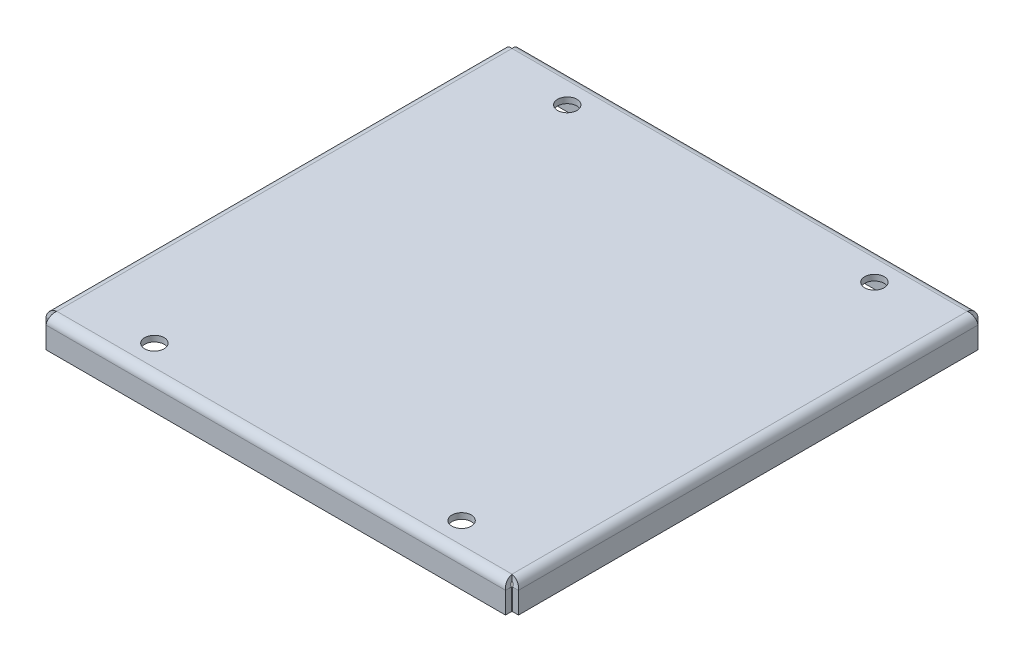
ISO-10303-21;
HEADER;
FILE_DESCRIPTION(('STEP AP214'),'2;1');
FILE_NAME('part.step','',(''),(''),'','','');
FILE_SCHEMA(('AUTOMOTIVE_DESIGN { 1 0 10303 214 1 1 1 1 }'));
ENDSEC;
DATA;
#1=APPLICATION_CONTEXT('core data for automotive mechanical design processes');
#2=APPLICATION_PROTOCOL_DEFINITION('international standard','automotive_design',2000,#1);
#3=PRODUCT_CONTEXT('',#1,'mechanical');
#4=PRODUCT('Part','Part','',(#3));
#5=PRODUCT_RELATED_PRODUCT_CATEGORY('part','',(#4));
#6=PRODUCT_DEFINITION_FORMATION('','',#4);
#7=PRODUCT_DEFINITION_CONTEXT('part definition',#1,'design');
#8=PRODUCT_DEFINITION('design','',#6,#7);
#9=PRODUCT_DEFINITION_SHAPE('','',#8);
#10=(LENGTH_UNIT() NAMED_UNIT(*) SI_UNIT(.MILLI.,.METRE.));
#11=(NAMED_UNIT(*) PLANE_ANGLE_UNIT() SI_UNIT($,.RADIAN.));
#12=(NAMED_UNIT(*) SI_UNIT($,.STERADIAN.) SOLID_ANGLE_UNIT());
#13=UNCERTAINTY_MEASURE_WITH_UNIT(LENGTH_MEASURE(1.E-05),#10,'distance_accuracy_value','');
#14=(GEOMETRIC_REPRESENTATION_CONTEXT(3) GLOBAL_UNCERTAINTY_ASSIGNED_CONTEXT((#13)) GLOBAL_UNIT_ASSIGNED_CONTEXT((#10,
#11,#12)) REPRESENTATION_CONTEXT('',''));
#15=CARTESIAN_POINT('',(0.,0.,0.));
#16=DIRECTION('',(0.,0.,1.));
#17=DIRECTION('',(1.,0.,0.));
#18=AXIS2_PLACEMENT_3D('',#15,#16,#17);
#19=CARTESIAN_POINT('',(0.,1.524,0.));
#20=DIRECTION('',(0.,-1.,0.));
#21=DIRECTION('',(0.,0.,-1.));
#22=AXIS2_PLACEMENT_3D('',#19,#20,#21);
#23=PLANE('',#22);
#24=CARTESIAN_POINT('',(40.8432,1.524,-54.0385));
#25=DIRECTION('',(0.,1.,0.));
#26=DIRECTION('',(0.,0.,1.));
#27=AXIS2_PLACEMENT_3D('',#24,#25,#26);
#28=CIRCLE('',#27,2.53999999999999);
#29=CARTESIAN_POINT('',(40.8432,1.524,-51.4985));
#30=VERTEX_POINT('',#29);
#31=EDGE_CURVE('E957',#30,#30,#28,.T.);
#32=ORIENTED_EDGE('',*,*,#31,.F.);
#33=EDGE_LOOP('',(#32));
#34=FACE_BOUND('',#33,.T.);
#35=CARTESIAN_POINT('',(40.8432,1.524,54.0385));
#36=DIRECTION('',(0.,1.,0.));
#37=DIRECTION('',(0.,0.,1.));
#38=AXIS2_PLACEMENT_3D('',#35,#36,#37);
#39=CIRCLE('',#38,2.53999999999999);
#40=CARTESIAN_POINT('',(40.8432,1.524,56.5785));
#41=VERTEX_POINT('',#40);
#42=EDGE_CURVE('E966',#41,#41,#39,.T.);
#43=ORIENTED_EDGE('',*,*,#42,.F.);
#44=EDGE_LOOP('',(#43));
#45=FACE_BOUND('',#44,.T.);
#46=CARTESIAN_POINT('',(-39.5732,1.524,54.0385));
#47=DIRECTION('',(0.,1.,0.));
#48=DIRECTION('',(0.,0.,1.));
#49=AXIS2_PLACEMENT_3D('',#46,#47,#48);
#50=CIRCLE('',#49,2.53999999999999);
#51=CARTESIAN_POINT('',(-39.5732,1.524,56.5785));
#52=VERTEX_POINT('',#51);
#53=EDGE_CURVE('E972',#52,#52,#50,.T.);
#54=ORIENTED_EDGE('',*,*,#53,.F.);
#55=EDGE_LOOP('',(#54));
#56=FACE_BOUND('',#55,.T.);
#57=DIRECTION('',(1.,0.,0.));
#58=VECTOR('',#57,1.);
#59=CARTESIAN_POINT('',(60.1453948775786,1.524,-59.5884));
#60=LINE('',#59,#58);
#61=CARTESIAN_POINT('',(59.5884,1.524,-59.5884));
#62=VERTEX_POINT('',#61);
#63=CARTESIAN_POINT('',(-59.5884,1.524,-59.5884));
#64=VERTEX_POINT('',#63);
#65=EDGE_CURVE('E311',#62,#64,#60,.F.);
#66=ORIENTED_EDGE('',*,*,#65,.T.);
#67=DIRECTION('',(0.,0.,-1.));
#68=VECTOR('',#67,1.);
#69=CARTESIAN_POINT('',(-59.5884,1.524,-60.1453948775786));
#70=LINE('',#69,#68);
#71=CARTESIAN_POINT('',(-59.5884,1.524,59.5884));
#72=VERTEX_POINT('',#71);
#73=EDGE_CURVE('E473',#64,#72,#70,.F.);
#74=ORIENTED_EDGE('',*,*,#73,.T.);
#75=DIRECTION('',(-1.,0.,0.));
#76=VECTOR('',#75,1.);
#77=CARTESIAN_POINT('',(-60.1453948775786,1.524,59.5884));
#78=LINE('',#77,#76);
#79=CARTESIAN_POINT('',(59.5884,1.524,59.5884));
#80=VERTEX_POINT('',#79);
#81=EDGE_CURVE('E554',#72,#80,#78,.F.);
#82=ORIENTED_EDGE('',*,*,#81,.T.);
#83=DIRECTION('',(0.,0.,1.));
#84=VECTOR('',#83,1.);
#85=CARTESIAN_POINT('',(59.5884,1.524,60.1453948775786));
#86=LINE('',#85,#84);
#87=EDGE_CURVE('E390',#80,#62,#86,.F.);
#88=ORIENTED_EDGE('',*,*,#87,.T.);
#89=EDGE_LOOP('',(#66,#74,#82,#88));
#90=FACE_BOUND('',#89,.T.);
#91=CARTESIAN_POINT('',(-39.5732,1.524,-54.0385));
#92=DIRECTION('',(0.,1.,0.));
#93=DIRECTION('',(0.,0.,1.));
#94=AXIS2_PLACEMENT_3D('',#91,#92,#93);
#95=CIRCLE('',#94,2.53999999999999);
#96=CARTESIAN_POINT('',(-39.5732,1.524,-51.4985));
#97=VERTEX_POINT('',#96);
#98=EDGE_CURVE('E953',#97,#97,#95,.T.);
#99=ORIENTED_EDGE('',*,*,#98,.F.);
#100=EDGE_LOOP('',(#99));
#101=FACE_BOUND('',#100,.T.);
#102=ADVANCED_FACE('F128',(#34,#45,#56,#90,#101),#23,.F.);
#103=CARTESIAN_POINT('',(0.,0.,0.));
#104=DIRECTION('',(0.,-1.,0.));
#105=DIRECTION('',(0.,0.,-1.));
#106=AXIS2_PLACEMENT_3D('',#103,#104,#105);
#107=PLANE('',#106);
#108=CARTESIAN_POINT('',(-39.5732,0.,-54.0385));
#109=DIRECTION('',(0.,-1.,0.));
#110=DIRECTION('',(0.,0.,-1.));
#111=AXIS2_PLACEMENT_3D('',#108,#109,#110);
#112=CIRCLE('',#111,2.53999999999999);
#113=CARTESIAN_POINT('',(-39.5732,0.,-56.5785));
#114=VERTEX_POINT('',#113);
#115=EDGE_CURVE('E956',#114,#114,#112,.T.);
#116=ORIENTED_EDGE('',*,*,#115,.F.);
#117=EDGE_LOOP('',(#116));
#118=FACE_BOUND('',#117,.T.);
#119=CARTESIAN_POINT('',(40.8432,0.,-54.0385));
#120=DIRECTION('',(0.,-1.,0.));
#121=DIRECTION('',(0.,0.,-1.));
#122=AXIS2_PLACEMENT_3D('',#119,#120,#121);
#123=CIRCLE('',#122,2.53999999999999);
#124=CARTESIAN_POINT('',(40.8432,0.,-56.5785));
#125=VERTEX_POINT('',#124);
#126=EDGE_CURVE('E960',#125,#125,#123,.T.);
#127=ORIENTED_EDGE('',*,*,#126,.F.);
#128=EDGE_LOOP('',(#127));
#129=FACE_BOUND('',#128,.T.);
#130=CARTESIAN_POINT('',(40.8432,0.,54.0385));
#131=DIRECTION('',(0.,-1.,0.));
#132=DIRECTION('',(0.,0.,-1.));
#133=AXIS2_PLACEMENT_3D('',#130,#131,#132);
#134=CIRCLE('',#133,2.53999999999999);
#135=CARTESIAN_POINT('',(40.8432,0.,51.4985));
#136=VERTEX_POINT('',#135);
#137=EDGE_CURVE('E969',#136,#136,#134,.T.);
#138=ORIENTED_EDGE('',*,*,#137,.F.);
#139=EDGE_LOOP('',(#138));
#140=FACE_BOUND('',#139,.T.);
#141=CARTESIAN_POINT('',(-39.5732,0.,54.0385));
#142=DIRECTION('',(0.,-1.,0.));
#143=DIRECTION('',(0.,0.,-1.));
#144=AXIS2_PLACEMENT_3D('',#141,#142,#143);
#145=CIRCLE('',#144,2.53999999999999);
#146=CARTESIAN_POINT('',(-39.5732,0.,51.4985));
#147=VERTEX_POINT('',#146);
#148=EDGE_CURVE('E300',#147,#147,#145,.T.);
#149=ORIENTED_EDGE('',*,*,#148,.F.);
#150=EDGE_LOOP('',(#149));
#151=FACE_BOUND('',#150,.T.);
#152=DIRECTION('',(0.,0.,-1.));
#153=VECTOR('',#152,1.);
#154=CARTESIAN_POINT('',(-59.5884,0.,-60.1453948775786));
#155=LINE('',#154,#153);
#156=CARTESIAN_POINT('',(-59.5884,0.,-59.5884));
#157=VERTEX_POINT('',#156);
#158=CARTESIAN_POINT('',(-59.5883999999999,0.,59.5884));
#159=VERTEX_POINT('',#158);
#160=EDGE_CURVE('E464',#157,#159,#155,.F.);
#161=ORIENTED_EDGE('',*,*,#160,.F.);
#162=DIRECTION('',(1.,0.,0.));
#163=VECTOR('',#162,1.);
#164=CARTESIAN_POINT('',(60.1453948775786,0.,-59.5884));
#165=LINE('',#164,#163);
#166=CARTESIAN_POINT('',(59.5884,0.,-59.5884));
#167=VERTEX_POINT('',#166);
#168=EDGE_CURVE('E301',#167,#157,#165,.F.);
#169=ORIENTED_EDGE('',*,*,#168,.F.);
#170=DIRECTION('',(0.,0.,1.));
#171=VECTOR('',#170,1.);
#172=CARTESIAN_POINT('',(59.5884,0.,60.1453948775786));
#173=LINE('',#172,#171);
#174=CARTESIAN_POINT('',(59.5884,0.,59.5884));
#175=VERTEX_POINT('',#174);
#176=EDGE_CURVE('E148',#175,#167,#173,.F.);
#177=ORIENTED_EDGE('',*,*,#176,.F.);
#178=DIRECTION('',(-1.,0.,0.));
#179=VECTOR('',#178,1.);
#180=CARTESIAN_POINT('',(-60.1453948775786,0.,59.5884));
#181=LINE('',#180,#179);
#182=EDGE_CURVE('E143',#159,#175,#181,.F.);
#183=ORIENTED_EDGE('',*,*,#182,.F.);
#184=EDGE_LOOP('',(#161,#169,#177,#183));
#185=FACE_BOUND('',#184,.T.);
#186=ADVANCED_FACE('F130',(#118,#129,#140,#151,#185),#107,.T.);
#187=CARTESIAN_POINT('',(59.5884,1.53924,59.5884));
#188=CARTESIAN_POINT('',(59.6348244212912,1.53924,59.8863592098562));
#189=CARTESIAN_POINT('',(59.6812324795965,1.48000597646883,60.1840963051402));
#190=CARTESIAN_POINT('',(59.7740649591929,1.25199801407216,60.7345562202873));
#191=CARTESIAN_POINT('',(59.8204811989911,1.08331378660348,60.9870100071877));
#192=CARTESIAN_POINT('',(59.9133136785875,0.662010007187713,61.4083137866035));
#193=CARTESIAN_POINT('',(59.9597299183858,0.409556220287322,61.5769980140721));
#194=CARTESIAN_POINT('',(60.0525623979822,-0.140903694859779,61.8050059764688));
#195=CARTESIAN_POINT('',(60.0989704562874,-0.438640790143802,61.86424));
#196=CARTESIAN_POINT('',(60.1453948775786,-0.736599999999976,61.86424));
#197=CARTESIAN_POINT('',(59.5884,1.524,59.5884));
#198=CARTESIAN_POINT('',(59.634824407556,1.524,59.8843639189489));
#199=CARTESIAN_POINT('',(59.6812324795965,1.46516263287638,60.1801072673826));
#200=CARTESIAN_POINT('',(59.7740649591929,1.23868150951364,60.7268810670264));
#201=CARTESIAN_POINT('',(59.8204811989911,1.07112686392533,60.9776443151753));
#202=CARTESIAN_POINT('',(59.9133136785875,0.65264431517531,61.3961268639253));
#203=CARTESIAN_POINT('',(59.9597299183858,0.401881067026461,61.5636815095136));
#204=CARTESIAN_POINT('',(60.0525623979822,-0.144892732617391,61.7901626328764));
#205=CARTESIAN_POINT('',(60.0989704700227,-0.440636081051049,61.849));
#206=CARTESIAN_POINT('',(60.1453948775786,-0.736599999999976,61.849));
#207=CARTESIAN_POINT('',(59.5884,0.,59.5884));
#208=CARTESIAN_POINT('',(59.6348230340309,0.,59.6848348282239));
#209=CARTESIAN_POINT('',(59.6812324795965,-0.0191717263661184,59.781203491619));
#210=CARTESIAN_POINT('',(59.7740649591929,-0.0929689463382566,59.9593657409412));
#211=CARTESIAN_POINT('',(59.8204811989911,-0.147565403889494,60.0410751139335));
#212=CARTESIAN_POINT('',(59.9133136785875,-0.283924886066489,60.1774345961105));
#213=CARTESIAN_POINT('',(59.9597299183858,-0.365634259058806,60.2320310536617));
#214=CARTESIAN_POINT('',(60.0525623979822,-0.543796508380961,60.3058282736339));
#215=CARTESIAN_POINT('',(60.0989718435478,-0.640165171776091,60.325));
#216=CARTESIAN_POINT('',(60.1453948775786,-0.736600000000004,60.325));
#217=CARTESIAN_POINT('',(59.5884,-0.0153924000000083,59.5884));
#218=CARTESIAN_POINT('',(59.6348230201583,-0.0153924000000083,59.6828195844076));
#219=CARTESIAN_POINT('',(59.6812324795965,-0.0341635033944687,59.7771745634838));
#220=CARTESIAN_POINT('',(59.7740649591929,-0.106418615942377,59.9516138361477));
#221=CARTESIAN_POINT('',(59.8204811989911,-0.159874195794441,60.031615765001));
#222=CARTESIAN_POINT('',(59.9133136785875,-0.293384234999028,60.1651258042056));
#223=CARTESIAN_POINT('',(59.9597299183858,-0.373386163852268,60.2185813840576));
#224=CARTESIAN_POINT('',(60.0525623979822,-0.547825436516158,60.2908364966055));
#225=CARTESIAN_POINT('',(60.0989718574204,-0.642180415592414,60.3096076));
#226=CARTESIAN_POINT('',(60.1453948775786,-0.736600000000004,60.3096076));
#227=B_SPLINE_SURFACE_WITH_KNOTS('',1,3,((#187,#188,#189,#190,#191,#192,#193,#194,#195,#196),
(#197,#198,#199,#200,#201,#202,#203,#204,#205,#206),(#207,#208,#209,#210,#211,#212,#213,#214,
#215,#216),(#217,#218,#219,#220,#221,#222,#223,#224,#225,#226)),.UNSPECIFIED.,.F.,.F.,.F.,(2,1,
1,2),(4,2,2,2,4),(-0.01,0.,1.,1.0101),(0.,0.25,0.5,0.75,1.),.UNSPECIFIED.);
#228=DIRECTION('',(0.,0.,-1.));
#229=VECTOR('',#228,1.);
#230=CARTESIAN_POINT('',(60.1453948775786,-0.736600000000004,60.325));
#231=LINE('',#230,#229);
#232=CARTESIAN_POINT('',(60.1453948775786,-0.736599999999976,61.849));
#233=VERTEX_POINT('',#232);
#234=CARTESIAN_POINT('',(60.1453948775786,-0.736600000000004,60.325));
#235=VERTEX_POINT('',#234);
#236=EDGE_CURVE('E518',#233,#235,#231,.T.);
#237=CARTESIAN_POINT('',(59.5884,0.,59.5884));
#238=CARTESIAN_POINT('',(59.5942020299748,2.55665584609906E-07,59.600452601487));
#239=CARTESIAN_POINT('',(59.6000040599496,-0.000295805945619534,59.6125051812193));
#240=CARTESIAN_POINT('',(59.6116081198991,-0.00147872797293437,59.6365813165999));
#241=CARTESIAN_POINT('',(59.6174101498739,-0.0023655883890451,59.6486048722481));
#242=CARTESIAN_POINT('',(59.6290142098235,-0.00472827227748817,59.6725939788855));
#243=CARTESIAN_POINT('',(59.6348162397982,-0.00620409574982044,59.6845595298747));
#244=CARTESIAN_POINT('',(59.6464202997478,-0.00974106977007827,59.708403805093));
#245=CARTESIAN_POINT('',(59.6522223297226,-0.0118022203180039,59.7202825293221));
#246=CARTESIAN_POINT('',(59.6638263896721,-0.01650490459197,59.7439245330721));
#247=CARTESIAN_POINT('',(59.6696284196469,-0.0191464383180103,59.7556878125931));
#248=CARTESIAN_POINT('',(59.6812324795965,-0.0250035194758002,59.7790705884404));
#249=CARTESIAN_POINT('',(59.6870345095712,-0.0282190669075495,59.7906900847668));
#250=CARTESIAN_POINT('',(59.6986385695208,-0.0352164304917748,59.8137573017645));
#251=CARTESIAN_POINT('',(59.7044405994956,-0.0389982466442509,59.8252050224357));
#252=CARTESIAN_POINT('',(59.7160446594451,-0.0471190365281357,59.8479011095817));
#253=CARTESIAN_POINT('',(59.7218466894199,-0.0514580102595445,59.8591494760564));
#254=CARTESIAN_POINT('',(59.7334507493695,-0.0606826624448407,59.8814197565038));
#255=CARTESIAN_POINT('',(59.7392527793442,-0.065568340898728,59.8924416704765));
#256=CARTESIAN_POINT('',(59.7508568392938,-0.0758746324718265,59.914232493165));
#257=CARTESIAN_POINT('',(59.7566588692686,-0.0812952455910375,59.9250014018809));
#258=CARTESIAN_POINT('',(59.7682629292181,-0.0926583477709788,59.9462602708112));
#259=CARTESIAN_POINT('',(59.7740649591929,-0.0986008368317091,59.9567502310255));
#260=CARTESIAN_POINT('',(59.7856690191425,-0.110993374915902,59.9774259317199));
#261=CARTESIAN_POINT('',(59.7914710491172,-0.117443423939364,59.9876116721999));
#262=CARTESIAN_POINT('',(59.8030751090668,-0.130835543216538,60.0076543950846));
#263=CARTESIAN_POINT('',(59.8088771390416,-0.137777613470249,60.0175113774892));
#264=CARTESIAN_POINT('',(59.8204811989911,-0.152137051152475,60.0368728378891));
#265=CARTESIAN_POINT('',(59.8262832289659,-0.159554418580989,60.0463773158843));
#266=CARTESIAN_POINT('',(59.8378872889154,-0.174846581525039,60.0650108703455));
#267=CARTESIAN_POINT('',(59.8436893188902,-0.182721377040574,60.0741399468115));
#268=CARTESIAN_POINT('',(59.8552933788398,-0.198909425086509,60.0920007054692));
#269=CARTESIAN_POINT('',(59.8610954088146,-0.20722267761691,60.1007323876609));
#270=CARTESIAN_POINT('',(59.8726994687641,-0.224267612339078,60.1177773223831));
#271=CARTESIAN_POINT('',(59.8785014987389,-0.232999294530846,60.1260905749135));
#272=CARTESIAN_POINT('',(59.8901055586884,-0.250860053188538,60.1422786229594));
#273=CARTESIAN_POINT('',(59.8959075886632,-0.259989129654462,60.150153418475));
#274=CARTESIAN_POINT('',(59.9075116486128,-0.278622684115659,60.165445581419));
#275=CARTESIAN_POINT('',(59.9133136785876,-0.288127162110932,60.1728629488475));
#276=CARTESIAN_POINT('',(59.9249177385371,-0.307488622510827,60.1872223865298));
#277=CARTESIAN_POINT('',(59.9307197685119,-0.317345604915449,60.1941644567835));
#278=CARTESIAN_POINT('',(59.9423238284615,-0.337388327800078,60.2075565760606));
#279=CARTESIAN_POINT('',(59.9481258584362,-0.347574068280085,60.2140066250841));
#280=CARTESIAN_POINT('',(59.9597299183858,-0.368249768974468,60.2263991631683));
#281=CARTESIAN_POINT('',(59.9655319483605,-0.378739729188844,60.232341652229));
#282=CARTESIAN_POINT('',(59.9771360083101,-0.399998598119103,60.243704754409));
#283=CARTESIAN_POINT('',(59.9829380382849,-0.410767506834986,60.2491253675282));
#284=CARTESIAN_POINT('',(59.9945420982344,-0.432558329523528,60.2594316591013));
#285=CARTESIAN_POINT('',(60.0003441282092,-0.443580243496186,60.2643173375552));
#286=CARTESIAN_POINT('',(60.0119481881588,-0.465850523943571,60.2735419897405));
#287=CARTESIAN_POINT('',(60.0177502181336,-0.477098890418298,60.2778809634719));
#288=CARTESIAN_POINT('',(60.0293542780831,-0.499794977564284,60.2860017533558));
#289=CARTESIAN_POINT('',(60.0351563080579,-0.511242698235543,60.2897835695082));
#290=CARTESIAN_POINT('',(60.0467603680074,-0.534309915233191,60.2967809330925));
#291=CARTESIAN_POINT('',(60.0525623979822,-0.54592941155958,60.2999964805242));
#292=CARTESIAN_POINT('',(60.0641664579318,-0.569312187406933,60.305853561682));
#293=CARTESIAN_POINT('',(60.0699684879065,-0.581075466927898,60.308495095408));
#294=CARTESIAN_POINT('',(60.0815725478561,-0.604717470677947,60.313197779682));
#295=CARTESIAN_POINT('',(60.0873745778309,-0.616596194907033,60.3152589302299));
#296=CARTESIAN_POINT('',(60.0989786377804,-0.640440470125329,60.3187959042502));
#297=CARTESIAN_POINT('',(60.1047806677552,-0.65240602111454,60.3202717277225));
#298=CARTESIAN_POINT('',(60.1163847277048,-0.676395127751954,60.322634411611));
#299=CARTESIAN_POINT('',(60.1221867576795,-0.688418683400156,60.3235212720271));
#300=CARTESIAN_POINT('',(60.1337908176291,-0.712494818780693,60.3247041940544));
#301=CARTESIAN_POINT('',(60.1395928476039,-0.724547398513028,60.3250002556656));
#302=CARTESIAN_POINT('',(60.1453948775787,-0.736600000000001,60.325));
#303=B_SPLINE_CURVE_WITH_KNOTS('',3,(#237,#238,#239,#240,#241,#242,#243,#244,#245,#246,#247,
#248,#249,#250,#251,#252,#253,#254,#255,#256,#257,#258,#259,#260,#261,#262,#263,#264,#265,#266,
#267,#268,#269,#270,#271,#272,#273,#274,#275,#276,#277,#278,#279,#280,#281,#282,#283,#284,#285,
#286,#287,#288,#289,#290,#291,#292,#293,#294,#295,#296,#297,#298,#299,#300,#301,#302),
.UNSPECIFIED.,.F.,.F.,(4,2,2,2,2,2,2,2,2,2,2,2,2,2,2,2,2,2,2,2,2,2,2,2,2,2,2,2,2,2,2,2,4),(0.,
0.0401259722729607,0.0802519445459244,0.120377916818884,0.160503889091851,0.200629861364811,
0.240755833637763,0.28088180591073,0.321007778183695,0.36113375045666,0.401259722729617,
0.441385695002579,0.481511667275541,0.521637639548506,0.561763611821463,0.601889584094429,
0.642015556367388,0.682141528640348,0.722267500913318,0.76239347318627,0.802519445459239,
0.842645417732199,0.88277139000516,0.922897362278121,0.963023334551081,1.00314930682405,
1.043275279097,1.08340125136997,1.12352722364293,1.1636531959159,1.20377916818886,
1.24390514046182,1.28403111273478),.UNSPECIFIED.);
#304=EDGE_CURVE('E548',#175,#235,#303,.T.);
#305=DIRECTION('',(0.,1.,0.));
#306=VECTOR('',#305,1.);
#307=CARTESIAN_POINT('',(59.5884,0.,59.5884));
#308=LINE('',#307,#306);
#309=EDGE_CURVE('E15',#175,#80,#308,.T.);
#310=CARTESIAN_POINT('',(59.5884,1.52399999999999,59.5884));
#311=CARTESIAN_POINT('',(59.5942020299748,1.52400078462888,59.6253890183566));
#312=CARTESIAN_POINT('',(59.6000040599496,1.52309218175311,59.6623779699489));
#313=CARTESIAN_POINT('',(59.6116081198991,1.5194618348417,59.7362667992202));
#314=CARTESIAN_POINT('',(59.6174101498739,1.51674009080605,59.7731666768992));
#315=CARTESIAN_POINT('',(59.6290142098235,1.50948909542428,59.8467884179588));
#316=CARTESIAN_POINT('',(59.6348162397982,1.50495984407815,59.8835102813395));
#317=CARTESIAN_POINT('',(59.6464202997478,1.4941049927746,59.9566875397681));
#318=CARTESIAN_POINT('',(59.6522223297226,1.48777939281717,59.993142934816));
#319=CARTESIAN_POINT('',(59.6638263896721,1.4733470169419,60.0656994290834));
#320=CARTESIAN_POINT('',(59.6696284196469,1.46524024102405,60.1018005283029));
#321=CARTESIAN_POINT('',(59.6812324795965,1.44726506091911,60.1735614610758));
#322=CARTESIAN_POINT('',(59.6870345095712,1.43739665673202,60.2092212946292));
#323=CARTESIAN_POINT('',(59.6986385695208,1.41592198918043,60.2800137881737));
#324=CARTESIAN_POINT('',(59.7044405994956,1.40431572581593,60.3151464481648));
#325=CARTESIAN_POINT('',(59.7160446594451,1.37939330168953,60.3847999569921));
#326=CARTESIAN_POINT('',(59.7218466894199,1.36607714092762,60.4193208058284));
#327=CARTESIAN_POINT('',(59.7334507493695,1.3377670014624,60.4876675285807));
#328=CARTESIAN_POINT('',(59.7392527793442,1.32277302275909,60.5214934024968));
#329=CARTESIAN_POINT('',(59.7508568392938,1.29114336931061,60.5883686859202));
#330=CARTESIAN_POINT('',(59.7566588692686,1.27450769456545,60.6214180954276));
#331=CARTESIAN_POINT('',(59.7682629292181,1.23963472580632,60.6866608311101));
#332=CARTESIAN_POINT('',(59.7740649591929,1.22139743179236,60.7188541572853));
#333=CARTESIAN_POINT('',(59.7856690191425,1.18336515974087,60.7823071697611));
#334=CARTESIAN_POINT('',(59.7914710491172,1.16357018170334,60.8135668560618));
#335=CARTESIAN_POINT('',(59.8030751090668,1.12247022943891,60.8750772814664));
#336=CARTESIAN_POINT('',(59.8088771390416,1.10116525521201,60.9053280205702));
#337=CARTESIAN_POINT('',(59.8204811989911,1.05709663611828,60.9647476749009));
#338=CARTESIAN_POINT('',(59.8262832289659,1.03433299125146,60.9939165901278));
#339=CARTESIAN_POINT('',(59.8378872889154,0.987401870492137,61.0511023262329));
#340=CARTESIAN_POINT('',(59.8436893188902,0.963234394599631,61.0791191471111));
#341=CARTESIAN_POINT('',(59.8552933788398,0.913553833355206,61.1339331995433));
#342=CARTESIAN_POINT('',(59.8610954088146,0.888040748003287,61.1607304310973));
#343=CARTESIAN_POINT('',(59.8726994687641,0.835730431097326,61.2130407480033));
#344=CARTESIAN_POINT('',(59.8785014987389,0.808933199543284,61.2385538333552));
#345=CARTESIAN_POINT('',(59.8901055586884,0.754119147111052,61.2882343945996));
#346=CARTESIAN_POINT('',(59.8959075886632,0.726102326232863,61.3124018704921));
#347=CARTESIAN_POINT('',(59.9075116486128,0.668916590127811,61.3593329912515));
#348=CARTESIAN_POINT('',(59.9133136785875,0.639747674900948,61.3820966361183));
#349=CARTESIAN_POINT('',(59.9249177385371,0.580328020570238,61.426165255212));
#350=CARTESIAN_POINT('',(59.9307197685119,0.55007728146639,61.4474702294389));
#351=CARTESIAN_POINT('',(59.9423238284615,0.488566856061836,61.4885701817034));
#352=CARTESIAN_POINT('',(59.9481258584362,0.457307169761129,61.5083651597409));
#353=CARTESIAN_POINT('',(59.9597299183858,0.393854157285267,61.5463974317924));
#354=CARTESIAN_POINT('',(59.9655319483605,0.361660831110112,61.5646347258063));
#355=CARTESIAN_POINT('',(59.9771360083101,0.29641809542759,61.5995076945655));
#356=CARTESIAN_POINT('',(59.9829380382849,0.263368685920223,61.6161433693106));
#357=CARTESIAN_POINT('',(59.9945420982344,0.196493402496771,61.6477730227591));
#358=CARTESIAN_POINT('',(60.0003441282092,0.162667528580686,61.6627670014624));
#359=CARTESIAN_POINT('',(60.0119481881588,0.0943208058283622,61.6910771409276));
#360=CARTESIAN_POINT('',(60.0177502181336,0.0597999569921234,61.7043933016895));
#361=CARTESIAN_POINT('',(60.0293542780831,-0.00985355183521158,61.7293157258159));
#362=CARTESIAN_POINT('',(60.0351563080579,-0.0449862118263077,61.7409219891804));
#363=CARTESIAN_POINT('',(60.0467603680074,-0.115778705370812,61.762396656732));
#364=CARTESIAN_POINT('',(60.0525623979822,-0.15143853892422,61.7722650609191));
#365=CARTESIAN_POINT('',(60.0641664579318,-0.223199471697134,61.7902402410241));
#366=CARTESIAN_POINT('',(60.0699684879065,-0.25930057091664,61.7983470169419));
#367=CARTESIAN_POINT('',(60.0815725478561,-0.331857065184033,61.8127793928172));
#368=CARTESIAN_POINT('',(60.0873745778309,-0.36831246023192,61.8191049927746));
#369=CARTESIAN_POINT('',(60.0989786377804,-0.441489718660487,61.8299598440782));
#370=CARTESIAN_POINT('',(60.1047806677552,-0.478211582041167,61.8344890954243));
#371=CARTESIAN_POINT('',(60.1163847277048,-0.551833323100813,61.8417400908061));
#372=CARTESIAN_POINT('',(60.1221867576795,-0.58873320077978,61.8444618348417));
#373=CARTESIAN_POINT('',(60.1337908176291,-0.662622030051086,61.8480921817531));
#374=CARTESIAN_POINT('',(60.1395928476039,-0.699610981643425,61.8490007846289));
#375=CARTESIAN_POINT('',(60.1453948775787,-0.736599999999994,61.849));
#376=B_SPLINE_CURVE_WITH_KNOTS('',3,(#310,#311,#312,#313,#314,#315,#316,#317,#318,#319,#320,
#321,#322,#323,#324,#325,#326,#327,#328,#329,#330,#331,#332,#333,#334,#335,#336,#337,#338,#339,
#340,#341,#342,#343,#344,#345,#346,#347,#348,#349,#350,#351,#352,#353,#354,#355,#356,#357,#358,
#359,#360,#361,#362,#363,#364,#365,#366,#367,#368,#369,#370,#371,#372,#373,#374,#375),
.UNSPECIFIED.,.F.,.F.,(4,2,2,2,2,2,2,2,2,2,2,2,2,2,2,2,2,2,2,2,2,2,2,2,2,2,2,2,2,2,2,2,4),(0.,
0.112312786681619,0.224625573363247,0.336938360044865,0.449251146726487,0.561563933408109,
0.673876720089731,0.786189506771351,0.898502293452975,1.0108150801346,1.12312786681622,
1.23544065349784,1.34775344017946,1.46006622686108,1.5723790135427,1.68469180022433,
1.79700458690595,1.90931737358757,2.02163016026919,2.13394294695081,2.24625573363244,
2.35856852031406,2.47088130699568,2.5831940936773,2.69550688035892,2.80781966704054,
2.92013245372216,3.03244524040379,3.14475802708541,3.25707081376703,3.36938360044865,
3.48169638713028,3.5940091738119),.UNSPECIFIED.);
#377=EDGE_CURVE('E580',#80,#233,#376,.T.);
#378=ORIENTED_EDGE('',*,*,#236,.T.);
#379=ORIENTED_EDGE('',*,*,#304,.F.);
#380=ORIENTED_EDGE('',*,*,#309,.T.);
#381=ORIENTED_EDGE('',*,*,#377,.T.);
#382=EDGE_LOOP('',(#378,#379,#380,#381));
#383=FACE_BOUND('',#382,.T.);
#384=ADVANCED_FACE('F571',(#383),#227,.F.);
#385=CARTESIAN_POINT('',(-60.1453948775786,-0.736600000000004,61.86424));
#386=CARTESIAN_POINT('',(-60.0989704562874,-0.438640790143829,61.86424));
#387=CARTESIAN_POINT('',(-60.0525623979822,-0.140903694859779,61.8050059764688));
#388=CARTESIAN_POINT('',(-59.9597299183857,0.409556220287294,61.5769980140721));
#389=CARTESIAN_POINT('',(-59.9133136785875,0.662010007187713,61.4083137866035));
#390=CARTESIAN_POINT('',(-59.8204811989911,1.08331378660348,60.9870100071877));
#391=CARTESIAN_POINT('',(-59.7740649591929,1.25199801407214,60.7345562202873));
#392=CARTESIAN_POINT('',(-59.6812324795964,1.4800059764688,60.1840963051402));
#393=CARTESIAN_POINT('',(-59.6348244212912,1.53924,59.8863592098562));
#394=CARTESIAN_POINT('',(-59.5884,1.53924,59.5884));
#395=CARTESIAN_POINT('',(-60.1453948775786,-0.736600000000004,61.849));
#396=CARTESIAN_POINT('',(-60.0989704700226,-0.440636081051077,61.849));
#397=CARTESIAN_POINT('',(-60.0525623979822,-0.144892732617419,61.7901626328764));
#398=CARTESIAN_POINT('',(-59.9597299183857,0.401881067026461,61.5636815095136));
#399=CARTESIAN_POINT('',(-59.9133136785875,0.652644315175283,61.3961268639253));
#400=CARTESIAN_POINT('',(-59.8204811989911,1.07112686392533,60.9776443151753));
#401=CARTESIAN_POINT('',(-59.7740649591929,1.23868150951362,60.7268810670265));
#402=CARTESIAN_POINT('',(-59.6812324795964,1.46516263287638,60.1801072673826));
#403=CARTESIAN_POINT('',(-59.634824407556,1.524,59.8843639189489));
#404=CARTESIAN_POINT('',(-59.5884,1.524,59.5884));
#405=CARTESIAN_POINT('',(-60.1453948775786,-0.736600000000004,60.325));
#406=CARTESIAN_POINT('',(-60.0989718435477,-0.640165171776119,60.325));
#407=CARTESIAN_POINT('',(-60.0525623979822,-0.543796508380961,60.3058282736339));
#408=CARTESIAN_POINT('',(-59.9597299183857,-0.365634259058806,60.2320310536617));
#409=CARTESIAN_POINT('',(-59.9133136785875,-0.283924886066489,60.1774345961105));
#410=CARTESIAN_POINT('',(-59.8204811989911,-0.147565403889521,60.0410751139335));
#411=CARTESIAN_POINT('',(-59.7740649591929,-0.0929689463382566,59.9593657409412));
#412=CARTESIAN_POINT('',(-59.6812324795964,-0.0191717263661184,59.781203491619));
#413=CARTESIAN_POINT('',(-59.6348230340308,0.,59.6848348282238));
#414=CARTESIAN_POINT('',(-59.5884,0.,59.5884));
#415=CARTESIAN_POINT('',(-60.1453948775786,-0.736600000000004,60.3096076));
#416=CARTESIAN_POINT('',(-60.0989718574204,-0.642180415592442,60.3096076));
#417=CARTESIAN_POINT('',(-60.0525623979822,-0.547825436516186,60.2908364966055));
#418=CARTESIAN_POINT('',(-59.9597299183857,-0.373386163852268,60.2185813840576));
#419=CARTESIAN_POINT('',(-59.9133136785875,-0.293384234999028,60.1651258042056));
#420=CARTESIAN_POINT('',(-59.8204811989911,-0.159874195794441,60.031615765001));
#421=CARTESIAN_POINT('',(-59.7740649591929,-0.106418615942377,59.9516138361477));
#422=CARTESIAN_POINT('',(-59.6812324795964,-0.0341635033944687,59.7771745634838));
#423=CARTESIAN_POINT('',(-59.6348230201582,-0.0153924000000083,59.6828195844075));
#424=CARTESIAN_POINT('',(-59.5884,-0.0153924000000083,59.5884));
#425=B_SPLINE_SURFACE_WITH_KNOTS('',1,3,((#385,#386,#387,#388,#389,#390,#391,#392,#393,#394),
(#395,#396,#397,#398,#399,#400,#401,#402,#403,#404),(#405,#406,#407,#408,#409,#410,#411,#412,
#413,#414),(#415,#416,#417,#418,#419,#420,#421,#422,#423,#424)),.UNSPECIFIED.,.F.,.F.,.F.,(2,1,
1,2),(4,2,2,2,4),(-0.01,0.,1.,1.0101),(0.,0.25,0.5,0.75,1.),.UNSPECIFIED.);
#426=CARTESIAN_POINT('',(-60.1453948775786,-0.736600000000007,60.325));
#427=CARTESIAN_POINT('',(-60.1395928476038,-0.724547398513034,60.3250002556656));
#428=CARTESIAN_POINT('',(-60.133790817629,-0.712494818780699,60.3247041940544));
#429=CARTESIAN_POINT('',(-60.1221867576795,-0.688418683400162,60.3235212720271));
#430=CARTESIAN_POINT('',(-60.1163847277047,-0.67639512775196,60.322634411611));
#431=CARTESIAN_POINT('',(-60.1047806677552,-0.652406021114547,60.3202717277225));
#432=CARTESIAN_POINT('',(-60.0989786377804,-0.640440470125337,60.3187959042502));
#433=CARTESIAN_POINT('',(-60.0873745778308,-0.616596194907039,60.3152589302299));
#434=CARTESIAN_POINT('',(-60.0815725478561,-0.604717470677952,60.313197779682));
#435=CARTESIAN_POINT('',(-60.0699684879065,-0.581075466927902,60.308495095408));
#436=CARTESIAN_POINT('',(-60.0641664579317,-0.569312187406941,60.305853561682));
#437=CARTESIAN_POINT('',(-60.0525623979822,-0.545929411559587,60.2999964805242));
#438=CARTESIAN_POINT('',(-60.0467603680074,-0.534309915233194,60.2967809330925));
#439=CARTESIAN_POINT('',(-60.0351563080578,-0.511242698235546,60.2897835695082));
#440=CARTESIAN_POINT('',(-60.0293542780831,-0.49979497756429,60.2860017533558));
#441=CARTESIAN_POINT('',(-60.0177502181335,-0.477098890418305,60.2778809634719));
#442=CARTESIAN_POINT('',(-60.0119481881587,-0.465850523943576,60.2735419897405));
#443=CARTESIAN_POINT('',(-60.0003441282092,-0.44358024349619,60.2643173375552));
#444=CARTESIAN_POINT('',(-59.9945420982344,-0.432558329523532,60.2594316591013));
#445=CARTESIAN_POINT('',(-59.9829380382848,-0.410767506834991,60.2491253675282));
#446=CARTESIAN_POINT('',(-59.9771360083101,-0.399998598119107,60.243704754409));
#447=CARTESIAN_POINT('',(-59.9655319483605,-0.378739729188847,60.232341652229));
#448=CARTESIAN_POINT('',(-59.9597299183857,-0.368249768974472,60.2263991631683));
#449=CARTESIAN_POINT('',(-59.9481258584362,-0.34757406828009,60.2140066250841));
#450=CARTESIAN_POINT('',(-59.9423238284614,-0.337388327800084,60.2075565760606));
#451=CARTESIAN_POINT('',(-59.9307197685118,-0.317345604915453,60.1941644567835));
#452=CARTESIAN_POINT('',(-59.9249177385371,-0.307488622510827,60.1872223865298));
#453=CARTESIAN_POINT('',(-59.9133136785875,-0.288127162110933,60.1728629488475));
#454=CARTESIAN_POINT('',(-59.9075116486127,-0.278622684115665,60.165445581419));
#455=CARTESIAN_POINT('',(-59.8959075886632,-0.259989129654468,60.150153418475));
#456=CARTESIAN_POINT('',(-59.8901055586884,-0.25086005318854,60.1422786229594));
#457=CARTESIAN_POINT('',(-59.8785014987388,-0.232999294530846,60.1260905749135));
#458=CARTESIAN_POINT('',(-59.8726994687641,-0.22426761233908,60.1177773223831));
#459=CARTESIAN_POINT('',(-59.8610954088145,-0.207222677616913,60.1007323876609));
#460=CARTESIAN_POINT('',(-59.8552933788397,-0.198909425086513,60.0920007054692));
#461=CARTESIAN_POINT('',(-59.8436893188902,-0.182721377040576,60.0741399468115));
#462=CARTESIAN_POINT('',(-59.8378872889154,-0.17484658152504,60.0650108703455));
#463=CARTESIAN_POINT('',(-59.8262832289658,-0.15955441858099,60.0463773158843));
#464=CARTESIAN_POINT('',(-59.8204811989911,-0.152137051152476,60.0368728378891));
#465=CARTESIAN_POINT('',(-59.8088771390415,-0.137777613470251,60.0175113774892));
#466=CARTESIAN_POINT('',(-59.8030751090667,-0.130835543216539,60.0076543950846));
#467=CARTESIAN_POINT('',(-59.7914710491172,-0.117443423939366,59.9876116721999));
#468=CARTESIAN_POINT('',(-59.7856690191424,-0.110993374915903,59.9774259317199));
#469=CARTESIAN_POINT('',(-59.7740649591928,-0.0986008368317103,59.9567502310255));
#470=CARTESIAN_POINT('',(-59.7682629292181,-0.0926583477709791,59.9462602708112));
#471=CARTESIAN_POINT('',(-59.7566588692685,-0.081295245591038,59.9250014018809));
#472=CARTESIAN_POINT('',(-59.7508568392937,-0.0758746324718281,59.914232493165));
#473=CARTESIAN_POINT('',(-59.7392527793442,-0.0655683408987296,59.8924416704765));
#474=CARTESIAN_POINT('',(-59.7334507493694,-0.060682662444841,59.8814197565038));
#475=CARTESIAN_POINT('',(-59.7218466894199,-0.0514580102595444,59.8591494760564));
#476=CARTESIAN_POINT('',(-59.7160446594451,-0.0471190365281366,59.8479011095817));
#477=CARTESIAN_POINT('',(-59.7044405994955,-0.0389982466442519,59.8252050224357));
#478=CARTESIAN_POINT('',(-59.6986385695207,-0.035216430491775,59.8137573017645));
#479=CARTESIAN_POINT('',(-59.6870345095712,-0.0282190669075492,59.7906900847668));
#480=CARTESIAN_POINT('',(-59.6812324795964,-0.0250035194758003,59.7790705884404));
#481=CARTESIAN_POINT('',(-59.6696284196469,-0.019146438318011,59.7556878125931));
#482=CARTESIAN_POINT('',(-59.6638263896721,-0.0165049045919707,59.7439245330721));
#483=CARTESIAN_POINT('',(-59.6522223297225,-0.0118022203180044,59.7202825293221));
#484=CARTESIAN_POINT('',(-59.6464202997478,-0.00974106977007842,59.708403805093));
#485=CARTESIAN_POINT('',(-59.6348162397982,-0.00620409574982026,59.6845595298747));
#486=CARTESIAN_POINT('',(-59.6290142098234,-0.00472827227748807,59.6725939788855));
#487=CARTESIAN_POINT('',(-59.6174101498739,-0.00236558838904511,59.6486048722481));
#488=CARTESIAN_POINT('',(-59.6116081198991,-0.00147872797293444,59.6365813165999));
#489=CARTESIAN_POINT('',(-59.6000040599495,-0.000295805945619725,59.6125051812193));
#490=CARTESIAN_POINT('',(-59.5942020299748,2.55665584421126E-07,59.600452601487));
#491=CARTESIAN_POINT('',(-59.5884,0.,59.5884));
#492=B_SPLINE_CURVE_WITH_KNOTS('',3,(#426,#427,#428,#429,#430,#431,#432,#433,#434,#435,#436,
#437,#438,#439,#440,#441,#442,#443,#444,#445,#446,#447,#448,#449,#450,#451,#452,#453,#454,#455,
#456,#457,#458,#459,#460,#461,#462,#463,#464,#465,#466,#467,#468,#469,#470,#471,#472,#473,#474,
#475,#476,#477,#478,#479,#480,#481,#482,#483,#484,#485,#486,#487,#488,#489,#490,#491),
.UNSPECIFIED.,.F.,.F.,(4,2,2,2,2,2,2,2,2,2,2,2,2,2,2,2,2,2,2,2,2,2,2,2,2,2,2,2,2,2,2,2,4),(0.,
0.040125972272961,0.0802519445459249,0.120377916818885,0.160503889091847,0.20062986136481,
0.240755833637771,0.280881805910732,0.321007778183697,0.361133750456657,0.401259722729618,
0.441385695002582,0.481511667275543,0.521637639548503,0.561763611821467,0.601889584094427,
0.642015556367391,0.682141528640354,0.722267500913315,0.762393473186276,0.80251944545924,
0.842645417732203,0.882771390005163,0.922897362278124,0.963023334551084,1.00314930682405,
1.04327527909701,1.08340125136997,1.12352722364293,1.16365319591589,1.20377916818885,
1.24390514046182,1.28403111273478),.UNSPECIFIED.);
#493=CARTESIAN_POINT('',(-60.1453948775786,-0.736600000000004,60.325));
#494=VERTEX_POINT('',#493);
#495=EDGE_CURVE('E520',#494,#159,#492,.T.);
#496=DIRECTION('',(0.,0.,1.));
#497=VECTOR('',#496,1.);
#498=CARTESIAN_POINT('',(-60.1453948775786,-0.736600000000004,60.325));
#499=LINE('',#498,#497);
#500=CARTESIAN_POINT('',(-60.1453948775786,-0.736600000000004,61.849));
#501=VERTEX_POINT('',#500);
#502=EDGE_CURVE('E521',#501,#494,#499,.F.);
#503=CARTESIAN_POINT('',(-60.1453948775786,-0.736600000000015,61.849));
#504=CARTESIAN_POINT('',(-60.1395928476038,-0.699610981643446,61.8490007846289));
#505=CARTESIAN_POINT('',(-60.133790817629,-0.662622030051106,61.8480921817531));
#506=CARTESIAN_POINT('',(-60.1221867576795,-0.5887332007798,61.8444618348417));
#507=CARTESIAN_POINT('',(-60.1163847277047,-0.551833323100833,61.8417400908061));
#508=CARTESIAN_POINT('',(-60.1047806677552,-0.478211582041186,61.8344890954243));
#509=CARTESIAN_POINT('',(-60.0989786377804,-0.441489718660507,61.8299598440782));
#510=CARTESIAN_POINT('',(-60.0873745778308,-0.368312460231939,61.8191049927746));
#511=CARTESIAN_POINT('',(-60.0815725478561,-0.33185706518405,61.8127793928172));
#512=CARTESIAN_POINT('',(-60.0699684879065,-0.259300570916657,61.7983470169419));
#513=CARTESIAN_POINT('',(-60.0641664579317,-0.223199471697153,61.7902402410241));
#514=CARTESIAN_POINT('',(-60.0525623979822,-0.151438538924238,61.7722650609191));
#515=CARTESIAN_POINT('',(-60.0467603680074,-0.115778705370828,61.762396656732));
#516=CARTESIAN_POINT('',(-60.0351563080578,-0.0449862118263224,61.7409219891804));
#517=CARTESIAN_POINT('',(-60.0293542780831,-0.00985355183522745,61.729315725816));
#518=CARTESIAN_POINT('',(-60.0177502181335,0.0597999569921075,61.7043933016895));
#519=CARTESIAN_POINT('',(-60.0119481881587,0.0943208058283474,61.6910771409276));
#520=CARTESIAN_POINT('',(-60.0003441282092,0.162667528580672,61.6627670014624));
#521=CARTESIAN_POINT('',(-59.9945420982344,0.196493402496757,61.6477730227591));
#522=CARTESIAN_POINT('',(-59.9829380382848,0.26336868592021,61.6161433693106));
#523=CARTESIAN_POINT('',(-59.9771360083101,0.296418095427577,61.5995076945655));
#524=CARTESIAN_POINT('',(-59.9655319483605,0.3616608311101,61.5646347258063));
#525=CARTESIAN_POINT('',(-59.9597299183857,0.393854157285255,61.5463974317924));
#526=CARTESIAN_POINT('',(-59.9481258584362,0.457307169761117,61.5083651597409));
#527=CARTESIAN_POINT('',(-59.9423238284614,0.488566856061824,61.4885701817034));
#528=CARTESIAN_POINT('',(-59.9307197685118,0.55007728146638,61.4474702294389));
#529=CARTESIAN_POINT('',(-59.9249177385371,0.580328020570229,61.426165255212));
#530=CARTESIAN_POINT('',(-59.9133136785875,0.639747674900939,61.3820966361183));
#531=CARTESIAN_POINT('',(-59.9075116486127,0.668916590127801,61.3593329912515));
#532=CARTESIAN_POINT('',(-59.8959075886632,0.726102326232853,61.3124018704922));
#533=CARTESIAN_POINT('',(-59.8901055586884,0.754119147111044,61.2882343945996));
#534=CARTESIAN_POINT('',(-59.8785014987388,0.808933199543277,61.2385538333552));
#535=CARTESIAN_POINT('',(-59.8726994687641,0.835730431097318,61.2130407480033));
#536=CARTESIAN_POINT('',(-59.8610954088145,0.888040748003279,61.1607304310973));
#537=CARTESIAN_POINT('',(-59.8552933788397,0.913553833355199,61.1339331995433));
#538=CARTESIAN_POINT('',(-59.8436893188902,0.963234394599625,61.0791191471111));
#539=CARTESIAN_POINT('',(-59.8378872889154,0.987401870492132,61.0511023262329));
#540=CARTESIAN_POINT('',(-59.8262832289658,1.03433299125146,60.9939165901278));
#541=CARTESIAN_POINT('',(-59.8204811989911,1.05709663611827,60.964747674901));
#542=CARTESIAN_POINT('',(-59.8088771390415,1.101165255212,60.9053280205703));
#543=CARTESIAN_POINT('',(-59.8030751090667,1.12247022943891,60.8750772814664));
#544=CARTESIAN_POINT('',(-59.7914710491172,1.16357018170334,60.8135668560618));
#545=CARTESIAN_POINT('',(-59.7856690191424,1.18336515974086,60.7823071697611));
#546=CARTESIAN_POINT('',(-59.7740649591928,1.22139743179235,60.7188541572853));
#547=CARTESIAN_POINT('',(-59.7682629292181,1.23963472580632,60.6866608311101));
#548=CARTESIAN_POINT('',(-59.7566588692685,1.27450769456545,60.6214180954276));
#549=CARTESIAN_POINT('',(-59.7508568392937,1.29114336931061,60.5883686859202));
#550=CARTESIAN_POINT('',(-59.7392527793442,1.32277302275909,60.5214934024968));
#551=CARTESIAN_POINT('',(-59.7334507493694,1.3377670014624,60.4876675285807));
#552=CARTESIAN_POINT('',(-59.7218466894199,1.36607714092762,60.4193208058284));
#553=CARTESIAN_POINT('',(-59.7160446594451,1.37939330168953,60.3847999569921));
#554=CARTESIAN_POINT('',(-59.7044405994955,1.40431572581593,60.3151464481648));
#555=CARTESIAN_POINT('',(-59.6986385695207,1.41592198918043,60.2800137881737));
#556=CARTESIAN_POINT('',(-59.6870345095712,1.43739665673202,60.2092212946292));
#557=CARTESIAN_POINT('',(-59.6812324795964,1.44726506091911,60.1735614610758));
#558=CARTESIAN_POINT('',(-59.6696284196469,1.46524024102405,60.1018005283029));
#559=CARTESIAN_POINT('',(-59.6638263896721,1.4733470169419,60.0656994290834));
#560=CARTESIAN_POINT('',(-59.6522223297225,1.48777939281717,59.993142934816));
#561=CARTESIAN_POINT('',(-59.6464202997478,1.4941049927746,59.9566875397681));
#562=CARTESIAN_POINT('',(-59.6348162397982,1.50495984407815,59.8835102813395));
#563=CARTESIAN_POINT('',(-59.6290142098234,1.50948909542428,59.8467884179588));
#564=CARTESIAN_POINT('',(-59.6174101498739,1.51674009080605,59.7731666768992));
#565=CARTESIAN_POINT('',(-59.6116081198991,1.5194618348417,59.7362667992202));
#566=CARTESIAN_POINT('',(-59.6000040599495,1.52309218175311,59.6623779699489));
#567=CARTESIAN_POINT('',(-59.5942020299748,1.52400078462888,59.6253890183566));
#568=CARTESIAN_POINT('',(-59.5884,1.52399999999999,59.5884));
#569=B_SPLINE_CURVE_WITH_KNOTS('',3,(#503,#504,#505,#506,#507,#508,#509,#510,#511,#512,#513,
#514,#515,#516,#517,#518,#519,#520,#521,#522,#523,#524,#525,#526,#527,#528,#529,#530,#531,#532,
#533,#534,#535,#536,#537,#538,#539,#540,#541,#542,#543,#544,#545,#546,#547,#548,#549,#550,#551,
#552,#553,#554,#555,#556,#557,#558,#559,#560,#561,#562,#563,#564,#565,#566,#567,#568),
.UNSPECIFIED.,.F.,.F.,(4,2,2,2,2,2,2,2,2,2,2,2,2,2,2,2,2,2,2,2,2,2,2,2,2,2,2,2,2,2,2,2,4),(0.,
0.112312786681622,0.224625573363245,0.336938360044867,0.449251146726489,0.561563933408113,
0.673876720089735,0.786189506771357,0.898502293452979,1.0108150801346,1.12312786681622,
1.23544065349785,1.34775344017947,1.46006622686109,1.57237901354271,1.68469180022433,
1.79700458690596,1.90931737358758,2.02163016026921,2.13394294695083,2.24625573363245,
2.35856852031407,2.47088130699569,2.58319409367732,2.69550688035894,2.80781966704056,
2.92013245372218,3.03244524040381,3.14475802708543,3.25707081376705,3.36938360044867,
3.4816963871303,3.59400917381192),.UNSPECIFIED.);
#570=EDGE_CURVE('E553',#501,#72,#569,.T.);
#571=DIRECTION('',(0.,1.,0.));
#572=VECTOR('',#571,1.);
#573=CARTESIAN_POINT('',(-59.5884,0.,59.5884));
#574=LINE('',#573,#572);
#575=EDGE_CURVE('E132',#159,#72,#574,.T.);
#576=ORIENTED_EDGE('',*,*,#495,.F.);
#577=ORIENTED_EDGE('',*,*,#502,.F.);
#578=ORIENTED_EDGE('',*,*,#570,.T.);
#579=ORIENTED_EDGE('',*,*,#575,.F.);
#580=EDGE_LOOP('',(#576,#577,#578,#579));
#581=FACE_BOUND('',#580,.T.);
#582=ADVANCED_FACE('F664',(#581),#425,.F.);
#583=CARTESIAN_POINT('',(-60.1453948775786,-0.736600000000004,59.5884));
#584=DIRECTION('',(-1.,0.,0.));
#585=DIRECTION('',(0.,0.,1.));
#586=AXIS2_PLACEMENT_3D('',#583,#584,#585);
#587=CYLINDRICAL_SURFACE('',#586,2.2606);
#588=ORIENTED_EDGE('',*,*,#81,.F.);
#589=ORIENTED_EDGE('',*,*,#570,.F.);
#590=DIRECTION('',(-1.,0.,0.));
#591=VECTOR('',#590,1.);
#592=CARTESIAN_POINT('',(61.849,-0.736600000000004,61.849));
#593=LINE('',#592,#591);
#594=EDGE_CURVE('E530',#501,#233,#593,.F.);
#595=ORIENTED_EDGE('',*,*,#594,.T.);
#596=ORIENTED_EDGE('',*,*,#377,.F.);
#597=EDGE_LOOP('',(#588,#589,#595,#596));
#598=FACE_BOUND('',#597,.T.);
#599=ADVANCED_FACE('F567',(#598),#587,.T.);
#600=CARTESIAN_POINT('',(-60.1453948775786,-0.736600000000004,59.5884));
#601=DIRECTION('',(-1.,0.,0.));
#602=DIRECTION('',(0.,0.,1.));
#603=AXIS2_PLACEMENT_3D('',#600,#601,#602);
#604=CYLINDRICAL_SURFACE('',#603,0.736599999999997);
#605=ORIENTED_EDGE('',*,*,#182,.T.);
#606=ORIENTED_EDGE('',*,*,#304,.T.);
#607=DIRECTION('',(-1.,0.,0.));
#608=VECTOR('',#607,1.);
#609=CARTESIAN_POINT('',(61.849,-0.736600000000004,60.325));
#610=LINE('',#609,#608);
#611=EDGE_CURVE('E532',#235,#494,#610,.T.);
#612=ORIENTED_EDGE('',*,*,#611,.T.);
#613=ORIENTED_EDGE('',*,*,#495,.T.);
#614=EDGE_LOOP('',(#605,#606,#612,#613));
#615=FACE_BOUND('',#614,.T.);
#616=ADVANCED_FACE('F556',(#615),#604,.F.);
#617=CARTESIAN_POINT('',(60.1453948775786,0.,60.325));
#618=DIRECTION('',(1.,0.,0.));
#619=DIRECTION('',(0.,1.,0.));
#620=AXIS2_PLACEMENT_3D('',#617,#618,#619);
#621=PLANE('',#620);
#622=DIRECTION('',(0.,1.,0.));
#623=VECTOR('',#622,1.);
#624=CARTESIAN_POINT('',(60.1453948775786,0.,61.849));
#625=LINE('',#624,#623);
#626=CARTESIAN_POINT('',(60.1453948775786,-6.34999999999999,61.849));
#627=VERTEX_POINT('',#626);
#628=EDGE_CURVE('E543',#233,#627,#625,.F.);
#629=ORIENTED_EDGE('',*,*,#628,.T.);
#630=DIRECTION('',(0.,0.,1.));
#631=VECTOR('',#630,1.);
#632=CARTESIAN_POINT('',(60.1453948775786,-6.34999999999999,60.325));
#633=LINE('',#632,#631);
#634=CARTESIAN_POINT('',(60.1453948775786,-6.34999999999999,60.325));
#635=VERTEX_POINT('',#634);
#636=EDGE_CURVE('E541',#627,#635,#633,.F.);
#637=ORIENTED_EDGE('',*,*,#636,.T.);
#638=DIRECTION('',(0.,-1.,0.));
#639=VECTOR('',#638,1.);
#640=CARTESIAN_POINT('',(60.1453948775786,1.94289029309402E-13,60.325));
#641=LINE('',#640,#639);
#642=EDGE_CURVE('E517',#235,#635,#641,.T.);
#643=ORIENTED_EDGE('',*,*,#642,.F.);
#644=ORIENTED_EDGE('',*,*,#236,.F.);
#645=EDGE_LOOP('',(#629,#637,#643,#644));
#646=FACE_BOUND('',#645,.T.);
#647=ADVANCED_FACE('F566',(#646),#621,.T.);
#648=CARTESIAN_POINT('',(0.,2.22044604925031E-13,61.849));
#649=DIRECTION('',(0.,0.,-1.));
#650=DIRECTION('',(0.,1.,0.));
#651=AXIS2_PLACEMENT_3D('',#648,#649,#650);
#652=PLANE('',#651);
#653=ORIENTED_EDGE('',*,*,#628,.F.);
#654=ORIENTED_EDGE('',*,*,#594,.F.);
#655=DIRECTION('',(0.,-1.,0.));
#656=VECTOR('',#655,1.);
#657=CARTESIAN_POINT('',(-60.1453948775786,1.94289029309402E-13,61.849));
#658=LINE('',#657,#656);
#659=CARTESIAN_POINT('',(-60.1453948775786,-6.34999999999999,61.849));
#660=VERTEX_POINT('',#659);
#661=EDGE_CURVE('E536',#501,#660,#658,.T.);
#662=ORIENTED_EDGE('',*,*,#661,.T.);
#663=DIRECTION('',(1.,0.,0.));
#664=VECTOR('',#663,1.);
#665=CARTESIAN_POINT('',(0.,-6.34999999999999,61.849));
#666=LINE('',#665,#664);
#667=EDGE_CURVE('E524',#660,#627,#666,.T.);
#668=ORIENTED_EDGE('',*,*,#667,.T.);
#669=EDGE_LOOP('',(#653,#654,#662,#668));
#670=FACE_BOUND('',#669,.T.);
#671=ADVANCED_FACE('F689',(#670),#652,.F.);
#672=CARTESIAN_POINT('',(0.,1.94289029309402E-13,60.325));
#673=DIRECTION('',(0.,0.,-1.));
#674=DIRECTION('',(0.,1.,0.));
#675=AXIS2_PLACEMENT_3D('',#672,#673,#674);
#676=PLANE('',#675);
#677=ORIENTED_EDGE('',*,*,#611,.F.);
#678=ORIENTED_EDGE('',*,*,#642,.T.);
#679=DIRECTION('',(-1.,0.,0.));
#680=VECTOR('',#679,1.);
#681=CARTESIAN_POINT('',(61.849,-6.34999999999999,60.325));
#682=LINE('',#681,#680);
#683=CARTESIAN_POINT('',(-60.1453948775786,-6.34999999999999,60.325));
#684=VERTEX_POINT('',#683);
#685=EDGE_CURVE('E527',#684,#635,#682,.F.);
#686=ORIENTED_EDGE('',*,*,#685,.F.);
#687=DIRECTION('',(0.,1.,0.));
#688=VECTOR('',#687,1.);
#689=CARTESIAN_POINT('',(-60.1453948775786,0.,60.325));
#690=LINE('',#689,#688);
#691=EDGE_CURVE('E538',#494,#684,#690,.F.);
#692=ORIENTED_EDGE('',*,*,#691,.F.);
#693=EDGE_LOOP('',(#677,#678,#686,#692));
#694=FACE_BOUND('',#693,.T.);
#695=ADVANCED_FACE('F681',(#694),#676,.T.);
#696=CARTESIAN_POINT('',(61.849,-6.34999999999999,61.849));
#697=DIRECTION('',(0.,1.,0.));
#698=DIRECTION('',(0.,0.,1.));
#699=AXIS2_PLACEMENT_3D('',#696,#697,#698);
#700=PLANE('',#699);
#701=ORIENTED_EDGE('',*,*,#636,.F.);
#702=ORIENTED_EDGE('',*,*,#667,.F.);
#703=DIRECTION('',(0.,0.,-1.));
#704=VECTOR('',#703,1.);
#705=CARTESIAN_POINT('',(-60.1453948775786,-6.34999999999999,61.849));
#706=LINE('',#705,#704);
#707=EDGE_CURVE('E534',#660,#684,#706,.T.);
#708=ORIENTED_EDGE('',*,*,#707,.T.);
#709=ORIENTED_EDGE('',*,*,#685,.T.);
#710=EDGE_LOOP('',(#701,#702,#708,#709));
#711=FACE_BOUND('',#710,.T.);
#712=ADVANCED_FACE('F692',(#711),#700,.F.);
#713=CARTESIAN_POINT('',(-60.1453948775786,0.,60.325));
#714=DIRECTION('',(1.,0.,0.));
#715=DIRECTION('',(0.,1.,0.));
#716=AXIS2_PLACEMENT_3D('',#713,#714,#715);
#717=PLANE('',#716);
#718=ORIENTED_EDGE('',*,*,#707,.F.);
#719=ORIENTED_EDGE('',*,*,#661,.F.);
#720=ORIENTED_EDGE('',*,*,#502,.T.);
#721=ORIENTED_EDGE('',*,*,#691,.T.);
#722=EDGE_LOOP('',(#718,#719,#720,#721));
#723=FACE_BOUND('',#722,.T.);
#724=ADVANCED_FACE('F685',(#723),#717,.F.);
#725=CARTESIAN_POINT('',(-59.5884,1.53924,59.5884));
#726=CARTESIAN_POINT('',(-59.8863592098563,1.53924,59.6348244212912));
#727=CARTESIAN_POINT('',(-60.1840963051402,1.48000597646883,59.6812324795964));
#728=CARTESIAN_POINT('',(-60.7345562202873,1.25199801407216,59.7740649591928));
#729=CARTESIAN_POINT('',(-60.9870100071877,1.08331378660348,59.8204811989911));
#730=CARTESIAN_POINT('',(-61.4083137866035,0.662010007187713,59.9133136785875));
#731=CARTESIAN_POINT('',(-61.5769980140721,0.409556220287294,59.9597299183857));
#732=CARTESIAN_POINT('',(-61.8050059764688,-0.140903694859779,60.0525623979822));
#733=CARTESIAN_POINT('',(-61.86424,-0.438640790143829,60.0989704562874));
#734=CARTESIAN_POINT('',(-61.86424,-0.736600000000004,60.1453948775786));
#735=CARTESIAN_POINT('',(-59.5884,1.524,59.5884));
#736=CARTESIAN_POINT('',(-59.884363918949,1.524,59.634824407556));
#737=CARTESIAN_POINT('',(-60.1801072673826,1.46516263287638,59.6812324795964));
#738=CARTESIAN_POINT('',(-60.7268810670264,1.23868150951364,59.7740649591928));
#739=CARTESIAN_POINT('',(-60.9776443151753,1.07112686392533,59.8204811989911));
#740=CARTESIAN_POINT('',(-61.3961268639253,0.652644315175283,59.9133136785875));
#741=CARTESIAN_POINT('',(-61.5636815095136,0.401881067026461,59.9597299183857));
#742=CARTESIAN_POINT('',(-61.7901626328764,-0.144892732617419,60.0525623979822));
#743=CARTESIAN_POINT('',(-61.849,-0.440636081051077,60.0989704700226));
#744=CARTESIAN_POINT('',(-61.849,-0.736600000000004,60.1453948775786));
#745=CARTESIAN_POINT('',(-59.5884,0.,59.5884));
#746=CARTESIAN_POINT('',(-59.6848348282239,0.,59.6348230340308));
#747=CARTESIAN_POINT('',(-59.781203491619,-0.0191717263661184,59.6812324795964));
#748=CARTESIAN_POINT('',(-59.9593657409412,-0.0929689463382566,59.7740649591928));
#749=CARTESIAN_POINT('',(-60.0410751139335,-0.147565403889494,59.8204811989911));
#750=CARTESIAN_POINT('',(-60.1774345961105,-0.283924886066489,59.9133136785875));
#751=CARTESIAN_POINT('',(-60.2320310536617,-0.365634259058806,59.9597299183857));
#752=CARTESIAN_POINT('',(-60.3058282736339,-0.543796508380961,60.0525623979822));
#753=CARTESIAN_POINT('',(-60.325,-0.640165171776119,60.0989718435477));
#754=CARTESIAN_POINT('',(-60.325,-0.736600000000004,60.1453948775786));
#755=CARTESIAN_POINT('',(-59.5884,-0.0153924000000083,59.5884));
#756=CARTESIAN_POINT('',(-59.6828195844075,-0.0153924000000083,59.6348230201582));
#757=CARTESIAN_POINT('',(-59.7771745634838,-0.0341635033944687,59.6812324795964));
#758=CARTESIAN_POINT('',(-59.9516138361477,-0.10641861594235,59.7740649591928));
#759=CARTESIAN_POINT('',(-60.031615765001,-0.159874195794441,59.8204811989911));
#760=CARTESIAN_POINT('',(-60.1651258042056,-0.293384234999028,59.9133136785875));
#761=CARTESIAN_POINT('',(-60.2185813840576,-0.373386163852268,59.9597299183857));
#762=CARTESIAN_POINT('',(-60.2908364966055,-0.547825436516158,60.0525623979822));
#763=CARTESIAN_POINT('',(-60.3096076,-0.642180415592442,60.0989718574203));
#764=CARTESIAN_POINT('',(-60.3096076,-0.736600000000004,60.1453948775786));
#765=B_SPLINE_SURFACE_WITH_KNOTS('',1,3,((#725,#726,#727,#728,#729,#730,#731,#732,#733,#734),
(#735,#736,#737,#738,#739,#740,#741,#742,#743,#744),(#745,#746,#747,#748,#749,#750,#751,#752,
#753,#754),(#755,#756,#757,#758,#759,#760,#761,#762,#763,#764)),.UNSPECIFIED.,.F.,.F.,.F.,(2,1,
1,2),(4,2,2,2,4),(-0.01,0.,1.,1.0101),(0.,0.25,0.5,0.75,1.),.UNSPECIFIED.);
#766=DIRECTION('',(1.,0.,0.));
#767=VECTOR('',#766,1.);
#768=CARTESIAN_POINT('',(-60.325,-0.736600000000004,60.1453948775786));
#769=LINE('',#768,#767);
#770=CARTESIAN_POINT('',(-61.849,-0.736600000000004,60.1453948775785));
#771=VERTEX_POINT('',#770);
#772=CARTESIAN_POINT('',(-60.325,-0.736600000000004,60.1453948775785));
#773=VERTEX_POINT('',#772);
#774=EDGE_CURVE('E435',#771,#773,#769,.T.);
#775=CARTESIAN_POINT('',(-59.5884,0.,59.5884));
#776=CARTESIAN_POINT('',(-59.600452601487,2.55665592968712E-07,59.5942020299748));
#777=CARTESIAN_POINT('',(-59.6125051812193,-0.000295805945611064,59.6000040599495));
#778=CARTESIAN_POINT('',(-59.6365813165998,-0.00147872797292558,59.6116081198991));
#779=CARTESIAN_POINT('',(-59.648604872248,-0.00236558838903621,59.6174101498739));
#780=CARTESIAN_POINT('',(-59.6725939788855,-0.00472827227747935,59.6290142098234));
#781=CARTESIAN_POINT('',(-59.6845595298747,-0.00620409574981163,59.6348162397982));
#782=CARTESIAN_POINT('',(-59.708403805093,-0.00974106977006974,59.6464202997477));
#783=CARTESIAN_POINT('',(-59.7202825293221,-0.0118022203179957,59.6522223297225));
#784=CARTESIAN_POINT('',(-59.7439245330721,-0.0165049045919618,59.6638263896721));
#785=CARTESIAN_POINT('',(-59.7556878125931,-0.0191464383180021,59.6696284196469));
#786=CARTESIAN_POINT('',(-59.7790705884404,-0.0250035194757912,59.6812324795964));
#787=CARTESIAN_POINT('',(-59.7906900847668,-0.0282190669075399,59.6870345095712));
#788=CARTESIAN_POINT('',(-59.8137573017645,-0.0352164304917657,59.6986385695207));
#789=CARTESIAN_POINT('',(-59.8252050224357,-0.0389982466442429,59.7044405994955));
#790=CARTESIAN_POINT('',(-59.8479011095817,-0.047119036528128,59.7160446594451));
#791=CARTESIAN_POINT('',(-59.8591494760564,-0.051458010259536,59.7218466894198));
#792=CARTESIAN_POINT('',(-59.8814197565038,-0.060682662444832,59.7334507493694));
#793=CARTESIAN_POINT('',(-59.8924416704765,-0.0655683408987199,59.7392527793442));
#794=CARTESIAN_POINT('',(-59.914232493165,-0.0758746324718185,59.7508568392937));
#795=CARTESIAN_POINT('',(-59.9250014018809,-0.0812952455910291,59.7566588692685));
#796=CARTESIAN_POINT('',(-59.9462602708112,-0.0926583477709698,59.7682629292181));
#797=CARTESIAN_POINT('',(-59.9567502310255,-0.0986008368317,59.7740649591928));
#798=CARTESIAN_POINT('',(-59.9774259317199,-0.110993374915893,59.7856690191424));
#799=CARTESIAN_POINT('',(-59.9876116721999,-0.117443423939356,59.7914710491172));
#800=CARTESIAN_POINT('',(-60.0076543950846,-0.130835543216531,59.8030751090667));
#801=CARTESIAN_POINT('',(-60.0175113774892,-0.137777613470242,59.8088771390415));
#802=CARTESIAN_POINT('',(-60.0368728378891,-0.152137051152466,59.8204811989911));
#803=CARTESIAN_POINT('',(-60.0463773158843,-0.15955441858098,59.8262832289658));
#804=CARTESIAN_POINT('',(-60.0650108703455,-0.17484658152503,59.8378872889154));
#805=CARTESIAN_POINT('',(-60.0741399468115,-0.182721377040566,59.8436893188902));
#806=CARTESIAN_POINT('',(-60.0920007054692,-0.198909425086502,59.8552933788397));
#807=CARTESIAN_POINT('',(-60.1007323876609,-0.207222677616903,59.8610954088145));
#808=CARTESIAN_POINT('',(-60.1177773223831,-0.22426761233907,59.8726994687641));
#809=CARTESIAN_POINT('',(-60.1260905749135,-0.232999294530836,59.8785014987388));
#810=CARTESIAN_POINT('',(-60.1422786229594,-0.250860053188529,59.8901055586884));
#811=CARTESIAN_POINT('',(-60.150153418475,-0.259989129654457,59.8959075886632));
#812=CARTESIAN_POINT('',(-60.165445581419,-0.278622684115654,59.9075116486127));
#813=CARTESIAN_POINT('',(-60.1728629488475,-0.288127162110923,59.9133136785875));
#814=CARTESIAN_POINT('',(-60.1872223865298,-0.307488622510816,59.9249177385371));
#815=CARTESIAN_POINT('',(-60.1941644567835,-0.31734560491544,59.9307197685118));
#816=CARTESIAN_POINT('',(-60.2075565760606,-0.337388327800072,59.9423238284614));
#817=CARTESIAN_POINT('',(-60.2140066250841,-0.34757406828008,59.9481258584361));
#818=CARTESIAN_POINT('',(-60.2263991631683,-0.368249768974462,59.9597299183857));
#819=CARTESIAN_POINT('',(-60.232341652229,-0.378739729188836,59.9655319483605));
#820=CARTESIAN_POINT('',(-60.243704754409,-0.399998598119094,59.97713600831));
#821=CARTESIAN_POINT('',(-60.2491253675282,-0.410767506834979,59.9829380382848));
#822=CARTESIAN_POINT('',(-60.2594316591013,-0.432558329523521,59.9945420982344));
#823=CARTESIAN_POINT('',(-60.2643173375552,-0.443580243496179,60.0003441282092));
#824=CARTESIAN_POINT('',(-60.2735419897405,-0.465850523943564,60.0119481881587));
#825=CARTESIAN_POINT('',(-60.2778809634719,-0.477098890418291,60.0177502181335));
#826=CARTESIAN_POINT('',(-60.2860017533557,-0.499794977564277,60.029354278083));
#827=CARTESIAN_POINT('',(-60.2897835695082,-0.511242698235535,60.0351563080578));
#828=CARTESIAN_POINT('',(-60.2967809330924,-0.534309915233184,60.0467603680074));
#829=CARTESIAN_POINT('',(-60.2999964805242,-0.545929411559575,60.0525623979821));
#830=CARTESIAN_POINT('',(-60.305853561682,-0.569312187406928,60.0641664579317));
#831=CARTESIAN_POINT('',(-60.308495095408,-0.58107546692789,60.0699684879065));
#832=CARTESIAN_POINT('',(-60.313197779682,-0.604717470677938,60.081572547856));
#833=CARTESIAN_POINT('',(-60.3152589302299,-0.616596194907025,60.0873745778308));
#834=CARTESIAN_POINT('',(-60.3187959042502,-0.640440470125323,60.0989786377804));
#835=CARTESIAN_POINT('',(-60.3202717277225,-0.652406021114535,60.1047806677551));
#836=CARTESIAN_POINT('',(-60.322634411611,-0.676395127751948,60.1163847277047));
#837=CARTESIAN_POINT('',(-60.3235212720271,-0.68841868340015,60.1221867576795));
#838=CARTESIAN_POINT('',(-60.3247041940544,-0.712494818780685,60.133790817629));
#839=CARTESIAN_POINT('',(-60.3250002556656,-0.724547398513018,60.1395928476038));
#840=CARTESIAN_POINT('',(-60.325,-0.736599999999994,60.1453948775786));
#841=B_SPLINE_CURVE_WITH_KNOTS('',3,(#775,#776,#777,#778,#779,#780,#781,#782,#783,#784,#785,
#786,#787,#788,#789,#790,#791,#792,#793,#794,#795,#796,#797,#798,#799,#800,#801,#802,#803,#804,
#805,#806,#807,#808,#809,#810,#811,#812,#813,#814,#815,#816,#817,#818,#819,#820,#821,#822,#823,
#824,#825,#826,#827,#828,#829,#830,#831,#832,#833,#834,#835,#836,#837,#838,#839,#840),
.UNSPECIFIED.,.F.,.F.,(4,2,2,2,2,2,2,2,2,2,2,2,2,2,2,2,2,2,2,2,2,2,2,2,2,2,2,2,2,2,2,2,4),(0.,
0.0401259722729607,0.0802519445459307,0.120377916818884,0.160503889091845,0.200629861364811,
0.240755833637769,0.280881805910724,0.321007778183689,0.361133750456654,0.401259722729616,
0.441385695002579,0.481511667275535,0.5216376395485,0.561763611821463,0.601889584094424,
0.642015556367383,0.682141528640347,0.722267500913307,0.762393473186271,0.802519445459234,
0.842645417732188,0.882771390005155,0.922897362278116,0.963023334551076,1.00314930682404,
1.043275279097,1.08340125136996,1.12352722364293,1.16365319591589,1.20377916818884,
1.24390514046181,1.28403111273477),.UNSPECIFIED.);
#842=EDGE_CURVE('E467',#159,#773,#841,.T.);
#843=CARTESIAN_POINT('',(-59.5884,1.524,59.5884));
#844=CARTESIAN_POINT('',(-59.6253890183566,1.52400078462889,59.5942020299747));
#845=CARTESIAN_POINT('',(-59.6623779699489,1.52309218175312,59.6000040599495));
#846=CARTESIAN_POINT('',(-59.7362667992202,1.51946183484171,59.6116081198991));
#847=CARTESIAN_POINT('',(-59.7731666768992,1.51674009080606,59.6174101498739));
#848=CARTESIAN_POINT('',(-59.8467884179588,1.50948909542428,59.6290142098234));
#849=CARTESIAN_POINT('',(-59.8835102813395,1.50495984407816,59.6348162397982));
#850=CARTESIAN_POINT('',(-59.9566875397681,1.49410499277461,59.6464202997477));
#851=CARTESIAN_POINT('',(-59.993142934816,1.48777939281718,59.6522223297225));
#852=CARTESIAN_POINT('',(-60.0656994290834,1.47334701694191,59.6638263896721));
#853=CARTESIAN_POINT('',(-60.1018005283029,1.46524024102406,59.6696284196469));
#854=CARTESIAN_POINT('',(-60.1735614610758,1.44726506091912,59.6812324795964));
#855=CARTESIAN_POINT('',(-60.2092212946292,1.43739665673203,59.6870345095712));
#856=CARTESIAN_POINT('',(-60.2800137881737,1.41592198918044,59.6986385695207));
#857=CARTESIAN_POINT('',(-60.3151464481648,1.40431572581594,59.7044405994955));
#858=CARTESIAN_POINT('',(-60.3847999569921,1.37939330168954,59.7160446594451));
#859=CARTESIAN_POINT('',(-60.4193208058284,1.36607714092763,59.7218466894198));
#860=CARTESIAN_POINT('',(-60.4876675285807,1.33776700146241,59.7334507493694));
#861=CARTESIAN_POINT('',(-60.5214934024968,1.3227730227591,59.7392527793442));
#862=CARTESIAN_POINT('',(-60.5883686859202,1.29114336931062,59.7508568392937));
#863=CARTESIAN_POINT('',(-60.6214180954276,1.27450769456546,59.7566588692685));
#864=CARTESIAN_POINT('',(-60.6866608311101,1.23963472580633,59.7682629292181));
#865=CARTESIAN_POINT('',(-60.7188541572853,1.22139743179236,59.7740649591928));
#866=CARTESIAN_POINT('',(-60.7823071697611,1.18336515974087,59.7856690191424));
#867=CARTESIAN_POINT('',(-60.8135668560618,1.16357018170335,59.7914710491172));
#868=CARTESIAN_POINT('',(-60.8750772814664,1.12247022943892,59.8030751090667));
#869=CARTESIAN_POINT('',(-60.9053280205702,1.10116525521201,59.8088771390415));
#870=CARTESIAN_POINT('',(-60.9647476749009,1.05709663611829,59.8204811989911));
#871=CARTESIAN_POINT('',(-60.9939165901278,1.03433299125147,59.8262832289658));
#872=CARTESIAN_POINT('',(-61.0511023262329,0.987401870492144,59.8378872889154));
#873=CARTESIAN_POINT('',(-61.0791191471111,0.963234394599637,59.8436893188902));
#874=CARTESIAN_POINT('',(-61.1339331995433,0.913553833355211,59.8552933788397));
#875=CARTESIAN_POINT('',(-61.1607304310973,0.888040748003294,59.8610954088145));
#876=CARTESIAN_POINT('',(-61.2130407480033,0.835730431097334,59.8726994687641));
#877=CARTESIAN_POINT('',(-61.2385538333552,0.808933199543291,59.8785014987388));
#878=CARTESIAN_POINT('',(-61.2882343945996,0.754119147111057,59.8901055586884));
#879=CARTESIAN_POINT('',(-61.3124018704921,0.726102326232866,59.8959075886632));
#880=CARTESIAN_POINT('',(-61.3593329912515,0.668916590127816,59.9075116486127));
#881=CARTESIAN_POINT('',(-61.3820966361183,0.639747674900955,59.9133136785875));
#882=CARTESIAN_POINT('',(-61.426165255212,0.580328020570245,59.9249177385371));
#883=CARTESIAN_POINT('',(-61.4474702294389,0.550077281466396,59.9307197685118));
#884=CARTESIAN_POINT('',(-61.4885701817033,0.48856685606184,59.9423238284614));
#885=CARTESIAN_POINT('',(-61.5083651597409,0.457307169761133,59.9481258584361));
#886=CARTESIAN_POINT('',(-61.5463974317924,0.393854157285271,59.9597299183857));
#887=CARTESIAN_POINT('',(-61.5646347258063,0.361660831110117,59.9655319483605));
#888=CARTESIAN_POINT('',(-61.5995076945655,0.296418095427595,59.97713600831));
#889=CARTESIAN_POINT('',(-61.6161433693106,0.263368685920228,59.9829380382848));
#890=CARTESIAN_POINT('',(-61.6477730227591,0.196493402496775,59.9945420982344));
#891=CARTESIAN_POINT('',(-61.6627670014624,0.16266752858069,60.0003441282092));
#892=CARTESIAN_POINT('',(-61.6910771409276,0.094320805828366,60.0119481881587));
#893=CARTESIAN_POINT('',(-61.7043933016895,0.0597999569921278,60.0177502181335));
#894=CARTESIAN_POINT('',(-61.7293157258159,-0.00985355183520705,60.029354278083));
#895=CARTESIAN_POINT('',(-61.7409219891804,-0.0449862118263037,60.0351563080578));
#896=CARTESIAN_POINT('',(-61.762396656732,-0.115778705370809,60.0467603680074));
#897=CARTESIAN_POINT('',(-61.7722650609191,-0.151438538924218,60.0525623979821));
#898=CARTESIAN_POINT('',(-61.7902402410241,-0.223199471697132,60.0641664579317));
#899=CARTESIAN_POINT('',(-61.7983470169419,-0.259300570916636,60.0699684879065));
#900=CARTESIAN_POINT('',(-61.8127793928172,-0.331857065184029,60.081572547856));
#901=CARTESIAN_POINT('',(-61.8191049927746,-0.368312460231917,60.0873745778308));
#902=CARTESIAN_POINT('',(-61.8299598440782,-0.441489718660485,60.0989786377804));
#903=CARTESIAN_POINT('',(-61.8344890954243,-0.478211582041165,60.1047806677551));
#904=CARTESIAN_POINT('',(-61.8417400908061,-0.551833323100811,60.1163847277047));
#905=CARTESIAN_POINT('',(-61.8444618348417,-0.588733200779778,60.1221867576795));
#906=CARTESIAN_POINT('',(-61.8480921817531,-0.662622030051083,60.133790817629));
#907=CARTESIAN_POINT('',(-61.8490007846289,-0.699610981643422,60.1395928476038));
#908=CARTESIAN_POINT('',(-61.849,-0.736599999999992,60.1453948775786));
#909=B_SPLINE_CURVE_WITH_KNOTS('',3,(#843,#844,#845,#846,#847,#848,#849,#850,#851,#852,#853,
#854,#855,#856,#857,#858,#859,#860,#861,#862,#863,#864,#865,#866,#867,#868,#869,#870,#871,#872,
#873,#874,#875,#876,#877,#878,#879,#880,#881,#882,#883,#884,#885,#886,#887,#888,#889,#890,#891,
#892,#893,#894,#895,#896,#897,#898,#899,#900,#901,#902,#903,#904,#905,#906,#907,#908),
.UNSPECIFIED.,.F.,.F.,(4,2,2,2,2,2,2,2,2,2,2,2,2,2,2,2,2,2,2,2,2,2,2,2,2,2,2,2,2,2,2,2,4),(0.,
0.112312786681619,0.224625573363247,0.336938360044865,0.449251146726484,0.561563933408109,
0.673876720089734,0.786189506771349,0.898502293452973,1.01081508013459,1.12312786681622,
1.23544065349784,1.34775344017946,1.46006622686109,1.57237901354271,1.68469180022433,
1.79700458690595,1.90931737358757,2.02163016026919,2.13394294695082,2.24625573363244,
2.35856852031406,2.47088130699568,2.5831940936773,2.69550688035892,2.80781966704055,
2.92013245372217,3.03244524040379,3.14475802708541,3.25707081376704,3.36938360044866,
3.48169638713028,3.5940091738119),.UNSPECIFIED.);
#910=EDGE_CURVE('E499',#72,#771,#909,.T.);
#911=ORIENTED_EDGE('',*,*,#774,.T.);
#912=ORIENTED_EDGE('',*,*,#842,.F.);
#913=ORIENTED_EDGE('',*,*,#575,.T.);
#914=ORIENTED_EDGE('',*,*,#910,.T.);
#915=EDGE_LOOP('',(#911,#912,#913,#914));
#916=FACE_BOUND('',#915,.T.);
#917=ADVANCED_FACE('F490',(#916),#765,.F.);
#918=CARTESIAN_POINT('',(-61.86424,-0.736600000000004,-60.1453948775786));
#919=CARTESIAN_POINT('',(-61.86424,-0.438640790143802,-60.0989704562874));
#920=CARTESIAN_POINT('',(-61.8050059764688,-0.140903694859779,-60.0525623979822));
#921=CARTESIAN_POINT('',(-61.5769980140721,0.409556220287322,-59.9597299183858));
#922=CARTESIAN_POINT('',(-61.4083137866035,0.662010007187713,-59.9133136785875));
#923=CARTESIAN_POINT('',(-60.9870100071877,1.08331378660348,-59.8204811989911));
#924=CARTESIAN_POINT('',(-60.7345562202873,1.25199801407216,-59.7740649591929));
#925=CARTESIAN_POINT('',(-60.1840963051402,1.48000597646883,-59.6812324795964));
#926=CARTESIAN_POINT('',(-59.8863592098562,1.53924,-59.6348244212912));
#927=CARTESIAN_POINT('',(-59.5884,1.53924,-59.5884));
#928=CARTESIAN_POINT('',(-61.849,-0.736600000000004,-60.1453948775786));
#929=CARTESIAN_POINT('',(-61.849,-0.440636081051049,-60.0989704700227));
#930=CARTESIAN_POINT('',(-61.7901626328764,-0.144892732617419,-60.0525623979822));
#931=CARTESIAN_POINT('',(-61.5636815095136,0.401881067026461,-59.9597299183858));
#932=CARTESIAN_POINT('',(-61.3961268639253,0.652644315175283,-59.9133136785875));
#933=CARTESIAN_POINT('',(-60.9776443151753,1.07112686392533,-59.8204811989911));
#934=CARTESIAN_POINT('',(-60.7268810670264,1.23868150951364,-59.7740649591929));
#935=CARTESIAN_POINT('',(-60.1801072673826,1.46516263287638,-59.6812324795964));
#936=CARTESIAN_POINT('',(-59.8843639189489,1.524,-59.634824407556));
#937=CARTESIAN_POINT('',(-59.5884,1.524,-59.5884));
#938=CARTESIAN_POINT('',(-60.325,-0.736600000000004,-60.1453948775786));
#939=CARTESIAN_POINT('',(-60.325,-0.640165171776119,-60.0989718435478));
#940=CARTESIAN_POINT('',(-60.3058282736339,-0.543796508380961,-60.0525623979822));
#941=CARTESIAN_POINT('',(-60.2320310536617,-0.365634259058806,-59.9597299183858));
#942=CARTESIAN_POINT('',(-60.1774345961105,-0.283924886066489,-59.9133136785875));
#943=CARTESIAN_POINT('',(-60.0410751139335,-0.147565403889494,-59.8204811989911));
#944=CARTESIAN_POINT('',(-59.9593657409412,-0.0929689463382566,-59.7740649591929));
#945=CARTESIAN_POINT('',(-59.781203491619,-0.0191717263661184,-59.6812324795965));
#946=CARTESIAN_POINT('',(-59.6848348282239,0.,-59.6348230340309));
#947=CARTESIAN_POINT('',(-59.5884,0.,-59.5884));
#948=CARTESIAN_POINT('',(-60.3096076,-0.736600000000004,-60.1453948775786));
#949=CARTESIAN_POINT('',(-60.3096076,-0.642180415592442,-60.0989718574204));
#950=CARTESIAN_POINT('',(-60.2908364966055,-0.547825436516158,-60.0525623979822));
#951=CARTESIAN_POINT('',(-60.2185813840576,-0.373386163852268,-59.9597299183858));
#952=CARTESIAN_POINT('',(-60.1651258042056,-0.293384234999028,-59.9133136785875));
#953=CARTESIAN_POINT('',(-60.031615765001,-0.159874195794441,-59.8204811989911));
#954=CARTESIAN_POINT('',(-59.9516138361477,-0.10641861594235,-59.7740649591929));
#955=CARTESIAN_POINT('',(-59.7771745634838,-0.0341635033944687,-59.6812324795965));
#956=CARTESIAN_POINT('',(-59.6828195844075,-0.0153924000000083,-59.6348230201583));
#957=CARTESIAN_POINT('',(-59.5884,-0.0153924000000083,-59.5884));
#958=B_SPLINE_SURFACE_WITH_KNOTS('',1,3,((#918,#919,#920,#921,#922,#923,#924,#925,#926,#927),
(#928,#929,#930,#931,#932,#933,#934,#935,#936,#937),(#938,#939,#940,#941,#942,#943,#944,#945,
#946,#947),(#948,#949,#950,#951,#952,#953,#954,#955,#956,#957)),.UNSPECIFIED.,.F.,.F.,.F.,(2,1,
1,2),(4,2,2,2,4),(-0.01,0.,1.,1.0101),(0.,0.25,0.5,0.75,1.),.UNSPECIFIED.);
#959=CARTESIAN_POINT('',(-60.325,-0.7366,-60.1453948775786));
#960=CARTESIAN_POINT('',(-60.3250002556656,-0.724547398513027,-60.1395928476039));
#961=CARTESIAN_POINT('',(-60.3247041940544,-0.712494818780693,-60.1337908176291));
#962=CARTESIAN_POINT('',(-60.3235212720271,-0.688418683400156,-60.1221867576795));
#963=CARTESIAN_POINT('',(-60.322634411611,-0.676395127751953,-60.1163847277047));
#964=CARTESIAN_POINT('',(-60.3202717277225,-0.652406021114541,-60.1047806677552));
#965=CARTESIAN_POINT('',(-60.3187959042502,-0.64044047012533,-60.0989786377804));
#966=CARTESIAN_POINT('',(-60.3152589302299,-0.616596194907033,-60.0873745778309));
#967=CARTESIAN_POINT('',(-60.313197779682,-0.604717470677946,-60.0815725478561));
#968=CARTESIAN_POINT('',(-60.308495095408,-0.581075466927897,-60.0699684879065));
#969=CARTESIAN_POINT('',(-60.305853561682,-0.569312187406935,-60.0641664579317));
#970=CARTESIAN_POINT('',(-60.2999964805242,-0.545929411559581,-60.0525623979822));
#971=CARTESIAN_POINT('',(-60.2967809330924,-0.534309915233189,-60.0467603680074));
#972=CARTESIAN_POINT('',(-60.2897835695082,-0.511242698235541,-60.0351563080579));
#973=CARTESIAN_POINT('',(-60.2860017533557,-0.499794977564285,-60.0293542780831));
#974=CARTESIAN_POINT('',(-60.2778809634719,-0.4770988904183,-60.0177502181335));
#975=CARTESIAN_POINT('',(-60.2735419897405,-0.465850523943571,-60.0119481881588));
#976=CARTESIAN_POINT('',(-60.2643173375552,-0.443580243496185,-60.0003441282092));
#977=CARTESIAN_POINT('',(-60.2594316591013,-0.432558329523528,-59.9945420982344));
#978=CARTESIAN_POINT('',(-60.2491253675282,-0.410767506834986,-59.9829380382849));
#979=CARTESIAN_POINT('',(-60.243704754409,-0.399998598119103,-59.9771360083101));
#980=CARTESIAN_POINT('',(-60.232341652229,-0.378739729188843,-59.9655319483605));
#981=CARTESIAN_POINT('',(-60.2263991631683,-0.368249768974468,-59.9597299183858));
#982=CARTESIAN_POINT('',(-60.2140066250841,-0.347574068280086,-59.9481258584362));
#983=CARTESIAN_POINT('',(-60.2075565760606,-0.33738832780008,-59.9423238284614));
#984=CARTESIAN_POINT('',(-60.1941644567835,-0.317345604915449,-59.9307197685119));
#985=CARTESIAN_POINT('',(-60.1872223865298,-0.307488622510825,-59.9249177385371));
#986=CARTESIAN_POINT('',(-60.1728629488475,-0.288127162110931,-59.9133136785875));
#987=CARTESIAN_POINT('',(-60.165445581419,-0.278622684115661,-59.9075116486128));
#988=CARTESIAN_POINT('',(-60.150153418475,-0.259989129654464,-59.8959075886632));
#989=CARTESIAN_POINT('',(-60.1422786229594,-0.250860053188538,-59.8901055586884));
#990=CARTESIAN_POINT('',(-60.1260905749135,-0.232999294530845,-59.8785014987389));
#991=CARTESIAN_POINT('',(-60.1177773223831,-0.224267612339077,-59.8726994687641));
#992=CARTESIAN_POINT('',(-60.1007323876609,-0.20722267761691,-59.8610954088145));
#993=CARTESIAN_POINT('',(-60.0920007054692,-0.19890942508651,-59.8552933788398));
#994=CARTESIAN_POINT('',(-60.0741399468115,-0.182721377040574,-59.8436893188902));
#995=CARTESIAN_POINT('',(-60.0650108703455,-0.174846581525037,-59.8378872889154));
#996=CARTESIAN_POINT('',(-60.0463773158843,-0.159554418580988,-59.8262832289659));
#997=CARTESIAN_POINT('',(-60.0368728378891,-0.152137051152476,-59.8204811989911));
#998=CARTESIAN_POINT('',(-60.0175113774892,-0.137777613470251,-59.8088771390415));
#999=CARTESIAN_POINT('',(-60.0076543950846,-0.130835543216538,-59.8030751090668));
#1000=CARTESIAN_POINT('',(-59.9876116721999,-0.117443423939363,-59.7914710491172));
#1001=CARTESIAN_POINT('',(-59.9774259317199,-0.110993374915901,-59.7856690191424));
#1002=CARTESIAN_POINT('',(-59.9567502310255,-0.0986008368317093,-59.7740649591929));
#1003=CARTESIAN_POINT('',(-59.9462602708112,-0.092658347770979,-59.7682629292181));
#1004=CARTESIAN_POINT('',(-59.9250014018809,-0.0812952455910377,-59.7566588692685));
#1005=CARTESIAN_POINT('',(-59.914232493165,-0.0758746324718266,-59.7508568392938));
#1006=CARTESIAN_POINT('',(-59.8924416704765,-0.065568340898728,-59.7392527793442));
#1007=CARTESIAN_POINT('',(-59.8814197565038,-0.0606826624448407,-59.7334507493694));
#1008=CARTESIAN_POINT('',(-59.8591494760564,-0.0514580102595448,-59.7218466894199));
#1009=CARTESIAN_POINT('',(-59.8479011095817,-0.0471190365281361,-59.7160446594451));
#1010=CARTESIAN_POINT('',(-59.8252050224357,-0.038998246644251,-59.7044405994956));
#1011=CARTESIAN_POINT('',(-59.8137573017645,-0.0352164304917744,-59.6986385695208));
#1012=CARTESIAN_POINT('',(-59.7906900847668,-0.0282190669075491,-59.6870345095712));
#1013=CARTESIAN_POINT('',(-59.7790705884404,-0.0250035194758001,-59.6812324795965));
#1014=CARTESIAN_POINT('',(-59.7556878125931,-0.0191464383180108,-59.6696284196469));
#1015=CARTESIAN_POINT('',(-59.7439245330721,-0.0165049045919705,-59.6638263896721));
#1016=CARTESIAN_POINT('',(-59.7202825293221,-0.0118022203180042,-59.6522223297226));
#1017=CARTESIAN_POINT('',(-59.708403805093,-0.0097410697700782,-59.6464202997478));
#1018=CARTESIAN_POINT('',(-59.6845595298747,-0.0062040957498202,-59.6348162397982));
#1019=CARTESIAN_POINT('',(-59.6725939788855,-0.00472827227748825,-59.6290142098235));
#1020=CARTESIAN_POINT('',(-59.648604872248,-0.0023655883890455,-59.6174101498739));
#1021=CARTESIAN_POINT('',(-59.6365813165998,-0.00147872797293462,-59.6116081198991));
#1022=CARTESIAN_POINT('',(-59.6125051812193,-0.000295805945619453,-59.6000040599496));
#1023=CARTESIAN_POINT('',(-59.600452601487,2.55665584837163E-07,-59.5942020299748));
#1024=CARTESIAN_POINT('',(-59.5884,0.,-59.5884));
#1025=B_SPLINE_CURVE_WITH_KNOTS('',3,(#959,#960,#961,#962,#963,#964,#965,#966,#967,#968,#969,
#970,#971,#972,#973,#974,#975,#976,#977,#978,#979,#980,#981,#982,#983,#984,#985,#986,#987,#988,
#989,#990,#991,#992,#993,#994,#995,#996,#997,#998,#999,#1000,#1001,#1002,#1003,#1004,#1005,
#1006,#1007,#1008,#1009,#1010,#1011,#1012,#1013,#1014,#1015,#1016,#1017,#1018,#1019,#1020,#1021,
#1022,#1023,#1024),.UNSPECIFIED.,.F.,.F.,(4,2,2,2,2,2,2,2,2,2,2,2,2,2,2,2,2,2,2,2,2,2,2,2,2,2,2,
2,2,2,2,2,4),(0.,0.0401259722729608,0.0802519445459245,0.120377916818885,0.160503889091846,
0.200629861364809,0.240755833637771,0.28088180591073,0.321007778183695,0.361133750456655,
0.401259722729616,0.44138569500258,0.48151166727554,0.521637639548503,0.561763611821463,
0.601889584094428,0.642015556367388,0.682141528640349,0.72226750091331,0.762393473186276,
0.802519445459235,0.842645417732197,0.882771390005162,0.922897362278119,0.963023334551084,
1.00314930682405,1.04327527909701,1.08340125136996,1.12352722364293,1.16365319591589,
1.20377916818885,1.24390514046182,1.28403111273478),.UNSPECIFIED.);
#1026=CARTESIAN_POINT('',(-60.325,-0.736600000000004,-60.1453948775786));
#1027=VERTEX_POINT('',#1026);
#1028=EDGE_CURVE('E437',#1027,#157,#1025,.T.);
#1029=DIRECTION('',(-1.,0.,0.));
#1030=VECTOR('',#1029,1.);
#1031=CARTESIAN_POINT('',(-60.325,-0.736600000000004,-60.1453948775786));
#1032=LINE('',#1031,#1030);
#1033=CARTESIAN_POINT('',(-61.849,-0.736600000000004,-60.1453948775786));
#1034=VERTEX_POINT('',#1033);
#1035=EDGE_CURVE('E438',#1034,#1027,#1032,.F.);
#1036=CARTESIAN_POINT('',(-61.849,-0.736599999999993,-60.1453948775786));
#1037=CARTESIAN_POINT('',(-61.8490007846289,-0.699610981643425,-60.1395928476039));
#1038=CARTESIAN_POINT('',(-61.8480921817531,-0.662622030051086,-60.1337908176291));
#1039=CARTESIAN_POINT('',(-61.8444618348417,-0.588733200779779,-60.1221867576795));
#1040=CARTESIAN_POINT('',(-61.8417400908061,-0.551833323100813,-60.1163847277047));
#1041=CARTESIAN_POINT('',(-61.8344890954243,-0.478211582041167,-60.1047806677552));
#1042=CARTESIAN_POINT('',(-61.8299598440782,-0.441489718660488,-60.0989786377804));
#1043=CARTESIAN_POINT('',(-61.8191049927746,-0.36831246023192,-60.0873745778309));
#1044=CARTESIAN_POINT('',(-61.8127793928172,-0.331857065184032,-60.0815725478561));
#1045=CARTESIAN_POINT('',(-61.7983470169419,-0.259300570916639,-60.0699684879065));
#1046=CARTESIAN_POINT('',(-61.7902402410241,-0.223199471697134,-60.0641664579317));
#1047=CARTESIAN_POINT('',(-61.7722650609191,-0.15143853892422,-60.0525623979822));
#1048=CARTESIAN_POINT('',(-61.762396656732,-0.115778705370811,-60.0467603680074));
#1049=CARTESIAN_POINT('',(-61.7409219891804,-0.0449862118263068,-60.0351563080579));
#1050=CARTESIAN_POINT('',(-61.7293157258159,-0.0098535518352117,-60.0293542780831));
#1051=CARTESIAN_POINT('',(-61.7043933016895,0.0597999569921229,-60.0177502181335));
#1052=CARTESIAN_POINT('',(-61.6910771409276,0.0943208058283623,-60.0119481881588));
#1053=CARTESIAN_POINT('',(-61.6627670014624,0.162667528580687,-60.0003441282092));
#1054=CARTESIAN_POINT('',(-61.6477730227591,0.196493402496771,-59.9945420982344));
#1055=CARTESIAN_POINT('',(-61.6161433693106,0.263368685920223,-59.9829380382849));
#1056=CARTESIAN_POINT('',(-61.5995076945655,0.29641809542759,-59.9771360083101));
#1057=CARTESIAN_POINT('',(-61.5646347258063,0.361660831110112,-59.9655319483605));
#1058=CARTESIAN_POINT('',(-61.5463974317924,0.393854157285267,-59.9597299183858));
#1059=CARTESIAN_POINT('',(-61.5083651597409,0.457307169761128,-59.9481258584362));
#1060=CARTESIAN_POINT('',(-61.4885701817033,0.488566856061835,-59.9423238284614));
#1061=CARTESIAN_POINT('',(-61.4474702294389,0.55007728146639,-59.9307197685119));
#1062=CARTESIAN_POINT('',(-61.426165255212,0.580328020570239,-59.9249177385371));
#1063=CARTESIAN_POINT('',(-61.3820966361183,0.639747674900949,-59.9133136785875));
#1064=CARTESIAN_POINT('',(-61.3593329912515,0.66891659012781,-59.9075116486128));
#1065=CARTESIAN_POINT('',(-61.3124018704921,0.726102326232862,-59.8959075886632));
#1066=CARTESIAN_POINT('',(-61.2882343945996,0.754119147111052,-59.8901055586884));
#1067=CARTESIAN_POINT('',(-61.2385538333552,0.808933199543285,-59.8785014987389));
#1068=CARTESIAN_POINT('',(-61.2130407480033,0.835730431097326,-59.8726994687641));
#1069=CARTESIAN_POINT('',(-61.1607304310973,0.888040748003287,-59.8610954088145));
#1070=CARTESIAN_POINT('',(-61.1339331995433,0.913553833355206,-59.8552933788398));
#1071=CARTESIAN_POINT('',(-61.079119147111,0.963234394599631,-59.8436893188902));
#1072=CARTESIAN_POINT('',(-61.0511023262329,0.987401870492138,-59.8378872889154));
#1073=CARTESIAN_POINT('',(-60.9939165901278,1.03433299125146,-59.8262832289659));
#1074=CARTESIAN_POINT('',(-60.9647476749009,1.05709663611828,-59.8204811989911));
#1075=CARTESIAN_POINT('',(-60.9053280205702,1.10116525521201,-59.8088771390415));
#1076=CARTESIAN_POINT('',(-60.8750772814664,1.12247022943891,-59.8030751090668));
#1077=CARTESIAN_POINT('',(-60.8135668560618,1.16357018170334,-59.7914710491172));
#1078=CARTESIAN_POINT('',(-60.7823071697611,1.18336515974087,-59.7856690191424));
#1079=CARTESIAN_POINT('',(-60.7188541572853,1.22139743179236,-59.7740649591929));
#1080=CARTESIAN_POINT('',(-60.6866608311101,1.23963472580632,-59.7682629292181));
#1081=CARTESIAN_POINT('',(-60.6214180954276,1.27450769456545,-59.7566588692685));
#1082=CARTESIAN_POINT('',(-60.5883686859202,1.29114336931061,-59.7508568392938));
#1083=CARTESIAN_POINT('',(-60.5214934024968,1.32277302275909,-59.7392527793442));
#1084=CARTESIAN_POINT('',(-60.4876675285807,1.3377670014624,-59.7334507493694));
#1085=CARTESIAN_POINT('',(-60.4193208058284,1.36607714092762,-59.7218466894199));
#1086=CARTESIAN_POINT('',(-60.3847999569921,1.37939330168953,-59.7160446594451));
#1087=CARTESIAN_POINT('',(-60.3151464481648,1.40431572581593,-59.7044405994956));
#1088=CARTESIAN_POINT('',(-60.2800137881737,1.41592198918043,-59.6986385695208));
#1089=CARTESIAN_POINT('',(-60.2092212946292,1.43739665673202,-59.6870345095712));
#1090=CARTESIAN_POINT('',(-60.1735614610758,1.44726506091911,-59.6812324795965));
#1091=CARTESIAN_POINT('',(-60.1018005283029,1.46524024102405,-59.6696284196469));
#1092=CARTESIAN_POINT('',(-60.0656994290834,1.4733470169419,-59.6638263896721));
#1093=CARTESIAN_POINT('',(-59.993142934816,1.48777939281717,-59.6522223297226));
#1094=CARTESIAN_POINT('',(-59.9566875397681,1.4941049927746,-59.6464202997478));
#1095=CARTESIAN_POINT('',(-59.8835102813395,1.50495984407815,-59.6348162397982));
#1096=CARTESIAN_POINT('',(-59.8467884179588,1.50948909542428,-59.6290142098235));
#1097=CARTESIAN_POINT('',(-59.7731666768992,1.51674009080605,-59.6174101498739));
#1098=CARTESIAN_POINT('',(-59.7362667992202,1.5194618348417,-59.6116081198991));
#1099=CARTESIAN_POINT('',(-59.6623779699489,1.52309218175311,-59.6000040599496));
#1100=CARTESIAN_POINT('',(-59.6253890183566,1.52400078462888,-59.5942020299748));
#1101=CARTESIAN_POINT('',(-59.5884,1.52399999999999,-59.5884));
#1102=B_SPLINE_CURVE_WITH_KNOTS('',3,(#1036,#1037,#1038,#1039,#1040,#1041,#1042,#1043,#1044,
#1045,#1046,#1047,#1048,#1049,#1050,#1051,#1052,#1053,#1054,#1055,#1056,#1057,#1058,#1059,#1060,
#1061,#1062,#1063,#1064,#1065,#1066,#1067,#1068,#1069,#1070,#1071,#1072,#1073,#1074,#1075,#1076,
#1077,#1078,#1079,#1080,#1081,#1082,#1083,#1084,#1085,#1086,#1087,#1088,#1089,#1090,#1091,#1092,
#1093,#1094,#1095,#1096,#1097,#1098,#1099,#1100,#1101),.UNSPECIFIED.,.F.,.F.,(4,2,2,2,2,2,2,2,2,
2,2,2,2,2,2,2,2,2,2,2,2,2,2,2,2,2,2,2,2,2,2,2,4),(0.,0.112312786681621,0.224625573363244,
0.336938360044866,0.449251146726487,0.561563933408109,0.673876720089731,0.786189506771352,
0.898502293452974,1.0108150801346,1.12312786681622,1.23544065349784,1.34775344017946,
1.46006622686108,1.5723790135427,1.68469180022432,1.79700458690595,1.90931737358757,
2.02163016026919,2.13394294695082,2.24625573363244,2.35856852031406,2.47088130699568,
2.5831940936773,2.69550688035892,2.80781966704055,2.92013245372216,3.03244524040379,
3.14475802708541,3.25707081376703,3.36938360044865,3.48169638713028,3.5940091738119),.UNSPECIFIED.);
#1103=EDGE_CURVE('E472',#1034,#64,#1102,.T.);
#1104=DIRECTION('',(0.,1.,0.));
#1105=VECTOR('',#1104,1.);
#1106=CARTESIAN_POINT('',(-59.5884,0.,-59.5884));
#1107=LINE('',#1106,#1105);
#1108=EDGE_CURVE('E509',#157,#64,#1107,.T.);
#1109=ORIENTED_EDGE('',*,*,#1028,.F.);
#1110=ORIENTED_EDGE('',*,*,#1035,.F.);
#1111=ORIENTED_EDGE('',*,*,#1103,.T.);
#1112=ORIENTED_EDGE('',*,*,#1108,.F.);
#1113=EDGE_LOOP('',(#1109,#1110,#1111,#1112));
#1114=FACE_BOUND('',#1113,.T.);
#1115=ADVANCED_FACE('F702',(#1114),#958,.F.);
#1116=CARTESIAN_POINT('',(-59.5884,-0.736600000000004,-60.1453948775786));
#1117=DIRECTION('',(0.,0.,-1.));
#1118=DIRECTION('',(-1.,0.,0.));
#1119=AXIS2_PLACEMENT_3D('',#1116,#1117,#1118);
#1120=CYLINDRICAL_SURFACE('',#1119,2.2606);
#1121=ORIENTED_EDGE('',*,*,#73,.F.);
#1122=ORIENTED_EDGE('',*,*,#1103,.F.);
#1123=DIRECTION('',(0.,0.,-1.));
#1124=VECTOR('',#1123,1.);
#1125=CARTESIAN_POINT('',(-61.849,-0.736599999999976,61.849));
#1126=LINE('',#1125,#1124);
#1127=EDGE_CURVE('E447',#1034,#771,#1126,.F.);
#1128=ORIENTED_EDGE('',*,*,#1127,.T.);
#1129=ORIENTED_EDGE('',*,*,#910,.F.);
#1130=EDGE_LOOP('',(#1121,#1122,#1128,#1129));
#1131=FACE_BOUND('',#1130,.T.);
#1132=ADVANCED_FACE('F486',(#1131),#1120,.T.);
#1133=CARTESIAN_POINT('',(-59.5884,-0.736600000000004,-60.1453948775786));
#1134=DIRECTION('',(0.,0.,-1.));
#1135=DIRECTION('',(-1.,0.,0.));
#1136=AXIS2_PLACEMENT_3D('',#1133,#1134,#1135);
#1137=CYLINDRICAL_SURFACE('',#1136,0.736599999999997);
#1138=ORIENTED_EDGE('',*,*,#160,.T.);
#1139=ORIENTED_EDGE('',*,*,#842,.T.);
#1140=DIRECTION('',(0.,0.,-1.));
#1141=VECTOR('',#1140,1.);
#1142=CARTESIAN_POINT('',(-60.325,-0.736600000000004,61.849));
#1143=LINE('',#1142,#1141);
#1144=EDGE_CURVE('E449',#773,#1027,#1143,.T.);
#1145=ORIENTED_EDGE('',*,*,#1144,.T.);
#1146=ORIENTED_EDGE('',*,*,#1028,.T.);
#1147=EDGE_LOOP('',(#1138,#1139,#1145,#1146));
#1148=FACE_BOUND('',#1147,.T.);
#1149=ADVANCED_FACE('F475',(#1148),#1137,.F.);
#1150=CARTESIAN_POINT('',(-60.325,0.,60.1453948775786));
#1151=DIRECTION('',(0.,0.,1.));
#1152=DIRECTION('',(0.,-1.,0.));
#1153=AXIS2_PLACEMENT_3D('',#1150,#1151,#1152);
#1154=PLANE('',#1153);
#1155=DIRECTION('',(0.,1.,0.));
#1156=VECTOR('',#1155,1.);
#1157=CARTESIAN_POINT('',(-61.849,0.,60.1453948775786));
#1158=LINE('',#1157,#1156);
#1159=CARTESIAN_POINT('',(-61.849,-6.34999999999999,60.1453948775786));
#1160=VERTEX_POINT('',#1159);
#1161=EDGE_CURVE('E460',#771,#1160,#1158,.F.);
#1162=ORIENTED_EDGE('',*,*,#1161,.T.);
#1163=DIRECTION('',(-1.,0.,0.));
#1164=VECTOR('',#1163,1.);
#1165=CARTESIAN_POINT('',(-60.325,-6.34999999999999,60.1453948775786));
#1166=LINE('',#1165,#1164);
#1167=CARTESIAN_POINT('',(-60.325,-6.34999999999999,60.1453948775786));
#1168=VERTEX_POINT('',#1167);
#1169=EDGE_CURVE('E458',#1160,#1168,#1166,.F.);
#1170=ORIENTED_EDGE('',*,*,#1169,.T.);
#1171=DIRECTION('',(0.,-1.,0.));
#1172=VECTOR('',#1171,1.);
#1173=CARTESIAN_POINT('',(-60.325,1.94289029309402E-13,60.1453948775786));
#1174=LINE('',#1173,#1172);
#1175=EDGE_CURVE('E434',#773,#1168,#1174,.T.);
#1176=ORIENTED_EDGE('',*,*,#1175,.F.);
#1177=ORIENTED_EDGE('',*,*,#774,.F.);
#1178=EDGE_LOOP('',(#1162,#1170,#1176,#1177));
#1179=FACE_BOUND('',#1178,.T.);
#1180=ADVANCED_FACE('F485',(#1179),#1154,.T.);
#1181=CARTESIAN_POINT('',(-61.849,1.94289029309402E-13,0.));
#1182=DIRECTION('',(1.,0.,0.));
#1183=DIRECTION('',(0.,1.,0.));
#1184=AXIS2_PLACEMENT_3D('',#1181,#1182,#1183);
#1185=PLANE('',#1184);
#1186=ORIENTED_EDGE('',*,*,#1161,.F.);
#1187=ORIENTED_EDGE('',*,*,#1127,.F.);
#1188=DIRECTION('',(0.,-1.,0.));
#1189=VECTOR('',#1188,1.);
#1190=CARTESIAN_POINT('',(-61.849,1.94289029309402E-13,-60.1453948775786));
#1191=LINE('',#1190,#1189);
#1192=CARTESIAN_POINT('',(-61.849,-6.34999999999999,-60.1453948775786));
#1193=VERTEX_POINT('',#1192);
#1194=EDGE_CURVE('E453',#1034,#1193,#1191,.T.);
#1195=ORIENTED_EDGE('',*,*,#1194,.T.);
#1196=DIRECTION('',(0.,0.,1.));
#1197=VECTOR('',#1196,1.);
#1198=CARTESIAN_POINT('',(-61.849,-6.34999999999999,0.));
#1199=LINE('',#1198,#1197);
#1200=EDGE_CURVE('E441',#1193,#1160,#1199,.T.);
#1201=ORIENTED_EDGE('',*,*,#1200,.T.);
#1202=EDGE_LOOP('',(#1186,#1187,#1195,#1201));
#1203=FACE_BOUND('',#1202,.T.);
#1204=ADVANCED_FACE('F743',(#1203),#1185,.F.);
#1205=CARTESIAN_POINT('',(-60.325,1.94289029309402E-13,0.));
#1206=DIRECTION('',(1.,0.,0.));
#1207=DIRECTION('',(0.,1.,0.));
#1208=AXIS2_PLACEMENT_3D('',#1205,#1206,#1207);
#1209=PLANE('',#1208);
#1210=ORIENTED_EDGE('',*,*,#1144,.F.);
#1211=ORIENTED_EDGE('',*,*,#1175,.T.);
#1212=DIRECTION('',(0.,0.,-1.));
#1213=VECTOR('',#1212,1.);
#1214=CARTESIAN_POINT('',(-60.325,-6.34999999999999,61.849));
#1215=LINE('',#1214,#1213);
#1216=CARTESIAN_POINT('',(-60.325,-6.34999999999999,-60.1453948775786));
#1217=VERTEX_POINT('',#1216);
#1218=EDGE_CURVE('E444',#1217,#1168,#1215,.F.);
#1219=ORIENTED_EDGE('',*,*,#1218,.F.);
#1220=DIRECTION('',(0.,1.,0.));
#1221=VECTOR('',#1220,1.);
#1222=CARTESIAN_POINT('',(-60.325,0.,-60.1453948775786));
#1223=LINE('',#1222,#1221);
#1224=EDGE_CURVE('E455',#1027,#1217,#1223,.F.);
#1225=ORIENTED_EDGE('',*,*,#1224,.F.);
#1226=EDGE_LOOP('',(#1210,#1211,#1219,#1225));
#1227=FACE_BOUND('',#1226,.T.);
#1228=ADVANCED_FACE('F751',(#1227),#1209,.T.);
#1229=CARTESIAN_POINT('',(-61.849,-6.34999999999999,61.849));
#1230=DIRECTION('',(0.,1.,0.));
#1231=DIRECTION('',(-1.,0.,0.));
#1232=AXIS2_PLACEMENT_3D('',#1229,#1230,#1231);
#1233=PLANE('',#1232);
#1234=ORIENTED_EDGE('',*,*,#1169,.F.);
#1235=ORIENTED_EDGE('',*,*,#1200,.F.);
#1236=DIRECTION('',(1.,0.,0.));
#1237=VECTOR('',#1236,1.);
#1238=CARTESIAN_POINT('',(-61.849,-6.34999999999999,-60.1453948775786));
#1239=LINE('',#1238,#1237);
#1240=EDGE_CURVE('E451',#1193,#1217,#1239,.T.);
#1241=ORIENTED_EDGE('',*,*,#1240,.T.);
#1242=ORIENTED_EDGE('',*,*,#1218,.T.);
#1243=EDGE_LOOP('',(#1234,#1235,#1241,#1242));
#1244=FACE_BOUND('',#1243,.T.);
#1245=ADVANCED_FACE('F759',(#1244),#1233,.F.);
#1246=CARTESIAN_POINT('',(-60.325,0.,-60.1453948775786));
#1247=DIRECTION('',(0.,0.,1.));
#1248=DIRECTION('',(0.,-1.,0.));
#1249=AXIS2_PLACEMENT_3D('',#1246,#1247,#1248);
#1250=PLANE('',#1249);
#1251=ORIENTED_EDGE('',*,*,#1240,.F.);
#1252=ORIENTED_EDGE('',*,*,#1194,.F.);
#1253=ORIENTED_EDGE('',*,*,#1035,.T.);
#1254=ORIENTED_EDGE('',*,*,#1224,.T.);
#1255=EDGE_LOOP('',(#1251,#1252,#1253,#1254));
#1256=FACE_BOUND('',#1255,.T.);
#1257=ADVANCED_FACE('F767',(#1256),#1250,.F.);
#1258=CARTESIAN_POINT('',(59.5884,1.53924,-59.5884));
#1259=CARTESIAN_POINT('',(59.8863592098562,1.53924,-59.6348244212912));
#1260=CARTESIAN_POINT('',(60.1840963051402,1.48000597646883,-59.6812324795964));
#1261=CARTESIAN_POINT('',(60.7345562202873,1.25199801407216,-59.7740649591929));
#1262=CARTESIAN_POINT('',(60.9870100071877,1.08331378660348,-59.8204811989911));
#1263=CARTESIAN_POINT('',(61.4083137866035,0.662010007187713,-59.9133136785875));
#1264=CARTESIAN_POINT('',(61.5769980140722,0.409556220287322,-59.9597299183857));
#1265=CARTESIAN_POINT('',(61.8050059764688,-0.140903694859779,-60.0525623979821));
#1266=CARTESIAN_POINT('',(61.86424,-0.438640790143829,-60.0989704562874));
#1267=CARTESIAN_POINT('',(61.86424,-0.736599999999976,-60.1453948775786));
#1268=CARTESIAN_POINT('',(59.5884,1.524,-59.5884));
#1269=CARTESIAN_POINT('',(59.884363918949,1.524,-59.634824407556));
#1270=CARTESIAN_POINT('',(60.1801072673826,1.46516263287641,-59.6812324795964));
#1271=CARTESIAN_POINT('',(60.7268810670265,1.23868150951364,-59.7740649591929));
#1272=CARTESIAN_POINT('',(60.9776443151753,1.07112686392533,-59.8204811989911));
#1273=CARTESIAN_POINT('',(61.3961268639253,0.65264431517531,-59.9133136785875));
#1274=CARTESIAN_POINT('',(61.5636815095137,0.401881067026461,-59.9597299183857));
#1275=CARTESIAN_POINT('',(61.7901626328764,-0.144892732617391,-60.0525623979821));
#1276=CARTESIAN_POINT('',(61.849,-0.440636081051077,-60.0989704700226));
#1277=CARTESIAN_POINT('',(61.849,-0.736599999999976,-60.1453948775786));
#1278=CARTESIAN_POINT('',(59.5884,0.,-59.5884));
#1279=CARTESIAN_POINT('',(59.6848348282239,0.,-59.6348230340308));
#1280=CARTESIAN_POINT('',(59.7812034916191,-0.0191717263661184,-59.6812324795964));
#1281=CARTESIAN_POINT('',(59.9593657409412,-0.0929689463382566,-59.7740649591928));
#1282=CARTESIAN_POINT('',(60.0410751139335,-0.147565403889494,-59.8204811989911));
#1283=CARTESIAN_POINT('',(60.1774345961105,-0.283924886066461,-59.9133136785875));
#1284=CARTESIAN_POINT('',(60.2320310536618,-0.365634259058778,-59.9597299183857));
#1285=CARTESIAN_POINT('',(60.3058282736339,-0.543796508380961,-60.0525623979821));
#1286=CARTESIAN_POINT('',(60.325,-0.640165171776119,-60.0989718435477));
#1287=CARTESIAN_POINT('',(60.325,-0.736600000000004,-60.1453948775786));
#1288=CARTESIAN_POINT('',(59.5884,-0.0153924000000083,-59.5884));
#1289=CARTESIAN_POINT('',(59.6828195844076,-0.0153924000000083,-59.6348230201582));
#1290=CARTESIAN_POINT('',(59.7771745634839,-0.0341635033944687,-59.6812324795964));
#1291=CARTESIAN_POINT('',(59.9516138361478,-0.10641861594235,-59.7740649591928));
#1292=CARTESIAN_POINT('',(60.031615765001,-0.159874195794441,-59.8204811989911));
#1293=CARTESIAN_POINT('',(60.1651258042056,-0.293384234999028,-59.9133136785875));
#1294=CARTESIAN_POINT('',(60.2185813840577,-0.373386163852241,-59.9597299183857));
#1295=CARTESIAN_POINT('',(60.2908364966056,-0.547825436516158,-60.0525623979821));
#1296=CARTESIAN_POINT('',(60.3096076,-0.642180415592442,-60.0989718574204));
#1297=CARTESIAN_POINT('',(60.3096076,-0.736600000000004,-60.1453948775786));
#1298=B_SPLINE_SURFACE_WITH_KNOTS('',1,3,((#1258,#1259,#1260,#1261,#1262,#1263,#1264,#1265,
#1266,#1267),(#1268,#1269,#1270,#1271,#1272,#1273,#1274,#1275,#1276,#1277),(#1278,#1279,#1280,
#1281,#1282,#1283,#1284,#1285,#1286,#1287),(#1288,#1289,#1290,#1291,#1292,#1293,#1294,#1295,
#1296,#1297)),.UNSPECIFIED.,.F.,.F.,.F.,(2,1,1,2),(4,2,2,2,4),(-0.01,0.,1.,1.0101),(0.,0.25,0.5,
0.75,1.),.UNSPECIFIED.);
#1299=DIRECTION('',(-1.,0.,0.));
#1300=VECTOR('',#1299,1.);
#1301=CARTESIAN_POINT('',(60.325,-0.736600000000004,-60.1453948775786));
#1302=LINE('',#1301,#1300);
#1303=CARTESIAN_POINT('',(61.849,-0.736599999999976,-60.1453948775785));
#1304=VERTEX_POINT('',#1303);
#1305=CARTESIAN_POINT('',(60.325,-0.736600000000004,-60.1453948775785));
#1306=VERTEX_POINT('',#1305);
#1307=EDGE_CURVE('E348',#1304,#1306,#1302,.T.);
#1308=CARTESIAN_POINT('',(59.5884,0.,-59.5884));
#1309=CARTESIAN_POINT('',(59.600452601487,2.55665584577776E-07,-59.5942020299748));
#1310=CARTESIAN_POINT('',(59.6125051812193,-0.000295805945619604,-59.6000040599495));
#1311=CARTESIAN_POINT('',(59.6365813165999,-0.00147872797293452,-59.6116081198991));
#1312=CARTESIAN_POINT('',(59.6486048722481,-0.00236558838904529,-59.6174101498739));
#1313=CARTESIAN_POINT('',(59.6725939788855,-0.0047282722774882,-59.6290142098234));
#1314=CARTESIAN_POINT('',(59.6845595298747,-0.00620409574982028,-59.6348162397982));
#1315=CARTESIAN_POINT('',(59.708403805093,-0.00974106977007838,-59.6464202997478));
#1316=CARTESIAN_POINT('',(59.7202825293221,-0.0118022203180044,-59.6522223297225));
#1317=CARTESIAN_POINT('',(59.7439245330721,-0.0165049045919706,-59.6638263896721));
#1318=CARTESIAN_POINT('',(59.7556878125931,-0.019146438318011,-59.6696284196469));
#1319=CARTESIAN_POINT('',(59.7790705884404,-0.0250035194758,-59.6812324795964));
#1320=CARTESIAN_POINT('',(59.7906900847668,-0.0282190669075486,-59.6870345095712));
#1321=CARTESIAN_POINT('',(59.8137573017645,-0.0352164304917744,-59.6986385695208));
#1322=CARTESIAN_POINT('',(59.8252050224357,-0.0389982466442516,-59.7044405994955));
#1323=CARTESIAN_POINT('',(59.8479011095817,-0.0471190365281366,-59.7160446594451));
#1324=CARTESIAN_POINT('',(59.8591494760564,-0.0514580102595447,-59.7218466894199));
#1325=CARTESIAN_POINT('',(59.8814197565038,-0.0606826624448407,-59.7334507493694));
#1326=CARTESIAN_POINT('',(59.8924416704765,-0.0655683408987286,-59.7392527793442));
#1327=CARTESIAN_POINT('',(59.914232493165,-0.0758746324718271,-59.7508568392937));
#1328=CARTESIAN_POINT('',(59.9250014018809,-0.0812952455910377,-59.7566588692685));
#1329=CARTESIAN_POINT('',(59.9462602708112,-0.0926583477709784,-59.7682629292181));
#1330=CARTESIAN_POINT('',(59.9567502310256,-0.0986008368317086,-59.7740649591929));
#1331=CARTESIAN_POINT('',(59.9774259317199,-0.110993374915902,-59.7856690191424));
#1332=CARTESIAN_POINT('',(59.9876116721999,-0.117443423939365,-59.7914710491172));
#1333=CARTESIAN_POINT('',(60.0076543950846,-0.130835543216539,-59.8030751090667));
#1334=CARTESIAN_POINT('',(60.0175113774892,-0.13777761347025,-59.8088771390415));
#1335=CARTESIAN_POINT('',(60.0368728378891,-0.152137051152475,-59.8204811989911));
#1336=CARTESIAN_POINT('',(60.0463773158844,-0.159554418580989,-59.8262832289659));
#1337=CARTESIAN_POINT('',(60.0650108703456,-0.174846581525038,-59.8378872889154));
#1338=CARTESIAN_POINT('',(60.0741399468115,-0.182721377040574,-59.8436893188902));
#1339=CARTESIAN_POINT('',(60.0920007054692,-0.19890942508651,-59.8552933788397));
#1340=CARTESIAN_POINT('',(60.1007323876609,-0.207222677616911,-59.8610954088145));
#1341=CARTESIAN_POINT('',(60.1177773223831,-0.224267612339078,-59.8726994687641));
#1342=CARTESIAN_POINT('',(60.1260905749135,-0.232999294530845,-59.8785014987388));
#1343=CARTESIAN_POINT('',(60.1422786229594,-0.250860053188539,-59.8901055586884));
#1344=CARTESIAN_POINT('',(60.150153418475,-0.259989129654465,-59.8959075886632));
#1345=CARTESIAN_POINT('',(60.165445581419,-0.278622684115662,-59.9075116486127));
#1346=CARTESIAN_POINT('',(60.1728629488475,-0.288127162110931,-59.9133136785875));
#1347=CARTESIAN_POINT('',(60.1872223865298,-0.307488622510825,-59.9249177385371));
#1348=CARTESIAN_POINT('',(60.1941644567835,-0.317345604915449,-59.9307197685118));
#1349=CARTESIAN_POINT('',(60.2075565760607,-0.33738832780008,-59.9423238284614));
#1350=CARTESIAN_POINT('',(60.2140066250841,-0.347574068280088,-59.9481258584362));
#1351=CARTESIAN_POINT('',(60.2263991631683,-0.36824976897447,-59.9597299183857));
#1352=CARTESIAN_POINT('',(60.232341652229,-0.378739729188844,-59.9655319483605));
#1353=CARTESIAN_POINT('',(60.243704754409,-0.399998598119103,-59.9771360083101));
#1354=CARTESIAN_POINT('',(60.2491253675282,-0.410767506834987,-59.9829380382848));
#1355=CARTESIAN_POINT('',(60.2594316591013,-0.432558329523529,-59.9945420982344));
#1356=CARTESIAN_POINT('',(60.2643173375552,-0.443580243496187,-60.0003441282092));
#1357=CARTESIAN_POINT('',(60.2735419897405,-0.465850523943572,-60.0119481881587));
#1358=CARTESIAN_POINT('',(60.2778809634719,-0.477098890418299,-60.0177502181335));
#1359=CARTESIAN_POINT('',(60.2860017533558,-0.499794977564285,-60.0293542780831));
#1360=CARTESIAN_POINT('',(60.2897835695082,-0.511242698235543,-60.0351563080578));
#1361=CARTESIAN_POINT('',(60.2967809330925,-0.534309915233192,-60.0467603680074));
#1362=CARTESIAN_POINT('',(60.2999964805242,-0.545929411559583,-60.0525623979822));
#1363=CARTESIAN_POINT('',(60.305853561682,-0.569312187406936,-60.0641664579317));
#1364=CARTESIAN_POINT('',(60.3084950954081,-0.581075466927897,-60.0699684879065));
#1365=CARTESIAN_POINT('',(60.313197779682,-0.604717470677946,-60.0815725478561));
#1366=CARTESIAN_POINT('',(60.31525893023,-0.616596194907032,-60.0873745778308));
#1367=CARTESIAN_POINT('',(60.3187959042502,-0.640440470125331,-60.0989786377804));
#1368=CARTESIAN_POINT('',(60.3202717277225,-0.652406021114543,-60.1047806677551));
#1369=CARTESIAN_POINT('',(60.322634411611,-0.676395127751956,-60.1163847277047));
#1370=CARTESIAN_POINT('',(60.3235212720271,-0.688418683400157,-60.1221867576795));
#1371=CARTESIAN_POINT('',(60.3247041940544,-0.712494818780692,-60.133790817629));
#1372=CARTESIAN_POINT('',(60.3250002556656,-0.724547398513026,-60.1395928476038));
#1373=CARTESIAN_POINT('',(60.325,-0.736600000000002,-60.1453948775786));
#1374=B_SPLINE_CURVE_WITH_KNOTS('',3,(#1308,#1309,#1310,#1311,#1312,#1313,#1314,#1315,#1316,
#1317,#1318,#1319,#1320,#1321,#1322,#1323,#1324,#1325,#1326,#1327,#1328,#1329,#1330,#1331,#1332,
#1333,#1334,#1335,#1336,#1337,#1338,#1339,#1340,#1341,#1342,#1343,#1344,#1345,#1346,#1347,#1348,
#1349,#1350,#1351,#1352,#1353,#1354,#1355,#1356,#1357,#1358,#1359,#1360,#1361,#1362,#1363,#1364,
#1365,#1366,#1367,#1368,#1369,#1370,#1371,#1372,#1373),.UNSPECIFIED.,.F.,.F.,(4,2,2,2,2,2,2,2,2,
2,2,2,2,2,2,2,2,2,2,2,2,2,2,2,2,2,2,2,2,2,2,2,4),(0.,0.0401259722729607,0.0802519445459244,
0.120377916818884,0.160503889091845,0.200629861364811,0.240755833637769,0.280881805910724,
0.321007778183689,0.361133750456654,0.401259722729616,0.441385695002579,0.481511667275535,
0.5216376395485,0.561763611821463,0.601889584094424,0.642015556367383,0.682141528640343,
0.722267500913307,0.76239347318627,0.802519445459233,0.842645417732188,0.882771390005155,
0.922897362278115,0.963023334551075,1.00314930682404,1.043275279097,1.08340125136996,
1.12352722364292,1.16365319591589,1.20377916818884,1.24390514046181,1.28403111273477),.UNSPECIFIED.);
#1375=EDGE_CURVE('E384',#167,#1306,#1374,.T.);
#1376=DIRECTION('',(0.,1.,0.));
#1377=VECTOR('',#1376,1.);
#1378=CARTESIAN_POINT('',(59.5884,0.,-59.5884));
#1379=LINE('',#1378,#1377);
#1380=EDGE_CURVE('E426',#167,#62,#1379,.T.);
#1381=CARTESIAN_POINT('',(59.5884,1.52399999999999,-59.5884));
#1382=CARTESIAN_POINT('',(59.6253890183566,1.52400078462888,-59.5942020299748));
#1383=CARTESIAN_POINT('',(59.6623779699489,1.52309218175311,-59.6000040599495));
#1384=CARTESIAN_POINT('',(59.7362667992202,1.5194618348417,-59.6116081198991));
#1385=CARTESIAN_POINT('',(59.7731666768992,1.51674009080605,-59.6174101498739));
#1386=CARTESIAN_POINT('',(59.8467884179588,1.50948909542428,-59.6290142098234));
#1387=CARTESIAN_POINT('',(59.8835102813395,1.50495984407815,-59.6348162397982));
#1388=CARTESIAN_POINT('',(59.9566875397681,1.4941049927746,-59.6464202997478));
#1389=CARTESIAN_POINT('',(59.993142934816,1.48777939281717,-59.6522223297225));
#1390=CARTESIAN_POINT('',(60.0656994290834,1.4733470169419,-59.6638263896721));
#1391=CARTESIAN_POINT('',(60.1018005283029,1.46524024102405,-59.6696284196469));
#1392=CARTESIAN_POINT('',(60.1735614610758,1.44726506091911,-59.6812324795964));
#1393=CARTESIAN_POINT('',(60.2092212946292,1.43739665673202,-59.6870345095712));
#1394=CARTESIAN_POINT('',(60.2800137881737,1.41592198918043,-59.6986385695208));
#1395=CARTESIAN_POINT('',(60.3151464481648,1.40431572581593,-59.7044405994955));
#1396=CARTESIAN_POINT('',(60.3847999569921,1.37939330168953,-59.7160446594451));
#1397=CARTESIAN_POINT('',(60.4193208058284,1.36607714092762,-59.7218466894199));
#1398=CARTESIAN_POINT('',(60.4876675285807,1.3377670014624,-59.7334507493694));
#1399=CARTESIAN_POINT('',(60.5214934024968,1.32277302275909,-59.7392527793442));
#1400=CARTESIAN_POINT('',(60.5883686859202,1.29114336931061,-59.7508568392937));
#1401=CARTESIAN_POINT('',(60.6214180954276,1.27450769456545,-59.7566588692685));
#1402=CARTESIAN_POINT('',(60.6866608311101,1.23963472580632,-59.7682629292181));
#1403=CARTESIAN_POINT('',(60.7188541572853,1.22139743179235,-59.7740649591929));
#1404=CARTESIAN_POINT('',(60.7823071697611,1.18336515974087,-59.7856690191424));
#1405=CARTESIAN_POINT('',(60.8135668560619,1.16357018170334,-59.7914710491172));
#1406=CARTESIAN_POINT('',(60.8750772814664,1.12247022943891,-59.8030751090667));
#1407=CARTESIAN_POINT('',(60.9053280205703,1.101165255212,-59.8088771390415));
#1408=CARTESIAN_POINT('',(60.964747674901,1.05709663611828,-59.8204811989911));
#1409=CARTESIAN_POINT('',(60.9939165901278,1.03433299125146,-59.8262832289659));
#1410=CARTESIAN_POINT('',(61.0511023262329,0.987401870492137,-59.8378872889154));
#1411=CARTESIAN_POINT('',(61.0791191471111,0.96323439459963,-59.8436893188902));
#1412=CARTESIAN_POINT('',(61.1339331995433,0.913553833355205,-59.8552933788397));
#1413=CARTESIAN_POINT('',(61.1607304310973,0.888040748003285,-59.8610954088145));
#1414=CARTESIAN_POINT('',(61.2130407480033,0.835730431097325,-59.8726994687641));
#1415=CARTESIAN_POINT('',(61.2385538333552,0.808933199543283,-59.8785014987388));
#1416=CARTESIAN_POINT('',(61.2882343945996,0.754119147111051,-59.8901055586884));
#1417=CARTESIAN_POINT('',(61.3124018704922,0.72610232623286,-59.8959075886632));
#1418=CARTESIAN_POINT('',(61.3593329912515,0.668916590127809,-59.9075116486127));
#1419=CARTESIAN_POINT('',(61.3820966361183,0.639747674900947,-59.9133136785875));
#1420=CARTESIAN_POINT('',(61.426165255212,0.580328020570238,-59.9249177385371));
#1421=CARTESIAN_POINT('',(61.4474702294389,0.550077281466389,-59.9307197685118));
#1422=CARTESIAN_POINT('',(61.4885701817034,0.488566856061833,-59.9423238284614));
#1423=CARTESIAN_POINT('',(61.5083651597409,0.457307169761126,-59.9481258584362));
#1424=CARTESIAN_POINT('',(61.5463974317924,0.393854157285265,-59.9597299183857));
#1425=CARTESIAN_POINT('',(61.5646347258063,0.36166083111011,-59.9655319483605));
#1426=CARTESIAN_POINT('',(61.5995076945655,0.296418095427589,-59.9771360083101));
#1427=CARTESIAN_POINT('',(61.6161433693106,0.263368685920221,-59.9829380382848));
#1428=CARTESIAN_POINT('',(61.6477730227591,0.196493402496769,-59.9945420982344));
#1429=CARTESIAN_POINT('',(61.6627670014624,0.162667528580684,-60.0003441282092));
#1430=CARTESIAN_POINT('',(61.6910771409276,0.0943208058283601,-60.0119481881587));
#1431=CARTESIAN_POINT('',(61.7043933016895,0.0597999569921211,-60.0177502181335));
#1432=CARTESIAN_POINT('',(61.729315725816,-0.00985355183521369,-60.0293542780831));
#1433=CARTESIAN_POINT('',(61.7409219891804,-0.0449862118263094,-60.0351563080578));
#1434=CARTESIAN_POINT('',(61.762396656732,-0.115778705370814,-60.0467603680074));
#1435=CARTESIAN_POINT('',(61.7722650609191,-0.151438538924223,-60.0525623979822));
#1436=CARTESIAN_POINT('',(61.7902402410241,-0.223199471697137,-60.0641664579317));
#1437=CARTESIAN_POINT('',(61.7983470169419,-0.259300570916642,-60.0699684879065));
#1438=CARTESIAN_POINT('',(61.8127793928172,-0.331857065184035,-60.0815725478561));
#1439=CARTESIAN_POINT('',(61.8191049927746,-0.368312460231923,-60.0873745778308));
#1440=CARTESIAN_POINT('',(61.8299598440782,-0.441489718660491,-60.0989786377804));
#1441=CARTESIAN_POINT('',(61.8344890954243,-0.47821158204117,-60.1047806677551));
#1442=CARTESIAN_POINT('',(61.8417400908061,-0.551833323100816,-60.1163847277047));
#1443=CARTESIAN_POINT('',(61.8444618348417,-0.588733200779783,-60.1221867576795));
#1444=CARTESIAN_POINT('',(61.8480921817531,-0.662622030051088,-60.133790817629));
#1445=CARTESIAN_POINT('',(61.8490007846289,-0.699610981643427,-60.1395928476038));
#1446=CARTESIAN_POINT('',(61.849,-0.736599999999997,-60.1453948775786));
#1447=B_SPLINE_CURVE_WITH_KNOTS('',3,(#1381,#1382,#1383,#1384,#1385,#1386,#1387,#1388,#1389,
#1390,#1391,#1392,#1393,#1394,#1395,#1396,#1397,#1398,#1399,#1400,#1401,#1402,#1403,#1404,#1405,
#1406,#1407,#1408,#1409,#1410,#1411,#1412,#1413,#1414,#1415,#1416,#1417,#1418,#1419,#1420,#1421,
#1422,#1423,#1424,#1425,#1426,#1427,#1428,#1429,#1430,#1431,#1432,#1433,#1434,#1435,#1436,#1437,
#1438,#1439,#1440,#1441,#1442,#1443,#1444,#1445,#1446),.UNSPECIFIED.,.F.,.F.,(4,2,2,2,2,2,2,2,2,
2,2,2,2,2,2,2,2,2,2,2,2,2,2,2,2,2,2,2,2,2,2,2,4),(0.,0.112312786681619,0.224625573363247,
0.336938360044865,0.449251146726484,0.561563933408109,0.673876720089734,0.786189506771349,
0.898502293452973,1.01081508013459,1.12312786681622,1.23544065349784,1.34775344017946,
1.46006622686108,1.5723790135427,1.68469180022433,1.79700458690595,1.90931737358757,
2.02163016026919,2.13394294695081,2.24625573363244,2.35856852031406,2.47088130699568,
2.5831940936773,2.69550688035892,2.80781966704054,2.92013245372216,3.03244524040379,
3.14475802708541,3.25707081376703,3.36938360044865,3.48169638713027,3.59400917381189),.UNSPECIFIED.);
#1448=EDGE_CURVE('E416',#62,#1304,#1447,.T.);
#1449=ORIENTED_EDGE('',*,*,#1307,.T.);
#1450=ORIENTED_EDGE('',*,*,#1375,.F.);
#1451=ORIENTED_EDGE('',*,*,#1380,.T.);
#1452=ORIENTED_EDGE('',*,*,#1448,.T.);
#1453=EDGE_LOOP('',(#1449,#1450,#1451,#1452));
#1454=FACE_BOUND('',#1453,.T.);
#1455=ADVANCED_FACE('F407',(#1454),#1298,.F.);
#1456=CARTESIAN_POINT('',(61.86424,-0.736600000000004,60.1453948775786));
#1457=CARTESIAN_POINT('',(61.86424,-0.438640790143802,60.0989704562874));
#1458=CARTESIAN_POINT('',(61.8050059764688,-0.140903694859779,60.0525623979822));
#1459=CARTESIAN_POINT('',(61.5769980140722,0.409556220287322,59.9597299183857));
#1460=CARTESIAN_POINT('',(61.4083137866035,0.662010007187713,59.9133136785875));
#1461=CARTESIAN_POINT('',(60.9870100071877,1.08331378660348,59.8204811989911));
#1462=CARTESIAN_POINT('',(60.7345562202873,1.25199801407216,59.7740649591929));
#1463=CARTESIAN_POINT('',(60.1840963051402,1.4800059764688,59.6812324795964));
#1464=CARTESIAN_POINT('',(59.8863592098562,1.53924,59.6348244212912));
#1465=CARTESIAN_POINT('',(59.5884,1.53924,59.5884));
#1466=CARTESIAN_POINT('',(61.849,-0.736600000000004,60.1453948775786));
#1467=CARTESIAN_POINT('',(61.849,-0.440636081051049,60.0989704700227));
#1468=CARTESIAN_POINT('',(61.7901626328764,-0.144892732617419,60.0525623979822));
#1469=CARTESIAN_POINT('',(61.5636815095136,0.401881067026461,59.9597299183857));
#1470=CARTESIAN_POINT('',(61.3961268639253,0.652644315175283,59.9133136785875));
#1471=CARTESIAN_POINT('',(60.9776443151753,1.07112686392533,59.8204811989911));
#1472=CARTESIAN_POINT('',(60.7268810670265,1.23868150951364,59.7740649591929));
#1473=CARTESIAN_POINT('',(60.1801072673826,1.46516263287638,59.6812324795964));
#1474=CARTESIAN_POINT('',(59.884363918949,1.524,59.634824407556));
#1475=CARTESIAN_POINT('',(59.5884,1.524,59.5884));
#1476=CARTESIAN_POINT('',(60.325,-0.736600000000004,60.1453948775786));
#1477=CARTESIAN_POINT('',(60.325,-0.640165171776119,60.0989718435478));
#1478=CARTESIAN_POINT('',(60.3058282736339,-0.543796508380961,60.0525623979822));
#1479=CARTESIAN_POINT('',(60.2320310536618,-0.365634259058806,59.9597299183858));
#1480=CARTESIAN_POINT('',(60.1774345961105,-0.283924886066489,59.9133136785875));
#1481=CARTESIAN_POINT('',(60.0410751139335,-0.147565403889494,59.8204811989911));
#1482=CARTESIAN_POINT('',(59.9593657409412,-0.0929689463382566,59.7740649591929));
#1483=CARTESIAN_POINT('',(59.7812034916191,-0.0191717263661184,59.6812324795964));
#1484=CARTESIAN_POINT('',(59.6848348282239,0.,59.6348230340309));
#1485=CARTESIAN_POINT('',(59.5884,0.,59.5884));
#1486=CARTESIAN_POINT('',(60.3096076,-0.736600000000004,60.1453948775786));
#1487=CARTESIAN_POINT('',(60.3096076,-0.642180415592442,60.0989718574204));
#1488=CARTESIAN_POINT('',(60.2908364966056,-0.547825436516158,60.0525623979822));
#1489=CARTESIAN_POINT('',(60.2185813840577,-0.373386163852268,59.9597299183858));
#1490=CARTESIAN_POINT('',(60.1651258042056,-0.293384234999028,59.9133136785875));
#1491=CARTESIAN_POINT('',(60.031615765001,-0.159874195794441,59.8204811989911));
#1492=CARTESIAN_POINT('',(59.9516138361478,-0.106418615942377,59.7740649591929));
#1493=CARTESIAN_POINT('',(59.7771745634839,-0.0341635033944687,59.6812324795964));
#1494=CARTESIAN_POINT('',(59.6828195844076,-0.0153924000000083,59.6348230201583));
#1495=CARTESIAN_POINT('',(59.5884,-0.0153924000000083,59.5884));
#1496=B_SPLINE_SURFACE_WITH_KNOTS('',1,3,((#1456,#1457,#1458,#1459,#1460,#1461,#1462,#1463,
#1464,#1465),(#1466,#1467,#1468,#1469,#1470,#1471,#1472,#1473,#1474,#1475),(#1476,#1477,#1478,
#1479,#1480,#1481,#1482,#1483,#1484,#1485),(#1486,#1487,#1488,#1489,#1490,#1491,#1492,#1493,
#1494,#1495)),.UNSPECIFIED.,.F.,.F.,.F.,(2,1,1,2),(4,2,2,2,4),(-0.01,0.,1.,1.0101),(0.,0.25,0.5,
0.75,1.),.UNSPECIFIED.);
#1497=CARTESIAN_POINT('',(60.325,-0.736600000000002,60.1453948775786));
#1498=CARTESIAN_POINT('',(60.3250002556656,-0.724547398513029,60.1395928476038));
#1499=CARTESIAN_POINT('',(60.3247041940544,-0.712494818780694,60.1337908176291));
#1500=CARTESIAN_POINT('',(60.3235212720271,-0.688418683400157,60.1221867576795));
#1501=CARTESIAN_POINT('',(60.322634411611,-0.676395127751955,60.1163847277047));
#1502=CARTESIAN_POINT('',(60.3202717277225,-0.652406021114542,60.1047806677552));
#1503=CARTESIAN_POINT('',(60.3187959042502,-0.640440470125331,60.0989786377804));
#1504=CARTESIAN_POINT('',(60.31525893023,-0.616596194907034,60.0873745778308));
#1505=CARTESIAN_POINT('',(60.313197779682,-0.604717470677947,60.0815725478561));
#1506=CARTESIAN_POINT('',(60.3084950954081,-0.581075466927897,60.0699684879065));
#1507=CARTESIAN_POINT('',(60.305853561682,-0.569312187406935,60.0641664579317));
#1508=CARTESIAN_POINT('',(60.2999964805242,-0.545929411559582,60.0525623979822));
#1509=CARTESIAN_POINT('',(60.2967809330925,-0.53430991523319,60.0467603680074));
#1510=CARTESIAN_POINT('',(60.2897835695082,-0.511242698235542,60.0351563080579));
#1511=CARTESIAN_POINT('',(60.2860017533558,-0.499794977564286,60.0293542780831));
#1512=CARTESIAN_POINT('',(60.2778809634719,-0.477098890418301,60.0177502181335));
#1513=CARTESIAN_POINT('',(60.2735419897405,-0.465850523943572,60.0119481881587));
#1514=CARTESIAN_POINT('',(60.2643173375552,-0.443580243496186,60.0003441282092));
#1515=CARTESIAN_POINT('',(60.2594316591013,-0.432558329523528,59.9945420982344));
#1516=CARTESIAN_POINT('',(60.2491253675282,-0.410767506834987,59.9829380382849));
#1517=CARTESIAN_POINT('',(60.243704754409,-0.399998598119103,59.9771360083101));
#1518=CARTESIAN_POINT('',(60.232341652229,-0.378739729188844,59.9655319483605));
#1519=CARTESIAN_POINT('',(60.2263991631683,-0.368249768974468,59.9597299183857));
#1520=CARTESIAN_POINT('',(60.2140066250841,-0.347574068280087,59.9481258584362));
#1521=CARTESIAN_POINT('',(60.2075565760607,-0.33738832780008,59.9423238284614));
#1522=CARTESIAN_POINT('',(60.1941644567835,-0.31734560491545,59.9307197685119));
#1523=CARTESIAN_POINT('',(60.1872223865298,-0.307488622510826,59.9249177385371));
#1524=CARTESIAN_POINT('',(60.1728629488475,-0.288127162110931,59.9133136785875));
#1525=CARTESIAN_POINT('',(60.165445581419,-0.278622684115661,59.9075116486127));
#1526=CARTESIAN_POINT('',(60.150153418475,-0.259989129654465,59.8959075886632));
#1527=CARTESIAN_POINT('',(60.1422786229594,-0.250860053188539,59.8901055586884));
#1528=CARTESIAN_POINT('',(60.1260905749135,-0.232999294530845,59.8785014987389));
#1529=CARTESIAN_POINT('',(60.1177773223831,-0.224267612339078,59.8726994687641));
#1530=CARTESIAN_POINT('',(60.1007323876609,-0.207222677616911,59.8610954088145));
#1531=CARTESIAN_POINT('',(60.0920007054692,-0.198909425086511,59.8552933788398));
#1532=CARTESIAN_POINT('',(60.0741399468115,-0.182721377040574,59.8436893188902));
#1533=CARTESIAN_POINT('',(60.0650108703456,-0.174846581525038,59.8378872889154));
#1534=CARTESIAN_POINT('',(60.0463773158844,-0.159554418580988,59.8262832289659));
#1535=CARTESIAN_POINT('',(60.0368728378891,-0.152137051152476,59.8204811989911));
#1536=CARTESIAN_POINT('',(60.0175113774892,-0.137777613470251,59.8088771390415));
#1537=CARTESIAN_POINT('',(60.0076543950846,-0.130835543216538,59.8030751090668));
#1538=CARTESIAN_POINT('',(59.9876116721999,-0.117443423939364,59.7914710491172));
#1539=CARTESIAN_POINT('',(59.9774259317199,-0.110993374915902,59.7856690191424));
#1540=CARTESIAN_POINT('',(59.9567502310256,-0.0986008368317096,59.7740649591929));
#1541=CARTESIAN_POINT('',(59.9462602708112,-0.0926583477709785,59.7682629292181));
#1542=CARTESIAN_POINT('',(59.9250014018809,-0.0812952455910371,59.7566588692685));
#1543=CARTESIAN_POINT('',(59.914232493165,-0.0758746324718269,59.7508568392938));
#1544=CARTESIAN_POINT('',(59.8924416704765,-0.0655683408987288,59.7392527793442));
#1545=CARTESIAN_POINT('',(59.8814197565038,-0.060682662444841,59.7334507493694));
#1546=CARTESIAN_POINT('',(59.8591494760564,-0.0514580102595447,59.7218466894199));
#1547=CARTESIAN_POINT('',(59.8479011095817,-0.0471190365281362,59.7160446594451));
#1548=CARTESIAN_POINT('',(59.8252050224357,-0.0389982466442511,59.7044405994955));
#1549=CARTESIAN_POINT('',(59.8137573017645,-0.0352164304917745,59.6986385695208));
#1550=CARTESIAN_POINT('',(59.7906900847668,-0.028219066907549,59.6870345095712));
#1551=CARTESIAN_POINT('',(59.7790705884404,-0.0250035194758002,59.6812324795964));
#1552=CARTESIAN_POINT('',(59.7556878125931,-0.019146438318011,59.6696284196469));
#1553=CARTESIAN_POINT('',(59.7439245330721,-0.0165049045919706,59.6638263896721));
#1554=CARTESIAN_POINT('',(59.7202825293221,-0.0118022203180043,59.6522223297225));
#1555=CARTESIAN_POINT('',(59.708403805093,-0.00974106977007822,59.6464202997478));
#1556=CARTESIAN_POINT('',(59.6845595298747,-0.00620409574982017,59.6348162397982));
#1557=CARTESIAN_POINT('',(59.6725939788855,-0.00472827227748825,59.6290142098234));
#1558=CARTESIAN_POINT('',(59.6486048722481,-0.00236558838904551,59.6174101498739));
#1559=CARTESIAN_POINT('',(59.6365813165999,-0.00147872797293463,59.6116081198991));
#1560=CARTESIAN_POINT('',(59.6125051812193,-0.00029580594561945,59.6000040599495));
#1561=CARTESIAN_POINT('',(59.600452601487,2.55665584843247E-07,59.5942020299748));
#1562=CARTESIAN_POINT('',(59.5884,0.,59.5884));
#1563=B_SPLINE_CURVE_WITH_KNOTS('',3,(#1497,#1498,#1499,#1500,#1501,#1502,#1503,#1504,#1505,
#1506,#1507,#1508,#1509,#1510,#1511,#1512,#1513,#1514,#1515,#1516,#1517,#1518,#1519,#1520,#1521,
#1522,#1523,#1524,#1525,#1526,#1527,#1528,#1529,#1530,#1531,#1532,#1533,#1534,#1535,#1536,#1537,
#1538,#1539,#1540,#1541,#1542,#1543,#1544,#1545,#1546,#1547,#1548,#1549,#1550,#1551,#1552,#1553,
#1554,#1555,#1556,#1557,#1558,#1559,#1560,#1561,#1562),.UNSPECIFIED.,.F.,.F.,(4,2,2,2,2,2,2,2,2,
2,2,2,2,2,2,2,2,2,2,2,2,2,2,2,2,2,2,2,2,2,2,2,4),(0.,0.0401259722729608,0.0802519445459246,
0.120377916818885,0.160503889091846,0.20062986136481,0.240755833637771,0.280881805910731,
0.321007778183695,0.361133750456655,0.401259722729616,0.44138569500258,0.48151166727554,
0.521637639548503,0.561763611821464,0.601889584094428,0.642015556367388,0.68214152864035,
0.722267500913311,0.762393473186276,0.802519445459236,0.842645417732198,0.882771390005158,
0.922897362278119,0.963023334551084,1.00314930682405,1.04327527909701,1.08340125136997,
1.12352722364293,1.16365319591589,1.20377916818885,1.24390514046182,1.28403111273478),.UNSPECIFIED.);
#1564=CARTESIAN_POINT('',(60.325,-0.736600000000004,60.1453948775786));
#1565=VERTEX_POINT('',#1564);
#1566=EDGE_CURVE('E355',#1565,#175,#1563,.T.);
#1567=DIRECTION('',(1.,0.,0.));
#1568=VECTOR('',#1567,1.);
#1569=CARTESIAN_POINT('',(60.325,-0.736600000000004,60.1453948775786));
#1570=LINE('',#1569,#1568);
#1571=CARTESIAN_POINT('',(61.849,-0.736600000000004,60.1453948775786));
#1572=VERTEX_POINT('',#1571);
#1573=EDGE_CURVE('E356',#1572,#1565,#1570,.F.);
#1574=CARTESIAN_POINT('',(61.849,-0.736599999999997,60.1453948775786));
#1575=CARTESIAN_POINT('',(61.8490007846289,-0.699610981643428,60.1395928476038));
#1576=CARTESIAN_POINT('',(61.8480921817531,-0.662622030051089,60.1337908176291));
#1577=CARTESIAN_POINT('',(61.8444618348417,-0.588733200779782,60.1221867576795));
#1578=CARTESIAN_POINT('',(61.8417400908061,-0.551833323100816,60.1163847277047));
#1579=CARTESIAN_POINT('',(61.8344890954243,-0.47821158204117,60.1047806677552));
#1580=CARTESIAN_POINT('',(61.8299598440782,-0.441489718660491,60.0989786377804));
#1581=CARTESIAN_POINT('',(61.8191049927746,-0.368312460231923,60.0873745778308));
#1582=CARTESIAN_POINT('',(61.8127793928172,-0.331857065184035,60.0815725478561));
#1583=CARTESIAN_POINT('',(61.7983470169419,-0.259300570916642,60.0699684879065));
#1584=CARTESIAN_POINT('',(61.7902402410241,-0.223199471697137,60.0641664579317));
#1585=CARTESIAN_POINT('',(61.7722650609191,-0.151438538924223,60.0525623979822));
#1586=CARTESIAN_POINT('',(61.762396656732,-0.115778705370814,60.0467603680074));
#1587=CARTESIAN_POINT('',(61.7409219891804,-0.0449862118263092,60.0351563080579));
#1588=CARTESIAN_POINT('',(61.729315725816,-0.00985355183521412,60.0293542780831));
#1589=CARTESIAN_POINT('',(61.7043933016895,0.0597999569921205,60.0177502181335));
#1590=CARTESIAN_POINT('',(61.6910771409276,0.0943208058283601,60.0119481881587));
#1591=CARTESIAN_POINT('',(61.6627670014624,0.162667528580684,60.0003441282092));
#1592=CARTESIAN_POINT('',(61.6477730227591,0.196493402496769,59.9945420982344));
#1593=CARTESIAN_POINT('',(61.6161433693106,0.263368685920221,59.9829380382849));
#1594=CARTESIAN_POINT('',(61.5995076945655,0.296418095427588,59.9771360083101));
#1595=CARTESIAN_POINT('',(61.5646347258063,0.36166083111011,59.9655319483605));
#1596=CARTESIAN_POINT('',(61.5463974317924,0.393854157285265,59.9597299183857));
#1597=CARTESIAN_POINT('',(61.5083651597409,0.457307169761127,59.9481258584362));
#1598=CARTESIAN_POINT('',(61.4885701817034,0.488566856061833,59.9423238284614));
#1599=CARTESIAN_POINT('',(61.4474702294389,0.550077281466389,59.9307197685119));
#1600=CARTESIAN_POINT('',(61.426165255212,0.580328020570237,59.9249177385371));
#1601=CARTESIAN_POINT('',(61.3820966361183,0.639747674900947,59.9133136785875));
#1602=CARTESIAN_POINT('',(61.3593329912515,0.668916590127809,59.9075116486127));
#1603=CARTESIAN_POINT('',(61.3124018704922,0.726102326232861,59.8959075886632));
#1604=CARTESIAN_POINT('',(61.2882343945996,0.754119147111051,59.8901055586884));
#1605=CARTESIAN_POINT('',(61.2385538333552,0.808933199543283,59.8785014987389));
#1606=CARTESIAN_POINT('',(61.2130407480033,0.835730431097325,59.8726994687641));
#1607=CARTESIAN_POINT('',(61.1607304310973,0.888040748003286,59.8610954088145));
#1608=CARTESIAN_POINT('',(61.1339331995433,0.913553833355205,59.8552933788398));
#1609=CARTESIAN_POINT('',(61.0791191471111,0.96323439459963,59.8436893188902));
#1610=CARTESIAN_POINT('',(61.0511023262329,0.987401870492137,59.8378872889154));
#1611=CARTESIAN_POINT('',(60.9939165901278,1.03433299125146,59.8262832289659));
#1612=CARTESIAN_POINT('',(60.964747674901,1.05709663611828,59.8204811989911));
#1613=CARTESIAN_POINT('',(60.9053280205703,1.101165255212,59.8088771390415));
#1614=CARTESIAN_POINT('',(60.8750772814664,1.12247022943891,59.8030751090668));
#1615=CARTESIAN_POINT('',(60.8135668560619,1.16357018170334,59.7914710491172));
#1616=CARTESIAN_POINT('',(60.7823071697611,1.18336515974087,59.7856690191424));
#1617=CARTESIAN_POINT('',(60.7188541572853,1.22139743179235,59.7740649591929));
#1618=CARTESIAN_POINT('',(60.6866608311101,1.23963472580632,59.7682629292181));
#1619=CARTESIAN_POINT('',(60.6214180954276,1.27450769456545,59.7566588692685));
#1620=CARTESIAN_POINT('',(60.5883686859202,1.29114336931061,59.7508568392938));
#1621=CARTESIAN_POINT('',(60.5214934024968,1.32277302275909,59.7392527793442));
#1622=CARTESIAN_POINT('',(60.4876675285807,1.3377670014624,59.7334507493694));
#1623=CARTESIAN_POINT('',(60.4193208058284,1.36607714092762,59.7218466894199));
#1624=CARTESIAN_POINT('',(60.3847999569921,1.37939330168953,59.7160446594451));
#1625=CARTESIAN_POINT('',(60.3151464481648,1.40431572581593,59.7044405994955));
#1626=CARTESIAN_POINT('',(60.2800137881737,1.41592198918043,59.6986385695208));
#1627=CARTESIAN_POINT('',(60.2092212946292,1.43739665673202,59.6870345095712));
#1628=CARTESIAN_POINT('',(60.1735614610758,1.44726506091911,59.6812324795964));
#1629=CARTESIAN_POINT('',(60.1018005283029,1.46524024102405,59.6696284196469));
#1630=CARTESIAN_POINT('',(60.0656994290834,1.4733470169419,59.6638263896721));
#1631=CARTESIAN_POINT('',(59.993142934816,1.48777939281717,59.6522223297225));
#1632=CARTESIAN_POINT('',(59.9566875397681,1.4941049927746,59.6464202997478));
#1633=CARTESIAN_POINT('',(59.8835102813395,1.50495984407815,59.6348162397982));
#1634=CARTESIAN_POINT('',(59.8467884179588,1.50948909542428,59.6290142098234));
#1635=CARTESIAN_POINT('',(59.7731666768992,1.51674009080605,59.6174101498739));
#1636=CARTESIAN_POINT('',(59.7362667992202,1.5194618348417,59.6116081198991));
#1637=CARTESIAN_POINT('',(59.6623779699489,1.52309218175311,59.6000040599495));
#1638=CARTESIAN_POINT('',(59.6253890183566,1.52400078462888,59.5942020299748));
#1639=CARTESIAN_POINT('',(59.5884,1.52399999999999,59.5884));
#1640=B_SPLINE_CURVE_WITH_KNOTS('',3,(#1574,#1575,#1576,#1577,#1578,#1579,#1580,#1581,#1582,
#1583,#1584,#1585,#1586,#1587,#1588,#1589,#1590,#1591,#1592,#1593,#1594,#1595,#1596,#1597,#1598,
#1599,#1600,#1601,#1602,#1603,#1604,#1605,#1606,#1607,#1608,#1609,#1610,#1611,#1612,#1613,#1614,
#1615,#1616,#1617,#1618,#1619,#1620,#1621,#1622,#1623,#1624,#1625,#1626,#1627,#1628,#1629,#1630,
#1631,#1632,#1633,#1634,#1635,#1636,#1637,#1638,#1639),.UNSPECIFIED.,.F.,.F.,(4,2,2,2,2,2,2,2,2,
2,2,2,2,2,2,2,2,2,2,2,2,2,2,2,2,2,2,2,2,2,2,2,4),(0.,0.112312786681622,0.224625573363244,
0.336938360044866,0.449251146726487,0.561563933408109,0.673876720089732,0.786189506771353,
0.898502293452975,1.0108150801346,1.12312786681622,1.23544065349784,1.34775344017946,
1.46006622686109,1.57237901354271,1.68469180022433,1.79700458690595,1.90931737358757,
2.02163016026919,2.13394294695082,2.24625573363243,2.35856852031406,2.47088130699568,
2.5831940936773,2.69550688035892,2.80781966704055,2.92013245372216,3.03244524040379,
3.14475802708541,3.25707081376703,3.36938360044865,3.48169638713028,3.5940091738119),.UNSPECIFIED.);
#1641=EDGE_CURVE('E389',#1572,#80,#1640,.T.);
#1642=ORIENTED_EDGE('',*,*,#1566,.F.);
#1643=ORIENTED_EDGE('',*,*,#1573,.F.);
#1644=ORIENTED_EDGE('',*,*,#1641,.T.);
#1645=ORIENTED_EDGE('',*,*,#309,.F.);
#1646=EDGE_LOOP('',(#1642,#1643,#1644,#1645));
#1647=FACE_BOUND('',#1646,.T.);
#1648=ADVANCED_FACE('F622',(#1647),#1496,.F.);
#1649=CARTESIAN_POINT('',(59.5884,-0.736600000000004,60.1453948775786));
#1650=DIRECTION('',(0.,0.,1.));
#1651=DIRECTION('',(1.,0.,0.));
#1652=AXIS2_PLACEMENT_3D('',#1649,#1650,#1651);
#1653=CYLINDRICAL_SURFACE('',#1652,2.2606);
#1654=ORIENTED_EDGE('',*,*,#87,.F.);
#1655=ORIENTED_EDGE('',*,*,#1641,.F.);
#1656=DIRECTION('',(0.,0.,1.));
#1657=VECTOR('',#1656,1.);
#1658=CARTESIAN_POINT('',(61.849,-0.736600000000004,-61.849));
#1659=LINE('',#1658,#1657);
#1660=EDGE_CURVE('E365',#1572,#1304,#1659,.F.);
#1661=ORIENTED_EDGE('',*,*,#1660,.T.);
#1662=ORIENTED_EDGE('',*,*,#1448,.F.);
#1663=EDGE_LOOP('',(#1654,#1655,#1661,#1662));
#1664=FACE_BOUND('',#1663,.T.);
#1665=ADVANCED_FACE('F403',(#1664),#1653,.T.);
#1666=CARTESIAN_POINT('',(59.5884,-0.736600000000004,60.1453948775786));
#1667=DIRECTION('',(0.,0.,1.));
#1668=DIRECTION('',(1.,0.,0.));
#1669=AXIS2_PLACEMENT_3D('',#1666,#1667,#1668);
#1670=CYLINDRICAL_SURFACE('',#1669,0.736599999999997);
#1671=ORIENTED_EDGE('',*,*,#176,.T.);
#1672=ORIENTED_EDGE('',*,*,#1375,.T.);
#1673=DIRECTION('',(0.,0.,1.));
#1674=VECTOR('',#1673,1.);
#1675=CARTESIAN_POINT('',(60.325,-0.736600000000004,-61.849));
#1676=LINE('',#1675,#1674);
#1677=EDGE_CURVE('E367',#1306,#1565,#1676,.T.);
#1678=ORIENTED_EDGE('',*,*,#1677,.T.);
#1679=ORIENTED_EDGE('',*,*,#1566,.T.);
#1680=EDGE_LOOP('',(#1671,#1672,#1678,#1679));
#1681=FACE_BOUND('',#1680,.T.);
#1682=ADVANCED_FACE('F392',(#1681),#1670,.F.);
#1683=CARTESIAN_POINT('',(60.325,0.,-60.1453948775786));
#1684=DIRECTION('',(0.,0.,-1.));
#1685=DIRECTION('',(0.,1.,0.));
#1686=AXIS2_PLACEMENT_3D('',#1683,#1684,#1685);
#1687=PLANE('',#1686);
#1688=DIRECTION('',(0.,1.,0.));
#1689=VECTOR('',#1688,1.);
#1690=CARTESIAN_POINT('',(61.849,0.,-60.1453948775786));
#1691=LINE('',#1690,#1689);
#1692=CARTESIAN_POINT('',(61.849,-6.34999999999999,-60.1453948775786));
#1693=VERTEX_POINT('',#1692);
#1694=EDGE_CURVE('E378',#1304,#1693,#1691,.F.);
#1695=ORIENTED_EDGE('',*,*,#1694,.T.);
#1696=DIRECTION('',(1.,0.,0.));
#1697=VECTOR('',#1696,1.);
#1698=CARTESIAN_POINT('',(60.325,-6.34999999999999,-60.1453948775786));
#1699=LINE('',#1698,#1697);
#1700=CARTESIAN_POINT('',(60.325,-6.34999999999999,-60.1453948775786));
#1701=VERTEX_POINT('',#1700);
#1702=EDGE_CURVE('E376',#1693,#1701,#1699,.F.);
#1703=ORIENTED_EDGE('',*,*,#1702,.T.);
#1704=DIRECTION('',(0.,-1.,0.));
#1705=VECTOR('',#1704,1.);
#1706=CARTESIAN_POINT('',(60.325,1.94289029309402E-13,-60.1453948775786));
#1707=LINE('',#1706,#1705);
#1708=EDGE_CURVE('E380',#1306,#1701,#1707,.T.);
#1709=ORIENTED_EDGE('',*,*,#1708,.F.);
#1710=ORIENTED_EDGE('',*,*,#1307,.F.);
#1711=EDGE_LOOP('',(#1695,#1703,#1709,#1710));
#1712=FACE_BOUND('',#1711,.T.);
#1713=ADVANCED_FACE('F402',(#1712),#1687,.T.);
#1714=CARTESIAN_POINT('',(61.849,1.94289029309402E-13,0.));
#1715=DIRECTION('',(-1.,0.,0.));
#1716=DIRECTION('',(0.,-1.,0.));
#1717=AXIS2_PLACEMENT_3D('',#1714,#1715,#1716);
#1718=PLANE('',#1717);
#1719=ORIENTED_EDGE('',*,*,#1694,.F.);
#1720=ORIENTED_EDGE('',*,*,#1660,.F.);
#1721=DIRECTION('',(0.,-1.,0.));
#1722=VECTOR('',#1721,1.);
#1723=CARTESIAN_POINT('',(61.849,2.22044604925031E-13,60.1453948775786));
#1724=LINE('',#1723,#1722);
#1725=CARTESIAN_POINT('',(61.849,-6.34999999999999,60.1453948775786));
#1726=VERTEX_POINT('',#1725);
#1727=EDGE_CURVE('E371',#1572,#1726,#1724,.T.);
#1728=ORIENTED_EDGE('',*,*,#1727,.T.);
#1729=DIRECTION('',(0.,0.,-1.));
#1730=VECTOR('',#1729,1.);
#1731=CARTESIAN_POINT('',(61.849,-6.34999999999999,0.));
#1732=LINE('',#1731,#1730);
#1733=EDGE_CURVE('E359',#1726,#1693,#1732,.T.);
#1734=ORIENTED_EDGE('',*,*,#1733,.T.);
#1735=EDGE_LOOP('',(#1719,#1720,#1728,#1734));
#1736=FACE_BOUND('',#1735,.T.);
#1737=ADVANCED_FACE('F638',(#1736),#1718,.F.);
#1738=CARTESIAN_POINT('',(60.325,1.94289029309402E-13,0.));
#1739=DIRECTION('',(-1.,0.,0.));
#1740=DIRECTION('',(0.,-1.,0.));
#1741=AXIS2_PLACEMENT_3D('',#1738,#1739,#1740);
#1742=PLANE('',#1741);
#1743=ORIENTED_EDGE('',*,*,#1677,.F.);
#1744=ORIENTED_EDGE('',*,*,#1708,.T.);
#1745=DIRECTION('',(0.,0.,1.));
#1746=VECTOR('',#1745,1.);
#1747=CARTESIAN_POINT('',(60.325,-6.35000000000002,-61.849));
#1748=LINE('',#1747,#1746);
#1749=CARTESIAN_POINT('',(60.325,-6.34999999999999,60.1453948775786));
#1750=VERTEX_POINT('',#1749);
#1751=EDGE_CURVE('E362',#1750,#1701,#1748,.F.);
#1752=ORIENTED_EDGE('',*,*,#1751,.F.);
#1753=DIRECTION('',(0.,1.,0.));
#1754=VECTOR('',#1753,1.);
#1755=CARTESIAN_POINT('',(60.325,0.,60.1453948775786));
#1756=LINE('',#1755,#1754);
#1757=EDGE_CURVE('E373',#1565,#1750,#1756,.F.);
#1758=ORIENTED_EDGE('',*,*,#1757,.F.);
#1759=EDGE_LOOP('',(#1743,#1744,#1752,#1758));
#1760=FACE_BOUND('',#1759,.T.);
#1761=ADVANCED_FACE('F629',(#1760),#1742,.T.);
#1762=CARTESIAN_POINT('',(61.849,-6.34999999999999,-61.849));
#1763=DIRECTION('',(0.,1.,0.));
#1764=DIRECTION('',(-1.,0.,0.));
#1765=AXIS2_PLACEMENT_3D('',#1762,#1763,#1764);
#1766=PLANE('',#1765);
#1767=ORIENTED_EDGE('',*,*,#1702,.F.);
#1768=ORIENTED_EDGE('',*,*,#1733,.F.);
#1769=DIRECTION('',(-1.,0.,0.));
#1770=VECTOR('',#1769,1.);
#1771=CARTESIAN_POINT('',(61.849,-6.34999999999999,60.1453948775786));
#1772=LINE('',#1771,#1770);
#1773=EDGE_CURVE('E369',#1726,#1750,#1772,.T.);
#1774=ORIENTED_EDGE('',*,*,#1773,.T.);
#1775=ORIENTED_EDGE('',*,*,#1751,.T.);
#1776=EDGE_LOOP('',(#1767,#1768,#1774,#1775));
#1777=FACE_BOUND('',#1776,.T.);
#1778=ADVANCED_FACE('F648',(#1777),#1766,.F.);
#1779=CARTESIAN_POINT('',(60.325,0.,60.1453948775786));
#1780=DIRECTION('',(0.,0.,-1.));
#1781=DIRECTION('',(0.,1.,0.));
#1782=AXIS2_PLACEMENT_3D('',#1779,#1780,#1781);
#1783=PLANE('',#1782);
#1784=ORIENTED_EDGE('',*,*,#1773,.F.);
#1785=ORIENTED_EDGE('',*,*,#1727,.F.);
#1786=ORIENTED_EDGE('',*,*,#1573,.T.);
#1787=ORIENTED_EDGE('',*,*,#1757,.T.);
#1788=EDGE_LOOP('',(#1784,#1785,#1786,#1787));
#1789=FACE_BOUND('',#1788,.T.);
#1790=ADVANCED_FACE('F634',(#1789),#1783,.F.);
#1791=CARTESIAN_POINT('',(-59.5884,1.53924,-59.5884));
#1792=CARTESIAN_POINT('',(-59.6348244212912,1.53924,-59.8863592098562));
#1793=CARTESIAN_POINT('',(-59.6812324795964,1.48000597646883,-60.1840963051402));
#1794=CARTESIAN_POINT('',(-59.7740649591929,1.25199801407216,-60.7345562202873));
#1795=CARTESIAN_POINT('',(-59.8204811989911,1.08331378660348,-60.9870100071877));
#1796=CARTESIAN_POINT('',(-59.9133136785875,0.662010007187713,-61.4083137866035));
#1797=CARTESIAN_POINT('',(-59.9597299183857,0.409556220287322,-61.5769980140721));
#1798=CARTESIAN_POINT('',(-60.0525623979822,-0.140903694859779,-61.8050059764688));
#1799=CARTESIAN_POINT('',(-60.0989704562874,-0.438640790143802,-61.86424));
#1800=CARTESIAN_POINT('',(-60.1453948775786,-0.736599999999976,-61.86424));
#1801=CARTESIAN_POINT('',(-59.5884,1.524,-59.5884));
#1802=CARTESIAN_POINT('',(-59.634824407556,1.524,-59.884363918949));
#1803=CARTESIAN_POINT('',(-59.6812324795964,1.46516263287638,-60.1801072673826));
#1804=CARTESIAN_POINT('',(-59.7740649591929,1.23868150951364,-60.7268810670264));
#1805=CARTESIAN_POINT('',(-59.8204811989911,1.07112686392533,-60.9776443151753));
#1806=CARTESIAN_POINT('',(-59.9133136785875,0.652644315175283,-61.3961268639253));
#1807=CARTESIAN_POINT('',(-59.9597299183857,0.401881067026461,-61.5636815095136));
#1808=CARTESIAN_POINT('',(-60.0525623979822,-0.144892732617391,-61.7901626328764));
#1809=CARTESIAN_POINT('',(-60.0989704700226,-0.440636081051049,-61.849));
#1810=CARTESIAN_POINT('',(-60.1453948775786,-0.736599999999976,-61.849));
#1811=CARTESIAN_POINT('',(-59.5884,0.,-59.5884));
#1812=CARTESIAN_POINT('',(-59.6348230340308,0.,-59.6848348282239));
#1813=CARTESIAN_POINT('',(-59.6812324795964,-0.0191717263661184,-59.7812034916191));
#1814=CARTESIAN_POINT('',(-59.7740649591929,-0.0929689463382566,-59.9593657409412));
#1815=CARTESIAN_POINT('',(-59.8204811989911,-0.147565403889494,-60.0410751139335));
#1816=CARTESIAN_POINT('',(-59.9133136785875,-0.283924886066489,-60.1774345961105));
#1817=CARTESIAN_POINT('',(-59.9597299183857,-0.365634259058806,-60.2320310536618));
#1818=CARTESIAN_POINT('',(-60.0525623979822,-0.543796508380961,-60.3058282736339));
#1819=CARTESIAN_POINT('',(-60.0989718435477,-0.640165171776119,-60.325));
#1820=CARTESIAN_POINT('',(-60.1453948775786,-0.736600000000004,-60.325));
#1821=CARTESIAN_POINT('',(-59.5884,-0.0153924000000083,-59.5884));
#1822=CARTESIAN_POINT('',(-59.6348230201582,-0.0153924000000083,-59.6828195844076));
#1823=CARTESIAN_POINT('',(-59.6812324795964,-0.0341635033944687,-59.7771745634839));
#1824=CARTESIAN_POINT('',(-59.7740649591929,-0.10641861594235,-59.9516138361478));
#1825=CARTESIAN_POINT('',(-59.8204811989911,-0.159874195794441,-60.031615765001));
#1826=CARTESIAN_POINT('',(-59.9133136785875,-0.293384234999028,-60.1651258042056));
#1827=CARTESIAN_POINT('',(-59.9597299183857,-0.373386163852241,-60.2185813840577));
#1828=CARTESIAN_POINT('',(-60.0525623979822,-0.547825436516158,-60.2908364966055));
#1829=CARTESIAN_POINT('',(-60.0989718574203,-0.642180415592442,-60.3096076));
#1830=CARTESIAN_POINT('',(-60.1453948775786,-0.736600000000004,-60.3096076));
#1831=B_SPLINE_SURFACE_WITH_KNOTS('',1,3,((#1791,#1792,#1793,#1794,#1795,#1796,#1797,#1798,
#1799,#1800),(#1801,#1802,#1803,#1804,#1805,#1806,#1807,#1808,#1809,#1810),(#1811,#1812,#1813,
#1814,#1815,#1816,#1817,#1818,#1819,#1820),(#1821,#1822,#1823,#1824,#1825,#1826,#1827,#1828,
#1829,#1830)),.UNSPECIFIED.,.F.,.F.,.F.,(2,1,1,2),(4,2,2,2,4),(-0.01,0.,1.,1.0101),(0.,0.25,0.5,
0.75,1.),.UNSPECIFIED.);
#1832=DIRECTION('',(0.,0.,1.));
#1833=VECTOR('',#1832,1.);
#1834=CARTESIAN_POINT('',(-60.1453948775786,-0.736600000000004,-60.325));
#1835=LINE('',#1834,#1833);
#1836=CARTESIAN_POINT('',(-60.1453948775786,-0.736600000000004,-61.849));
#1837=VERTEX_POINT('',#1836);
#1838=CARTESIAN_POINT('',(-60.1453948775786,-0.736600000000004,-60.325));
#1839=VERTEX_POINT('',#1838);
#1840=EDGE_CURVE('E337',#1837,#1839,#1835,.T.);
#1841=CARTESIAN_POINT('',(-59.5884,0.,-59.5884));
#1842=CARTESIAN_POINT('',(-59.5942020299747,2.55665584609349E-07,-59.600452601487));
#1843=CARTESIAN_POINT('',(-59.6000040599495,-0.000295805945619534,-59.6125051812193));
#1844=CARTESIAN_POINT('',(-59.6116081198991,-0.00147872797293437,-59.6365813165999));
#1845=CARTESIAN_POINT('',(-59.6174101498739,-0.0023655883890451,-59.6486048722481));
#1846=CARTESIAN_POINT('',(-59.6290142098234,-0.00472827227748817,-59.6725939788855));
#1847=CARTESIAN_POINT('',(-59.6348162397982,-0.00620409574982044,-59.6845595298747));
#1848=CARTESIAN_POINT('',(-59.6464202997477,-0.00974106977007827,-59.708403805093));
#1849=CARTESIAN_POINT('',(-59.6522223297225,-0.0118022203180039,-59.7202825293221));
#1850=CARTESIAN_POINT('',(-59.6638263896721,-0.01650490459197,-59.7439245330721));
#1851=CARTESIAN_POINT('',(-59.6696284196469,-0.0191464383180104,-59.7556878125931));
#1852=CARTESIAN_POINT('',(-59.6812324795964,-0.0250035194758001,-59.7790705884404));
#1853=CARTESIAN_POINT('',(-59.6870345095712,-0.0282190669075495,-59.7906900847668));
#1854=CARTESIAN_POINT('',(-59.6986385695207,-0.0352164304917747,-59.8137573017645));
#1855=CARTESIAN_POINT('',(-59.7044405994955,-0.0389982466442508,-59.8252050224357));
#1856=CARTESIAN_POINT('',(-59.7160446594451,-0.0471190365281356,-59.8479011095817));
#1857=CARTESIAN_POINT('',(-59.7218466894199,-0.0514580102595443,-59.8591494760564));
#1858=CARTESIAN_POINT('',(-59.7334507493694,-0.0606826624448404,-59.8814197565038));
#1859=CARTESIAN_POINT('',(-59.7392527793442,-0.0655683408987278,-59.8924416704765));
#1860=CARTESIAN_POINT('',(-59.7508568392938,-0.0758746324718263,-59.914232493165));
#1861=CARTESIAN_POINT('',(-59.7566588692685,-0.0812952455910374,-59.9250014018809));
#1862=CARTESIAN_POINT('',(-59.7682629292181,-0.0926583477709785,-59.9462602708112));
#1863=CARTESIAN_POINT('',(-59.7740649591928,-0.0986008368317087,-59.9567502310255));
#1864=CARTESIAN_POINT('',(-59.7856690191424,-0.110993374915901,-59.9774259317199));
#1865=CARTESIAN_POINT('',(-59.7914710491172,-0.117443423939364,-59.9876116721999));
#1866=CARTESIAN_POINT('',(-59.8030751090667,-0.130835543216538,-60.0076543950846));
#1867=CARTESIAN_POINT('',(-59.8088771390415,-0.137777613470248,-60.0175113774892));
#1868=CARTESIAN_POINT('',(-59.8204811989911,-0.152137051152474,-60.0368728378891));
#1869=CARTESIAN_POINT('',(-59.8262832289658,-0.159554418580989,-60.0463773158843));
#1870=CARTESIAN_POINT('',(-59.8378872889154,-0.174846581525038,-60.0650108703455));
#1871=CARTESIAN_POINT('',(-59.8436893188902,-0.182721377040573,-60.0741399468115));
#1872=CARTESIAN_POINT('',(-59.8552933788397,-0.198909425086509,-60.0920007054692));
#1873=CARTESIAN_POINT('',(-59.8610954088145,-0.207222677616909,-60.1007323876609));
#1874=CARTESIAN_POINT('',(-59.8726994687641,-0.224267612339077,-60.1177773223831));
#1875=CARTESIAN_POINT('',(-59.8785014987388,-0.232999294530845,-60.1260905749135));
#1876=CARTESIAN_POINT('',(-59.8901055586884,-0.250860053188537,-60.1422786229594));
#1877=CARTESIAN_POINT('',(-59.8959075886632,-0.259989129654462,-60.150153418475));
#1878=CARTESIAN_POINT('',(-59.9075116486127,-0.27862268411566,-60.165445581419));
#1879=CARTESIAN_POINT('',(-59.9133136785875,-0.288127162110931,-60.1728629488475));
#1880=CARTESIAN_POINT('',(-59.9249177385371,-0.307488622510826,-60.1872223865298));
#1881=CARTESIAN_POINT('',(-59.9307197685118,-0.317345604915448,-60.1941644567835));
#1882=CARTESIAN_POINT('',(-59.9423238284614,-0.337388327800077,-60.2075565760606));
#1883=CARTESIAN_POINT('',(-59.9481258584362,-0.347574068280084,-60.2140066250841));
#1884=CARTESIAN_POINT('',(-59.9597299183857,-0.368249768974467,-60.2263991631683));
#1885=CARTESIAN_POINT('',(-59.9655319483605,-0.378739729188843,-60.232341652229));
#1886=CARTESIAN_POINT('',(-59.9771360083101,-0.399998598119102,-60.243704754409));
#1887=CARTESIAN_POINT('',(-59.9829380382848,-0.410767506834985,-60.2491253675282));
#1888=CARTESIAN_POINT('',(-59.9945420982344,-0.432558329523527,-60.2594316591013));
#1889=CARTESIAN_POINT('',(-60.0003441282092,-0.443580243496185,-60.2643173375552));
#1890=CARTESIAN_POINT('',(-60.0119481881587,-0.46585052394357,-60.2735419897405));
#1891=CARTESIAN_POINT('',(-60.0177502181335,-0.477098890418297,-60.2778809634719));
#1892=CARTESIAN_POINT('',(-60.0293542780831,-0.499794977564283,-60.2860017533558));
#1893=CARTESIAN_POINT('',(-60.0351563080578,-0.511242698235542,-60.2897835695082));
#1894=CARTESIAN_POINT('',(-60.0467603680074,-0.53430991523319,-60.2967809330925));
#1895=CARTESIAN_POINT('',(-60.0525623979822,-0.545929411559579,-60.2999964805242));
#1896=CARTESIAN_POINT('',(-60.0641664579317,-0.569312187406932,-60.305853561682));
#1897=CARTESIAN_POINT('',(-60.0699684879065,-0.581075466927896,-60.308495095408));
#1898=CARTESIAN_POINT('',(-60.0815725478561,-0.604717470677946,-60.313197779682));
#1899=CARTESIAN_POINT('',(-60.0873745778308,-0.616596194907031,-60.3152589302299));
#1900=CARTESIAN_POINT('',(-60.0989786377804,-0.640440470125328,-60.3187959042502));
#1901=CARTESIAN_POINT('',(-60.1047806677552,-0.652406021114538,-60.3202717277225));
#1902=CARTESIAN_POINT('',(-60.1163847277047,-0.676395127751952,-60.322634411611));
#1903=CARTESIAN_POINT('',(-60.1221867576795,-0.688418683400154,-60.3235212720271));
#1904=CARTESIAN_POINT('',(-60.1337908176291,-0.712494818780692,-60.3247041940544));
#1905=CARTESIAN_POINT('',(-60.1395928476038,-0.724547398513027,-60.3250002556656));
#1906=CARTESIAN_POINT('',(-60.1453948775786,-0.736599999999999,-60.325));
#1907=B_SPLINE_CURVE_WITH_KNOTS('',3,(#1841,#1842,#1843,#1844,#1845,#1846,#1847,#1848,#1849,
#1850,#1851,#1852,#1853,#1854,#1855,#1856,#1857,#1858,#1859,#1860,#1861,#1862,#1863,#1864,#1865,
#1866,#1867,#1868,#1869,#1870,#1871,#1872,#1873,#1874,#1875,#1876,#1877,#1878,#1879,#1880,#1881,
#1882,#1883,#1884,#1885,#1886,#1887,#1888,#1889,#1890,#1891,#1892,#1893,#1894,#1895,#1896,#1897,
#1898,#1899,#1900,#1901,#1902,#1903,#1904,#1905,#1906),.UNSPECIFIED.,.F.,.F.,(4,2,2,2,2,2,2,2,2,
2,2,2,2,2,2,2,2,2,2,2,2,2,2,2,2,2,2,2,2,2,2,2,4),(0.,0.0401259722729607,0.0802519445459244,
0.120377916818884,0.160503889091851,0.200629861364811,0.240755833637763,0.28088180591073,
0.321007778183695,0.36113375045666,0.401259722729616,0.441385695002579,0.481511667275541,
0.521637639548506,0.561763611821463,0.601889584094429,0.642015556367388,0.682141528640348,
0.722267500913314,0.76239347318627,0.802519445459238,0.842645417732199,0.882771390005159,
0.92289736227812,0.96302333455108,1.00314930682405,1.043275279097,1.08340125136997,
1.12352722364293,1.1636531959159,1.20377916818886,1.24390514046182,1.28403111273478),.UNSPECIFIED.);
#1908=EDGE_CURVE('E304',#157,#1839,#1907,.T.);
#1909=CARTESIAN_POINT('',(-59.5884,1.52399999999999,-59.5884));
#1910=CARTESIAN_POINT('',(-59.5942020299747,1.52400078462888,-59.6253890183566));
#1911=CARTESIAN_POINT('',(-59.6000040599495,1.52309218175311,-59.6623779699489));
#1912=CARTESIAN_POINT('',(-59.6116081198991,1.5194618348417,-59.7362667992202));
#1913=CARTESIAN_POINT('',(-59.6174101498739,1.51674009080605,-59.7731666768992));
#1914=CARTESIAN_POINT('',(-59.6290142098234,1.50948909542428,-59.8467884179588));
#1915=CARTESIAN_POINT('',(-59.6348162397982,1.50495984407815,-59.8835102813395));
#1916=CARTESIAN_POINT('',(-59.6464202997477,1.4941049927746,-59.9566875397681));
#1917=CARTESIAN_POINT('',(-59.6522223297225,1.48777939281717,-59.993142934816));
#1918=CARTESIAN_POINT('',(-59.6638263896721,1.4733470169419,-60.0656994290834));
#1919=CARTESIAN_POINT('',(-59.6696284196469,1.46524024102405,-60.1018005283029));
#1920=CARTESIAN_POINT('',(-59.6812324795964,1.44726506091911,-60.1735614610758));
#1921=CARTESIAN_POINT('',(-59.6870345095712,1.43739665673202,-60.2092212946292));
#1922=CARTESIAN_POINT('',(-59.6986385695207,1.41592198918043,-60.2800137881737));
#1923=CARTESIAN_POINT('',(-59.7044405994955,1.40431572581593,-60.3151464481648));
#1924=CARTESIAN_POINT('',(-59.7160446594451,1.37939330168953,-60.3847999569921));
#1925=CARTESIAN_POINT('',(-59.7218466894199,1.36607714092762,-60.4193208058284));
#1926=CARTESIAN_POINT('',(-59.7334507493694,1.3377670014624,-60.4876675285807));
#1927=CARTESIAN_POINT('',(-59.7392527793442,1.32277302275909,-60.5214934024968));
#1928=CARTESIAN_POINT('',(-59.7508568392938,1.29114336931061,-60.5883686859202));
#1929=CARTESIAN_POINT('',(-59.7566588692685,1.27450769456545,-60.6214180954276));
#1930=CARTESIAN_POINT('',(-59.7682629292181,1.23963472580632,-60.6866608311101));
#1931=CARTESIAN_POINT('',(-59.7740649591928,1.22139743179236,-60.7188541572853));
#1932=CARTESIAN_POINT('',(-59.7856690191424,1.18336515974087,-60.7823071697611));
#1933=CARTESIAN_POINT('',(-59.7914710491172,1.16357018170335,-60.8135668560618));
#1934=CARTESIAN_POINT('',(-59.8030751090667,1.12247022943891,-60.8750772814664));
#1935=CARTESIAN_POINT('',(-59.8088771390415,1.10116525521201,-60.9053280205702));
#1936=CARTESIAN_POINT('',(-59.8204811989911,1.05709663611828,-60.9647476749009));
#1937=CARTESIAN_POINT('',(-59.8262832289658,1.03433299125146,-60.9939165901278));
#1938=CARTESIAN_POINT('',(-59.8378872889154,0.987401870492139,-61.0511023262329));
#1939=CARTESIAN_POINT('',(-59.8436893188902,0.963234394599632,-61.0791191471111));
#1940=CARTESIAN_POINT('',(-59.8552933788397,0.913553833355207,-61.1339331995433));
#1941=CARTESIAN_POINT('',(-59.8610954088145,0.88804074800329,-61.1607304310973));
#1942=CARTESIAN_POINT('',(-59.8726994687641,0.835730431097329,-61.2130407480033));
#1943=CARTESIAN_POINT('',(-59.8785014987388,0.808933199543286,-61.2385538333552));
#1944=CARTESIAN_POINT('',(-59.8901055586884,0.754119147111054,-61.2882343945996));
#1945=CARTESIAN_POINT('',(-59.8959075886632,0.726102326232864,-61.3124018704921));
#1946=CARTESIAN_POINT('',(-59.9075116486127,0.668916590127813,-61.3593329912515));
#1947=CARTESIAN_POINT('',(-59.9133136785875,0.639747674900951,-61.3820966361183));
#1948=CARTESIAN_POINT('',(-59.9249177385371,0.580328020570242,-61.426165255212));
#1949=CARTESIAN_POINT('',(-59.9307197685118,0.550077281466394,-61.4474702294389));
#1950=CARTESIAN_POINT('',(-59.9423238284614,0.488566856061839,-61.4885701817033));
#1951=CARTESIAN_POINT('',(-59.9481258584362,0.457307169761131,-61.5083651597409));
#1952=CARTESIAN_POINT('',(-59.9597299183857,0.393854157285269,-61.5463974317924));
#1953=CARTESIAN_POINT('',(-59.9655319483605,0.361660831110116,-61.5646347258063));
#1954=CARTESIAN_POINT('',(-59.9771360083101,0.296418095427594,-61.5995076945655));
#1955=CARTESIAN_POINT('',(-59.9829380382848,0.263368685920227,-61.6161433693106));
#1956=CARTESIAN_POINT('',(-59.9945420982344,0.196493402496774,-61.6477730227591));
#1957=CARTESIAN_POINT('',(-60.0003441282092,0.16266752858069,-61.6627670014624));
#1958=CARTESIAN_POINT('',(-60.0119481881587,0.094320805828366,-61.6910771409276));
#1959=CARTESIAN_POINT('',(-60.0177502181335,0.0597999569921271,-61.7043933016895));
#1960=CARTESIAN_POINT('',(-60.0293542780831,-0.0098535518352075,-61.7293157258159));
#1961=CARTESIAN_POINT('',(-60.0351563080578,-0.0449862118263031,-61.7409219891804));
#1962=CARTESIAN_POINT('',(-60.0467603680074,-0.115778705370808,-61.762396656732));
#1963=CARTESIAN_POINT('',(-60.0525623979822,-0.151438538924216,-61.7722650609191));
#1964=CARTESIAN_POINT('',(-60.0641664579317,-0.22319947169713,-61.7902402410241));
#1965=CARTESIAN_POINT('',(-60.0699684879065,-0.259300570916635,-61.7983470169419));
#1966=CARTESIAN_POINT('',(-60.0815725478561,-0.331857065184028,-61.8127793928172));
#1967=CARTESIAN_POINT('',(-60.0873745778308,-0.368312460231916,-61.8191049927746));
#1968=CARTESIAN_POINT('',(-60.0989786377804,-0.441489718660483,-61.8299598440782));
#1969=CARTESIAN_POINT('',(-60.1047806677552,-0.478211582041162,-61.8344890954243));
#1970=CARTESIAN_POINT('',(-60.1163847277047,-0.551833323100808,-61.8417400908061));
#1971=CARTESIAN_POINT('',(-60.1221867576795,-0.588733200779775,-61.8444618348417));
#1972=CARTESIAN_POINT('',(-60.1337908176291,-0.662622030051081,-61.8480921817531));
#1973=CARTESIAN_POINT('',(-60.1395928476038,-0.69961098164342,-61.8490007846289));
#1974=CARTESIAN_POINT('',(-60.1453948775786,-0.736599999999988,-61.849));
#1975=B_SPLINE_CURVE_WITH_KNOTS('',3,(#1909,#1910,#1911,#1912,#1913,#1914,#1915,#1916,#1917,
#1918,#1919,#1920,#1921,#1922,#1923,#1924,#1925,#1926,#1927,#1928,#1929,#1930,#1931,#1932,#1933,
#1934,#1935,#1936,#1937,#1938,#1939,#1940,#1941,#1942,#1943,#1944,#1945,#1946,#1947,#1948,#1949,
#1950,#1951,#1952,#1953,#1954,#1955,#1956,#1957,#1958,#1959,#1960,#1961,#1962,#1963,#1964,#1965,
#1966,#1967,#1968,#1969,#1970,#1971,#1972,#1973,#1974),.UNSPECIFIED.,.F.,.F.,(4,2,2,2,2,2,2,2,2,
2,2,2,2,2,2,2,2,2,2,2,2,2,2,2,2,2,2,2,2,2,2,2,4),(0.,0.112312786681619,0.224625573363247,
0.336938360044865,0.449251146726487,0.561563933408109,0.673876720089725,0.786189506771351,
0.898502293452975,1.0108150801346,1.12312786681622,1.23544065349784,1.34775344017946,
1.46006622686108,1.5723790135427,1.68469180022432,1.79700458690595,1.90931737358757,
2.02163016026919,2.13394294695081,2.24625573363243,2.35856852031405,2.47088130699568,
2.5831940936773,2.69550688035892,2.80781966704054,2.92013245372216,3.03244524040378,
3.14475802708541,3.25707081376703,3.36938360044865,3.48169638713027,3.59400917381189),.UNSPECIFIED.);
#1976=EDGE_CURVE('E338',#64,#1837,#1975,.T.);
#1977=ORIENTED_EDGE('',*,*,#1840,.T.);
#1978=ORIENTED_EDGE('',*,*,#1908,.F.);
#1979=ORIENTED_EDGE('',*,*,#1108,.T.);
#1980=ORIENTED_EDGE('',*,*,#1976,.T.);
#1981=EDGE_LOOP('',(#1977,#1978,#1979,#1980));
#1982=FACE_BOUND('',#1981,.T.);
#1983=ADVANCED_FACE('F328',(#1982),#1831,.F.);
#1984=CARTESIAN_POINT('',(60.1453948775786,-0.736599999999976,-61.86424));
#1985=CARTESIAN_POINT('',(60.0989704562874,-0.438640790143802,-61.86424));
#1986=CARTESIAN_POINT('',(60.0525623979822,-0.140903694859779,-61.8050059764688));
#1987=CARTESIAN_POINT('',(59.9597299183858,0.409556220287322,-61.5769980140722));
#1988=CARTESIAN_POINT('',(59.9133136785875,0.662010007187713,-61.4083137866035));
#1989=CARTESIAN_POINT('',(59.8204811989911,1.08331378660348,-60.9870100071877));
#1990=CARTESIAN_POINT('',(59.7740649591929,1.25199801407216,-60.7345562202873));
#1991=CARTESIAN_POINT('',(59.6812324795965,1.48000597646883,-60.1840963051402));
#1992=CARTESIAN_POINT('',(59.6348244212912,1.53924,-59.8863592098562));
#1993=CARTESIAN_POINT('',(59.5884,1.53924,-59.5884));
#1994=CARTESIAN_POINT('',(60.1453948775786,-0.736599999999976,-61.849));
#1995=CARTESIAN_POINT('',(60.0989704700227,-0.440636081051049,-61.849));
#1996=CARTESIAN_POINT('',(60.0525623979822,-0.144892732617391,-61.7901626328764));
#1997=CARTESIAN_POINT('',(59.9597299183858,0.401881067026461,-61.5636815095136));
#1998=CARTESIAN_POINT('',(59.9133136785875,0.652644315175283,-61.3961268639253));
#1999=CARTESIAN_POINT('',(59.8204811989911,1.07112686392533,-60.9776443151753));
#2000=CARTESIAN_POINT('',(59.7740649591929,1.23868150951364,-60.7268810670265));
#2001=CARTESIAN_POINT('',(59.6812324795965,1.46516263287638,-60.1801072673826));
#2002=CARTESIAN_POINT('',(59.634824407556,1.524,-59.8843639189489));
#2003=CARTESIAN_POINT('',(59.5884,1.524,-59.5884));
#2004=CARTESIAN_POINT('',(60.1453948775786,-0.736600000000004,-60.325));
#2005=CARTESIAN_POINT('',(60.0989718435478,-0.640165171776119,-60.325));
#2006=CARTESIAN_POINT('',(60.0525623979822,-0.543796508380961,-60.3058282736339));
#2007=CARTESIAN_POINT('',(59.9597299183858,-0.365634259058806,-60.2320310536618));
#2008=CARTESIAN_POINT('',(59.9133136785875,-0.283924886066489,-60.1774345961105));
#2009=CARTESIAN_POINT('',(59.8204811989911,-0.147565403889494,-60.0410751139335));
#2010=CARTESIAN_POINT('',(59.7740649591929,-0.0929689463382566,-59.9593657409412));
#2011=CARTESIAN_POINT('',(59.6812324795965,-0.0191717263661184,-59.781203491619));
#2012=CARTESIAN_POINT('',(59.6348230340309,0.,-59.6848348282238));
#2013=CARTESIAN_POINT('',(59.5884,0.,-59.5884));
#2014=CARTESIAN_POINT('',(60.1453948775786,-0.736600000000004,-60.3096076));
#2015=CARTESIAN_POINT('',(60.0989718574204,-0.642180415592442,-60.3096076));
#2016=CARTESIAN_POINT('',(60.0525623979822,-0.547825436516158,-60.2908364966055));
#2017=CARTESIAN_POINT('',(59.9597299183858,-0.373386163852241,-60.2185813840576));
#2018=CARTESIAN_POINT('',(59.9133136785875,-0.293384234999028,-60.1651258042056));
#2019=CARTESIAN_POINT('',(59.8204811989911,-0.159874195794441,-60.031615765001));
#2020=CARTESIAN_POINT('',(59.7740649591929,-0.10641861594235,-59.9516138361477));
#2021=CARTESIAN_POINT('',(59.6812324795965,-0.0341635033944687,-59.7771745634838));
#2022=CARTESIAN_POINT('',(59.6348230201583,-0.0153924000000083,-59.6828195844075));
#2023=CARTESIAN_POINT('',(59.5884,-0.0153924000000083,-59.5884));
#2024=B_SPLINE_SURFACE_WITH_KNOTS('',1,3,((#1984,#1985,#1986,#1987,#1988,#1989,#1990,#1991,
#1992,#1993),(#1994,#1995,#1996,#1997,#1998,#1999,#2000,#2001,#2002,#2003),(#2004,#2005,#2006,
#2007,#2008,#2009,#2010,#2011,#2012,#2013),(#2014,#2015,#2016,#2017,#2018,#2019,#2020,#2021,
#2022,#2023)),.UNSPECIFIED.,.F.,.F.,.F.,(2,1,1,2),(4,2,2,2,4),(-0.01,0.,1.,1.0101),(0.,0.25,0.5,
0.75,1.),.UNSPECIFIED.);
#2025=CARTESIAN_POINT('',(60.1453948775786,-0.736599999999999,-60.325));
#2026=CARTESIAN_POINT('',(60.1395928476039,-0.724547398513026,-60.3250002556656));
#2027=CARTESIAN_POINT('',(60.1337908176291,-0.712494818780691,-60.3247041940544));
#2028=CARTESIAN_POINT('',(60.1221867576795,-0.688418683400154,-60.3235212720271));
#2029=CARTESIAN_POINT('',(60.1163847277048,-0.676395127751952,-60.322634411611));
#2030=CARTESIAN_POINT('',(60.1047806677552,-0.652406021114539,-60.3202717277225));
#2031=CARTESIAN_POINT('',(60.0989786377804,-0.640440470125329,-60.3187959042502));
#2032=CARTESIAN_POINT('',(60.0873745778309,-0.616596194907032,-60.3152589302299));
#2033=CARTESIAN_POINT('',(60.0815725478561,-0.604717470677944,-60.313197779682));
#2034=CARTESIAN_POINT('',(60.0699684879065,-0.581075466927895,-60.308495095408));
#2035=CARTESIAN_POINT('',(60.0641664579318,-0.569312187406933,-60.305853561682));
#2036=CARTESIAN_POINT('',(60.0525623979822,-0.54592941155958,-60.2999964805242));
#2037=CARTESIAN_POINT('',(60.0467603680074,-0.534309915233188,-60.2967809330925));
#2038=CARTESIAN_POINT('',(60.0351563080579,-0.51124269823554,-60.2897835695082));
#2039=CARTESIAN_POINT('',(60.0293542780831,-0.499794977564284,-60.2860017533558));
#2040=CARTESIAN_POINT('',(60.0177502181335,-0.477098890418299,-60.2778809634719));
#2041=CARTESIAN_POINT('',(60.0119481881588,-0.46585052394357,-60.2735419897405));
#2042=CARTESIAN_POINT('',(60.0003441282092,-0.443580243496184,-60.2643173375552));
#2043=CARTESIAN_POINT('',(59.9945420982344,-0.432558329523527,-60.2594316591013));
#2044=CARTESIAN_POINT('',(59.9829380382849,-0.410767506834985,-60.2491253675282));
#2045=CARTESIAN_POINT('',(59.9771360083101,-0.399998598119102,-60.243704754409));
#2046=CARTESIAN_POINT('',(59.9655319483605,-0.378739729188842,-60.232341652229));
#2047=CARTESIAN_POINT('',(59.9597299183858,-0.368249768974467,-60.2263991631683));
#2048=CARTESIAN_POINT('',(59.9481258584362,-0.347574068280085,-60.2140066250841));
#2049=CARTESIAN_POINT('',(59.9423238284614,-0.337388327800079,-60.2075565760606));
#2050=CARTESIAN_POINT('',(59.9307197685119,-0.317345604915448,-60.1941644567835));
#2051=CARTESIAN_POINT('',(59.9249177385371,-0.307488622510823,-60.1872223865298));
#2052=CARTESIAN_POINT('',(59.9133136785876,-0.28812716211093,-60.1728629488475));
#2053=CARTESIAN_POINT('',(59.9075116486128,-0.278622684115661,-60.165445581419));
#2054=CARTESIAN_POINT('',(59.8959075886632,-0.259989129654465,-60.150153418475));
#2055=CARTESIAN_POINT('',(59.8901055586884,-0.250860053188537,-60.1422786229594));
#2056=CARTESIAN_POINT('',(59.8785014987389,-0.232999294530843,-60.1260905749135));
#2057=CARTESIAN_POINT('',(59.8726994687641,-0.224267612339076,-60.1177773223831));
#2058=CARTESIAN_POINT('',(59.8610954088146,-0.20722267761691,-60.1007323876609));
#2059=CARTESIAN_POINT('',(59.8552933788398,-0.19890942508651,-60.0920007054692));
#2060=CARTESIAN_POINT('',(59.8436893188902,-0.182721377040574,-60.0741399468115));
#2061=CARTESIAN_POINT('',(59.8378872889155,-0.174846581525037,-60.0650108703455));
#2062=CARTESIAN_POINT('',(59.8262832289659,-0.159554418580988,-60.0463773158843));
#2063=CARTESIAN_POINT('',(59.8204811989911,-0.152137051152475,-60.0368728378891));
#2064=CARTESIAN_POINT('',(59.8088771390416,-0.13777761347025,-60.0175113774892));
#2065=CARTESIAN_POINT('',(59.8030751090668,-0.130835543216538,-60.0076543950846));
#2066=CARTESIAN_POINT('',(59.7914710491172,-0.117443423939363,-59.9876116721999));
#2067=CARTESIAN_POINT('',(59.7856690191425,-0.110993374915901,-59.9774259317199));
#2068=CARTESIAN_POINT('',(59.7740649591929,-0.0986008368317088,-59.9567502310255));
#2069=CARTESIAN_POINT('',(59.7682629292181,-0.0926583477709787,-59.9462602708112));
#2070=CARTESIAN_POINT('',(59.7566588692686,-0.0812952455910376,-59.9250014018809));
#2071=CARTESIAN_POINT('',(59.7508568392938,-0.0758746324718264,-59.914232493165));
#2072=CARTESIAN_POINT('',(59.7392527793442,-0.0655683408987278,-59.8924416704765));
#2073=CARTESIAN_POINT('',(59.7334507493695,-0.0606826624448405,-59.8814197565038));
#2074=CARTESIAN_POINT('',(59.7218466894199,-0.0514580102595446,-59.8591494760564));
#2075=CARTESIAN_POINT('',(59.7160446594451,-0.0471190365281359,-59.8479011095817));
#2076=CARTESIAN_POINT('',(59.7044405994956,-0.0389982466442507,-59.8252050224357));
#2077=CARTESIAN_POINT('',(59.6986385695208,-0.0352164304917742,-59.8137573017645));
#2078=CARTESIAN_POINT('',(59.6870345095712,-0.0282190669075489,-59.7906900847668));
#2079=CARTESIAN_POINT('',(59.6812324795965,-0.0250035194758,-59.7790705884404));
#2080=CARTESIAN_POINT('',(59.6696284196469,-0.0191464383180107,-59.7556878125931));
#2081=CARTESIAN_POINT('',(59.6638263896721,-0.0165049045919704,-59.7439245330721));
#2082=CARTESIAN_POINT('',(59.6522223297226,-0.0118022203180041,-59.7202825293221));
#2083=CARTESIAN_POINT('',(59.6464202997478,-0.00974106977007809,-59.708403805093));
#2084=CARTESIAN_POINT('',(59.6348162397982,-0.00620409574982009,-59.6845595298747));
#2085=CARTESIAN_POINT('',(59.6290142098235,-0.00472827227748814,-59.6725939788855));
#2086=CARTESIAN_POINT('',(59.6174101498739,-0.00236558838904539,-59.6486048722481));
#2087=CARTESIAN_POINT('',(59.6116081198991,-0.00147872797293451,-59.6365813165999));
#2088=CARTESIAN_POINT('',(59.6000040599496,-0.000295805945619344,-59.6125051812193));
#2089=CARTESIAN_POINT('',(59.5942020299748,2.55665584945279E-07,-59.600452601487));
#2090=CARTESIAN_POINT('',(59.5884,0.,-59.5884));
#2091=B_SPLINE_CURVE_WITH_KNOTS('',3,(#2025,#2026,#2027,#2028,#2029,#2030,#2031,#2032,#2033,
#2034,#2035,#2036,#2037,#2038,#2039,#2040,#2041,#2042,#2043,#2044,#2045,#2046,#2047,#2048,#2049,
#2050,#2051,#2052,#2053,#2054,#2055,#2056,#2057,#2058,#2059,#2060,#2061,#2062,#2063,#2064,#2065,
#2066,#2067,#2068,#2069,#2070,#2071,#2072,#2073,#2074,#2075,#2076,#2077,#2078,#2079,#2080,#2081,
#2082,#2083,#2084,#2085,#2086,#2087,#2088,#2089,#2090),.UNSPECIFIED.,.F.,.F.,(4,2,2,2,2,2,2,2,2,
2,2,2,2,2,2,2,2,2,2,2,2,2,2,2,2,2,2,2,2,2,2,2,4),(0.,0.0401259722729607,0.0802519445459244,
0.120377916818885,0.160503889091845,0.200629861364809,0.24075583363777,0.28088180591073,
0.321007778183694,0.361133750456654,0.401259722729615,0.441385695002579,0.481511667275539,
0.521637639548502,0.561763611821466,0.601889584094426,0.642015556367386,0.682141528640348,
0.722267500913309,0.762393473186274,0.802519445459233,0.842645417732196,0.882771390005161,
0.922897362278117,0.963023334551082,1.00314930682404,1.04327527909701,1.08340125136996,
1.12352722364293,1.16365319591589,1.20377916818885,1.24390514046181,1.28403111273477),.UNSPECIFIED.);
#2092=CARTESIAN_POINT('',(60.1453948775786,-0.736600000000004,-60.325));
#2093=VERTEX_POINT('',#2092);
#2094=EDGE_CURVE('E305',#2093,#167,#2091,.T.);
#2095=DIRECTION('',(0.,0.,-1.));
#2096=VECTOR('',#2095,1.);
#2097=CARTESIAN_POINT('',(60.1453948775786,-0.736600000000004,-60.325));
#2098=LINE('',#2097,#2096);
#2099=CARTESIAN_POINT('',(60.1453948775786,-0.736599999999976,-61.849));
#2100=VERTEX_POINT('',#2099);
#2101=EDGE_CURVE('E282',#2100,#2093,#2098,.F.);
#2102=CARTESIAN_POINT('',(60.1453948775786,-0.736599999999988,-61.849));
#2103=CARTESIAN_POINT('',(60.1395928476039,-0.69961098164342,-61.8490007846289));
#2104=CARTESIAN_POINT('',(60.1337908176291,-0.66262203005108,-61.8480921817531));
#2105=CARTESIAN_POINT('',(60.1221867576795,-0.588733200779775,-61.8444618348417));
#2106=CARTESIAN_POINT('',(60.1163847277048,-0.551833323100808,-61.8417400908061));
#2107=CARTESIAN_POINT('',(60.1047806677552,-0.478211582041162,-61.8344890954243));
#2108=CARTESIAN_POINT('',(60.0989786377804,-0.441489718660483,-61.8299598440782));
#2109=CARTESIAN_POINT('',(60.0873745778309,-0.368312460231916,-61.8191049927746));
#2110=CARTESIAN_POINT('',(60.0815725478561,-0.331857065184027,-61.8127793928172));
#2111=CARTESIAN_POINT('',(60.0699684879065,-0.259300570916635,-61.7983470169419));
#2112=CARTESIAN_POINT('',(60.0641664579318,-0.223199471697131,-61.7902402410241));
#2113=CARTESIAN_POINT('',(60.0525623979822,-0.151438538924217,-61.7722650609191));
#2114=CARTESIAN_POINT('',(60.0467603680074,-0.115778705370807,-61.762396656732));
#2115=CARTESIAN_POINT('',(60.0351563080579,-0.0449862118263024,-61.7409219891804));
#2116=CARTESIAN_POINT('',(60.0293542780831,-0.00985355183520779,-61.7293157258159));
#2117=CARTESIAN_POINT('',(60.0177502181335,0.0597999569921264,-61.7043933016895));
#2118=CARTESIAN_POINT('',(60.0119481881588,0.094320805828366,-61.6910771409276));
#2119=CARTESIAN_POINT('',(60.0003441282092,0.16266752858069,-61.6627670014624));
#2120=CARTESIAN_POINT('',(59.9945420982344,0.196493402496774,-61.6477730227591));
#2121=CARTESIAN_POINT('',(59.9829380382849,0.263368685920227,-61.6161433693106));
#2122=CARTESIAN_POINT('',(59.9771360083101,0.296418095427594,-61.5995076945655));
#2123=CARTESIAN_POINT('',(59.9655319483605,0.361660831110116,-61.5646347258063));
#2124=CARTESIAN_POINT('',(59.9597299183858,0.393854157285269,-61.5463974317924));
#2125=CARTESIAN_POINT('',(59.9481258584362,0.457307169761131,-61.5083651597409));
#2126=CARTESIAN_POINT('',(59.9423238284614,0.488566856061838,-61.4885701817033));
#2127=CARTESIAN_POINT('',(59.9307197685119,0.550077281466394,-61.4474702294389));
#2128=CARTESIAN_POINT('',(59.9249177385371,0.580328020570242,-61.426165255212));
#2129=CARTESIAN_POINT('',(59.9133136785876,0.639747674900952,-61.3820966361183));
#2130=CARTESIAN_POINT('',(59.9075116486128,0.668916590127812,-61.3593329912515));
#2131=CARTESIAN_POINT('',(59.8959075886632,0.726102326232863,-61.3124018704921));
#2132=CARTESIAN_POINT('',(59.8901055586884,0.754119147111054,-61.2882343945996));
#2133=CARTESIAN_POINT('',(59.8785014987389,0.808933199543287,-61.2385538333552));
#2134=CARTESIAN_POINT('',(59.8726994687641,0.835730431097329,-61.2130407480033));
#2135=CARTESIAN_POINT('',(59.8610954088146,0.88804074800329,-61.1607304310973));
#2136=CARTESIAN_POINT('',(59.8552933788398,0.913553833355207,-61.1339331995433));
#2137=CARTESIAN_POINT('',(59.8436893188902,0.963234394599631,-61.0791191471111));
#2138=CARTESIAN_POINT('',(59.8378872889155,0.987401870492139,-61.0511023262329));
#2139=CARTESIAN_POINT('',(59.8262832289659,1.03433299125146,-60.9939165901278));
#2140=CARTESIAN_POINT('',(59.8204811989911,1.05709663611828,-60.9647476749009));
#2141=CARTESIAN_POINT('',(59.8088771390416,1.10116525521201,-60.9053280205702));
#2142=CARTESIAN_POINT('',(59.8030751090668,1.12247022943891,-60.8750772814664));
#2143=CARTESIAN_POINT('',(59.7914710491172,1.16357018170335,-60.8135668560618));
#2144=CARTESIAN_POINT('',(59.7856690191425,1.18336515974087,-60.7823071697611));
#2145=CARTESIAN_POINT('',(59.7740649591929,1.22139743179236,-60.7188541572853));
#2146=CARTESIAN_POINT('',(59.7682629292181,1.23963472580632,-60.6866608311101));
#2147=CARTESIAN_POINT('',(59.7566588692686,1.27450769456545,-60.6214180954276));
#2148=CARTESIAN_POINT('',(59.7508568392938,1.29114336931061,-60.5883686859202));
#2149=CARTESIAN_POINT('',(59.7392527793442,1.32277302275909,-60.5214934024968));
#2150=CARTESIAN_POINT('',(59.7334507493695,1.3377670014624,-60.4876675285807));
#2151=CARTESIAN_POINT('',(59.7218466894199,1.36607714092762,-60.4193208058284));
#2152=CARTESIAN_POINT('',(59.7160446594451,1.37939330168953,-60.3847999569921));
#2153=CARTESIAN_POINT('',(59.7044405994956,1.40431572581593,-60.3151464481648));
#2154=CARTESIAN_POINT('',(59.6986385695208,1.41592198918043,-60.2800137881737));
#2155=CARTESIAN_POINT('',(59.6870345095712,1.43739665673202,-60.2092212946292));
#2156=CARTESIAN_POINT('',(59.6812324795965,1.44726506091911,-60.1735614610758));
#2157=CARTESIAN_POINT('',(59.6696284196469,1.46524024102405,-60.1018005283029));
#2158=CARTESIAN_POINT('',(59.6638263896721,1.4733470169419,-60.0656994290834));
#2159=CARTESIAN_POINT('',(59.6522223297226,1.48777939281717,-59.993142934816));
#2160=CARTESIAN_POINT('',(59.6464202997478,1.4941049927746,-59.9566875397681));
#2161=CARTESIAN_POINT('',(59.6348162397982,1.50495984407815,-59.8835102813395));
#2162=CARTESIAN_POINT('',(59.6290142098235,1.50948909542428,-59.8467884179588));
#2163=CARTESIAN_POINT('',(59.6174101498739,1.51674009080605,-59.7731666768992));
#2164=CARTESIAN_POINT('',(59.6116081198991,1.5194618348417,-59.7362667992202));
#2165=CARTESIAN_POINT('',(59.6000040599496,1.52309218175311,-59.6623779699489));
#2166=CARTESIAN_POINT('',(59.5942020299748,1.52400078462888,-59.6253890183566));
#2167=CARTESIAN_POINT('',(59.5884,1.52399999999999,-59.5884));
#2168=B_SPLINE_CURVE_WITH_KNOTS('',3,(#2102,#2103,#2104,#2105,#2106,#2107,#2108,#2109,#2110,
#2111,#2112,#2113,#2114,#2115,#2116,#2117,#2118,#2119,#2120,#2121,#2122,#2123,#2124,#2125,#2126,
#2127,#2128,#2129,#2130,#2131,#2132,#2133,#2134,#2135,#2136,#2137,#2138,#2139,#2140,#2141,#2142,
#2143,#2144,#2145,#2146,#2147,#2148,#2149,#2150,#2151,#2152,#2153,#2154,#2155,#2156,#2157,#2158,
#2159,#2160,#2161,#2162,#2163,#2164,#2165,#2166,#2167),.UNSPECIFIED.,.F.,.F.,(4,2,2,2,2,2,2,2,2,
2,2,2,2,2,2,2,2,2,2,2,2,2,2,2,2,2,2,2,2,2,2,2,4),(0.,0.112312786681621,0.224625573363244,
0.336938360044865,0.449251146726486,0.561563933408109,0.673876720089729,0.786189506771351,
0.898502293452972,1.01081508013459,1.12312786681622,1.23544065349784,1.34775344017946,
1.46006622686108,1.5723790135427,1.68469180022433,1.79700458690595,1.90931737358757,
2.02163016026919,2.13394294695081,2.24625573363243,2.35856852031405,2.47088130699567,
2.5831940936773,2.69550688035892,2.80781966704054,2.92013245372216,3.03244524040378,
3.14475802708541,3.25707081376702,3.36938360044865,3.48169638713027,3.59400917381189),.UNSPECIFIED.);
#2169=EDGE_CURVE('E310',#2100,#62,#2168,.T.);
#2170=ORIENTED_EDGE('',*,*,#2094,.F.);
#2171=ORIENTED_EDGE('',*,*,#2101,.F.);
#2172=ORIENTED_EDGE('',*,*,#2169,.T.);
#2173=ORIENTED_EDGE('',*,*,#1380,.F.);
#2174=EDGE_LOOP('',(#2170,#2171,#2172,#2173));
#2175=FACE_BOUND('',#2174,.T.);
#2176=ADVANCED_FACE('F832',(#2175),#2024,.F.);
#2177=CARTESIAN_POINT('',(60.1453948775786,-0.736600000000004,-59.5884));
#2178=DIRECTION('',(1.,0.,0.));
#2179=DIRECTION('',(0.,0.,-1.));
#2180=AXIS2_PLACEMENT_3D('',#2177,#2178,#2179);
#2181=CYLINDRICAL_SURFACE('',#2180,2.2606);
#2182=ORIENTED_EDGE('',*,*,#65,.F.);
#2183=ORIENTED_EDGE('',*,*,#2169,.F.);
#2184=DIRECTION('',(1.,0.,0.));
#2185=VECTOR('',#2184,1.);
#2186=CARTESIAN_POINT('',(-61.849,-0.736599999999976,-61.849));
#2187=LINE('',#2186,#2185);
#2188=EDGE_CURVE('E269',#2100,#1837,#2187,.F.);
#2189=ORIENTED_EDGE('',*,*,#2188,.T.);
#2190=ORIENTED_EDGE('',*,*,#1976,.F.);
#2191=EDGE_LOOP('',(#2182,#2183,#2189,#2190));
#2192=FACE_BOUND('',#2191,.T.);
#2193=ADVANCED_FACE('F324',(#2192),#2181,.T.);
#2194=CARTESIAN_POINT('',(60.1453948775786,-0.736600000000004,-59.5884));
#2195=DIRECTION('',(1.,0.,0.));
#2196=DIRECTION('',(0.,0.,-1.));
#2197=AXIS2_PLACEMENT_3D('',#2194,#2195,#2196);
#2198=CYLINDRICAL_SURFACE('',#2197,0.736599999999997);
#2199=ORIENTED_EDGE('',*,*,#168,.T.);
#2200=ORIENTED_EDGE('',*,*,#1908,.T.);
#2201=DIRECTION('',(1.,0.,0.));
#2202=VECTOR('',#2201,1.);
#2203=CARTESIAN_POINT('',(-61.849,-0.736600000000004,-60.325));
#2204=LINE('',#2203,#2202);
#2205=EDGE_CURVE('E288',#1839,#2093,#2204,.T.);
#2206=ORIENTED_EDGE('',*,*,#2205,.T.);
#2207=ORIENTED_EDGE('',*,*,#2094,.T.);
#2208=EDGE_LOOP('',(#2199,#2200,#2206,#2207));
#2209=FACE_BOUND('',#2208,.T.);
#2210=ADVANCED_FACE('F313',(#2209),#2198,.F.);
#2211=CARTESIAN_POINT('',(-60.1453948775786,0.,-60.325));
#2212=DIRECTION('',(-1.,0.,0.));
#2213=DIRECTION('',(0.,0.,1.));
#2214=AXIS2_PLACEMENT_3D('',#2211,#2212,#2213);
#2215=PLANE('',#2214);
#2216=DIRECTION('',(0.,1.,0.));
#2217=VECTOR('',#2216,1.);
#2218=CARTESIAN_POINT('',(-60.1453948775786,0.,-61.849));
#2219=LINE('',#2218,#2217);
#2220=CARTESIAN_POINT('',(-60.1453948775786,-6.34999999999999,-61.849));
#2221=VERTEX_POINT('',#2220);
#2222=EDGE_CURVE('E295',#1837,#2221,#2219,.F.);
#2223=ORIENTED_EDGE('',*,*,#2222,.T.);
#2224=DIRECTION('',(0.,0.,-1.));
#2225=VECTOR('',#2224,1.);
#2226=CARTESIAN_POINT('',(-60.1453948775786,-6.34999999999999,-60.325));
#2227=LINE('',#2226,#2225);
#2228=CARTESIAN_POINT('',(-60.1453948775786,-6.34999999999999,-60.325));
#2229=VERTEX_POINT('',#2228);
#2230=EDGE_CURVE('E281',#2221,#2229,#2227,.F.);
#2231=ORIENTED_EDGE('',*,*,#2230,.T.);
#2232=DIRECTION('',(0.,-1.,0.));
#2233=VECTOR('',#2232,1.);
#2234=CARTESIAN_POINT('',(-60.1453948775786,1.94289029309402E-13,-60.325));
#2235=LINE('',#2234,#2233);
#2236=EDGE_CURVE('E297',#1839,#2229,#2235,.T.);
#2237=ORIENTED_EDGE('',*,*,#2236,.F.);
#2238=ORIENTED_EDGE('',*,*,#1840,.F.);
#2239=EDGE_LOOP('',(#2223,#2231,#2237,#2238));
#2240=FACE_BOUND('',#2239,.T.);
#2241=ADVANCED_FACE('F323',(#2240),#2215,.T.);
#2242=CARTESIAN_POINT('',(0.,1.94289029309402E-13,-61.849));
#2243=DIRECTION('',(0.,0.,1.));
#2244=DIRECTION('',(0.,-1.,0.));
#2245=AXIS2_PLACEMENT_3D('',#2242,#2243,#2244);
#2246=PLANE('',#2245);
#2247=ORIENTED_EDGE('',*,*,#2222,.F.);
#2248=ORIENTED_EDGE('',*,*,#2188,.F.);
#2249=DIRECTION('',(0.,-1.,0.));
#2250=VECTOR('',#2249,1.);
#2251=CARTESIAN_POINT('',(60.1453948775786,1.94289029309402E-13,-61.849));
#2252=LINE('',#2251,#2250);
#2253=CARTESIAN_POINT('',(60.1453948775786,-6.34999999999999,-61.849));
#2254=VERTEX_POINT('',#2253);
#2255=EDGE_CURVE('E264',#2100,#2254,#2252,.T.);
#2256=ORIENTED_EDGE('',*,*,#2255,.T.);
#2257=DIRECTION('',(-1.,0.,0.));
#2258=VECTOR('',#2257,1.);
#2259=CARTESIAN_POINT('',(0.,-6.34999999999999,-61.849));
#2260=LINE('',#2259,#2258);
#2261=EDGE_CURVE('E268',#2254,#2221,#2260,.T.);
#2262=ORIENTED_EDGE('',*,*,#2261,.T.);
#2263=EDGE_LOOP('',(#2247,#2248,#2256,#2262));
#2264=FACE_BOUND('',#2263,.T.);
#2265=ADVANCED_FACE('F267',(#2264),#2246,.F.);
#2266=CARTESIAN_POINT('',(0.,1.94289029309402E-13,-60.325));
#2267=DIRECTION('',(0.,0.,1.));
#2268=DIRECTION('',(0.,-1.,0.));
#2269=AXIS2_PLACEMENT_3D('',#2266,#2267,#2268);
#2270=PLANE('',#2269);
#2271=ORIENTED_EDGE('',*,*,#2205,.F.);
#2272=ORIENTED_EDGE('',*,*,#2236,.T.);
#2273=DIRECTION('',(1.,0.,0.));
#2274=VECTOR('',#2273,1.);
#2275=CARTESIAN_POINT('',(-61.849,-6.34999999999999,-60.325));
#2276=LINE('',#2275,#2274);
#2277=CARTESIAN_POINT('',(60.1453948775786,-6.34999999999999,-60.325));
#2278=VERTEX_POINT('',#2277);
#2279=EDGE_CURVE('E283',#2278,#2229,#2276,.F.);
#2280=ORIENTED_EDGE('',*,*,#2279,.F.);
#2281=DIRECTION('',(0.,1.,0.));
#2282=VECTOR('',#2281,1.);
#2283=CARTESIAN_POINT('',(60.1453948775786,0.,-60.325));
#2284=LINE('',#2283,#2282);
#2285=EDGE_CURVE('E274',#2093,#2278,#2284,.F.);
#2286=ORIENTED_EDGE('',*,*,#2285,.F.);
#2287=EDGE_LOOP('',(#2271,#2272,#2280,#2286));
#2288=FACE_BOUND('',#2287,.T.);
#2289=ADVANCED_FACE('F877',(#2288),#2270,.T.);
#2290=CARTESIAN_POINT('',(-61.849,-6.34999999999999,-61.849));
#2291=DIRECTION('',(0.,1.,0.));
#2292=DIRECTION('',(0.,0.,1.));
#2293=AXIS2_PLACEMENT_3D('',#2290,#2291,#2292);
#2294=PLANE('',#2293);
#2295=ORIENTED_EDGE('',*,*,#2230,.F.);
#2296=ORIENTED_EDGE('',*,*,#2261,.F.);
#2297=DIRECTION('',(0.,0.,1.));
#2298=VECTOR('',#2297,1.);
#2299=CARTESIAN_POINT('',(60.1453948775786,-6.34999999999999,-61.849));
#2300=LINE('',#2299,#2298);
#2301=EDGE_CURVE('E273',#2254,#2278,#2300,.T.);
#2302=ORIENTED_EDGE('',*,*,#2301,.T.);
#2303=ORIENTED_EDGE('',*,*,#2279,.T.);
#2304=EDGE_LOOP('',(#2295,#2296,#2302,#2303));
#2305=FACE_BOUND('',#2304,.T.);
#2306=ADVANCED_FACE('F278',(#2305),#2294,.F.);
#2307=CARTESIAN_POINT('',(60.1453948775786,0.,-60.325));
#2308=DIRECTION('',(-1.,0.,0.));
#2309=DIRECTION('',(0.,0.,1.));
#2310=AXIS2_PLACEMENT_3D('',#2307,#2308,#2309);
#2311=PLANE('',#2310);
#2312=ORIENTED_EDGE('',*,*,#2301,.F.);
#2313=ORIENTED_EDGE('',*,*,#2255,.F.);
#2314=ORIENTED_EDGE('',*,*,#2101,.T.);
#2315=ORIENTED_EDGE('',*,*,#2285,.T.);
#2316=EDGE_LOOP('',(#2312,#2313,#2314,#2315));
#2317=FACE_BOUND('',#2316,.T.);
#2318=ADVANCED_FACE('F286',(#2317),#2311,.F.);
#2319=CARTESIAN_POINT('',(-39.5732,1.524,54.0385));
#2320=DIRECTION('',(0.,1.,0.));
#2321=DIRECTION('',(0.,0.,1.));
#2322=AXIS2_PLACEMENT_3D('',#2319,#2320,#2321);
#2323=CYLINDRICAL_SURFACE('',#2322,2.53999999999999);
#2324=ORIENTED_EDGE('',*,*,#53,.T.);
#2325=EDGE_LOOP('',(#2324));
#2326=FACE_BOUND('',#2325,.T.);
#2327=ORIENTED_EDGE('',*,*,#148,.T.);
#2328=EDGE_LOOP('',(#2327));
#2329=FACE_BOUND('',#2328,.T.);
#2330=ADVANCED_FACE('F905',(#2326,#2329),#2323,.F.);
#2331=CARTESIAN_POINT('',(40.8432,1.524,54.0385));
#2332=DIRECTION('',(0.,1.,0.));
#2333=DIRECTION('',(0.,0.,1.));
#2334=AXIS2_PLACEMENT_3D('',#2331,#2332,#2333);
#2335=CYLINDRICAL_SURFACE('',#2334,2.53999999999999);
#2336=ORIENTED_EDGE('',*,*,#42,.T.);
#2337=EDGE_LOOP('',(#2336));
#2338=FACE_BOUND('',#2337,.T.);
#2339=ORIENTED_EDGE('',*,*,#137,.T.);
#2340=EDGE_LOOP('',(#2339));
#2341=FACE_BOUND('',#2340,.T.);
#2342=ADVANCED_FACE('F916',(#2338,#2341),#2335,.F.);
#2343=CARTESIAN_POINT('',(40.8432,1.524,-54.0385));
#2344=DIRECTION('',(0.,1.,0.));
#2345=DIRECTION('',(0.,0.,1.));
#2346=AXIS2_PLACEMENT_3D('',#2343,#2344,#2345);
#2347=CYLINDRICAL_SURFACE('',#2346,2.53999999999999);
#2348=ORIENTED_EDGE('',*,*,#31,.T.);
#2349=EDGE_LOOP('',(#2348));
#2350=FACE_BOUND('',#2349,.T.);
#2351=ORIENTED_EDGE('',*,*,#126,.T.);
#2352=EDGE_LOOP('',(#2351));
#2353=FACE_BOUND('',#2352,.T.);
#2354=ADVANCED_FACE('F926',(#2350,#2353),#2347,.F.);
#2355=CARTESIAN_POINT('',(-39.5732,1.524,-54.0385));
#2356=DIRECTION('',(0.,1.,0.));
#2357=DIRECTION('',(0.,0.,1.));
#2358=AXIS2_PLACEMENT_3D('',#2355,#2356,#2357);
#2359=CYLINDRICAL_SURFACE('',#2358,2.53999999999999);
#2360=ORIENTED_EDGE('',*,*,#98,.T.);
#2361=EDGE_LOOP('',(#2360));
#2362=FACE_BOUND('',#2361,.T.);
#2363=ORIENTED_EDGE('',*,*,#115,.T.);
#2364=EDGE_LOOP('',(#2363));
#2365=FACE_BOUND('',#2364,.T.);
#2366=ADVANCED_FACE('F936',(#2362,#2365),#2359,.F.);
#2367=CLOSED_SHELL('',(#102,#186,#384,#582,#599,#616,#647,#671,#695,#712,#724,#917,#1115,#1132,
#1149,#1180,#1204,#1228,#1245,#1257,#1455,#1648,#1665,#1682,#1713,#1737,#1761,#1778,#1790,#1983,
#2176,#2193,#2210,#2241,#2265,#2289,#2306,#2318,#2330,#2342,#2354,#2366));
#2368=MANIFOLD_SOLID_BREP('B2',#2367);
#2369=ADVANCED_BREP_SHAPE_REPRESENTATION('',(#18,#2368),#14);
#2370=SHAPE_DEFINITION_REPRESENTATION(#9,#2369);
ENDSEC;
END-ISO-10303-21;
